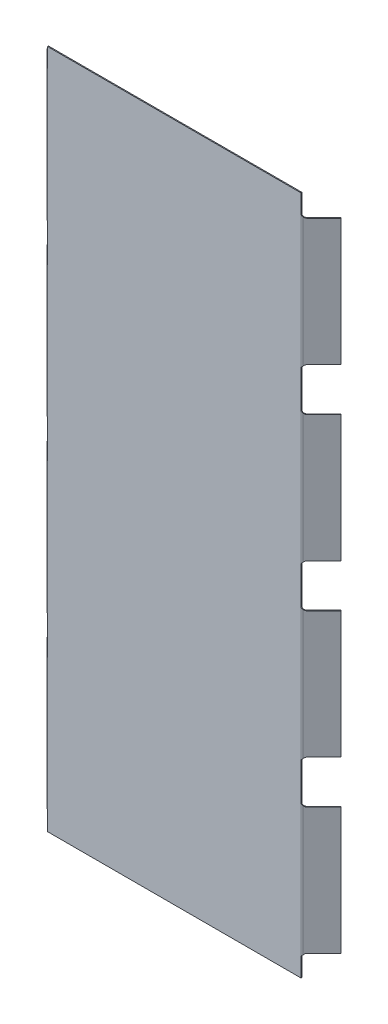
ISO-10303-21;
HEADER;
FILE_DESCRIPTION(('STEP AP214'),'2;1');
FILE_NAME('part.step','',(''),(''),'','','');
FILE_SCHEMA(('AUTOMOTIVE_DESIGN { 1 0 10303 214 1 1 1 1 }'));
ENDSEC;
DATA;
#1=APPLICATION_CONTEXT('core data for automotive mechanical design processes');
#2=APPLICATION_PROTOCOL_DEFINITION('international standard','automotive_design',2000,#1);
#3=PRODUCT_CONTEXT('',#1,'mechanical');
#4=PRODUCT('Part','Part','',(#3));
#5=PRODUCT_RELATED_PRODUCT_CATEGORY('part','',(#4));
#6=PRODUCT_DEFINITION_FORMATION('','',#4);
#7=PRODUCT_DEFINITION_CONTEXT('part definition',#1,'design');
#8=PRODUCT_DEFINITION('design','',#6,#7);
#9=PRODUCT_DEFINITION_SHAPE('','',#8);
#10=(LENGTH_UNIT() NAMED_UNIT(*) SI_UNIT(.MILLI.,.METRE.));
#11=(NAMED_UNIT(*) PLANE_ANGLE_UNIT() SI_UNIT($,.RADIAN.));
#12=(NAMED_UNIT(*) SI_UNIT($,.STERADIAN.) SOLID_ANGLE_UNIT());
#13=UNCERTAINTY_MEASURE_WITH_UNIT(LENGTH_MEASURE(1.E-05),#10,'distance_accuracy_value','');
#14=(GEOMETRIC_REPRESENTATION_CONTEXT(3) GLOBAL_UNCERTAINTY_ASSIGNED_CONTEXT((#13)) GLOBAL_UNIT_ASSIGNED_CONTEXT((#10,
#11,#12)) REPRESENTATION_CONTEXT('',''));
#15=CARTESIAN_POINT('',(0.,0.,0.));
#16=DIRECTION('',(0.,0.,1.));
#17=DIRECTION('',(1.,0.,0.));
#18=AXIS2_PLACEMENT_3D('',#15,#16,#17);
#19=CARTESIAN_POINT('',(454.36984441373,1219.2,-6.83260000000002));
#20=DIRECTION('',(0.,-1.,0.));
#21=DIRECTION('',(0.,0.,-1.));
#22=AXIS2_PLACEMENT_3D('',#19,#20,#21);
#23=CYLINDRICAL_SURFACE('',#22,6.8326);
#24=DIRECTION('',(0.,-1.,0.));
#25=VECTOR('',#24,1.);
#26=CARTESIAN_POINT('',(454.36984441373,1219.2,0.));
#27=LINE('',#26,#25);
#28=CARTESIAN_POINT('',(454.36984441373,-677.8625,0.));
#29=VERTEX_POINT('',#28);
#30=CARTESIAN_POINT('',(454.36984441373,-1150.9375,0.));
#31=VERTEX_POINT('',#30);
#32=EDGE_CURVE('E530',#29,#31,#27,.T.);
#33=ORIENTED_EDGE('',*,*,#32,.T.);
#34=CARTESIAN_POINT('',(459.201222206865,-1146.68774483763,-2.00122220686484));
#35=CARTESIAN_POINT('',(459.036325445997,-1146.85308419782,-1.83631614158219));
#36=CARTESIAN_POINT('',(458.864239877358,-1147.02081032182,-1.68112043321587));
#37=CARTESIAN_POINT('',(458.507810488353,-1147.36024790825,-1.39068420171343));
#38=CARTESIAN_POINT('',(458.32347270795,-1147.53195738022,-1.25543395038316));
#39=CARTESIAN_POINT('',(457.944549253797,-1147.87868510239,-1.00529801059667));
#40=CARTESIAN_POINT('',(457.749966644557,-1148.05370235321,-0.890406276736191));
#41=CARTESIAN_POINT('',(457.352354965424,-1148.40646022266,-0.681217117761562));
#42=CARTESIAN_POINT('',(457.149325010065,-1148.58420112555,-0.586921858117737));
#43=CARTESIAN_POINT('',(456.739542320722,-1148.9394194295,-0.420329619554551));
#44=CARTESIAN_POINT('',(456.532878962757,-1149.1168669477,-0.34774840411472));
#45=CARTESIAN_POINT('',(456.114774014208,-1149.47330449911,-0.222967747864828));
#46=CARTESIAN_POINT('',(455.90333216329,-1149.65229461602,-0.170769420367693));
#47=CARTESIAN_POINT('',(455.472422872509,-1150.01537185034,-0.0858933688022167));
#48=CARTESIAN_POINT('',(455.252882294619,-1150.19948226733,-0.0536868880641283));
#49=CARTESIAN_POINT('',(454.81217027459,-1150.5682265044,-0.0107373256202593));
#50=CARTESIAN_POINT('',(454.590998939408,-1150.75286028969,7.15135721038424E-06));
#51=CARTESIAN_POINT('',(454.36984441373,-1150.9375,0.));
#52=B_SPLINE_CURVE_WITH_KNOTS('',3,(#34,#35,#36,#37,#38,#39,#40,#41,#42,#43,#44,#45,#46,#47,#48,
#49,#50,#51),.UNSPECIFIED.,.F.,.F.,(4,2,2,2,2,2,2,2,4),(0.,0.857241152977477,1.71406280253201,
2.57062959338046,3.42728639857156,4.27218236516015,5.11712447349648,5.98129417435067,
6.84540769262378),.UNSPECIFIED.);
#53=CARTESIAN_POINT('',(459.201222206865,-1146.68774483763,-2.00122220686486));
#54=VERTEX_POINT('',#53);
#55=EDGE_CURVE('E471',#54,#31,#52,.T.);
#56=ORIENTED_EDGE('',*,*,#55,.F.);
#57=DIRECTION('',(0.,-1.,0.));
#58=VECTOR('',#57,1.);
#59=CARTESIAN_POINT('',(459.201222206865,1219.2,-2.00122220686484));
#60=LINE('',#59,#58);
#61=CARTESIAN_POINT('',(459.201222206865,-682.112255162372,-2.00122220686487));
#62=VERTEX_POINT('',#61);
#63=EDGE_CURVE('E525',#62,#54,#60,.T.);
#64=ORIENTED_EDGE('',*,*,#63,.F.);
#65=CARTESIAN_POINT('',(454.36984441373,-677.862500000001,0.));
#66=CARTESIAN_POINT('',(454.591350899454,-678.047415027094,5.1559149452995E-06));
#67=CARTESIAN_POINT('',(454.812857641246,-678.232340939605,-0.0107716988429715));
#68=CARTESIAN_POINT('',(455.2542273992,-678.601676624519,-0.0538507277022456));
#69=CARTESIAN_POINT('',(455.474090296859,-678.786086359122,-0.0861544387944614));
#70=CARTESIAN_POINT('',(455.910512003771,-679.153838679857,-0.17225162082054));
#71=CARTESIAN_POINT('',(456.127070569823,-679.337181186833,-0.226046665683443));
#72=CARTESIAN_POINT('',(456.555152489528,-679.70224053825,-0.355036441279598));
#73=CARTESIAN_POINT('',(456.766675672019,-679.883957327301,-0.430231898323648));
#74=CARTESIAN_POINT('',(457.17768147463,-680.240544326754,-0.599733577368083));
#75=CARTESIAN_POINT('',(457.37733326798,-680.415471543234,-0.69350917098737));
#76=CARTESIAN_POINT('',(457.768457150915,-680.762699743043,-0.901083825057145));
#77=CARTESIAN_POINT('',(457.959927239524,-680.935000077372,-1.01488774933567));
#78=CARTESIAN_POINT('',(458.333616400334,-681.277165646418,-1.2627326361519));
#79=CARTESIAN_POINT('',(458.515790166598,-681.44701650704,-1.39686200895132));
#80=CARTESIAN_POINT('',(458.868057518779,-681.782779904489,-1.68456698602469));
#81=CARTESIAN_POINT('',(459.038149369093,-681.948691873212,-1.83814537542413));
#82=CARTESIAN_POINT('',(459.201222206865,-682.112255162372,-2.00122220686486));
#83=B_SPLINE_CURVE_WITH_KNOTS('',3,(#65,#66,#67,#68,#69,#70,#71,#72,#73,#74,#75,#76,#77,#78,#79,
#80,#81,#82),.UNSPECIFIED.,.F.,.F.,(4,2,2,2,2,2,2,2,4),(0.,0.865448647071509,1.73095909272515,
2.59653293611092,3.46213615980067,4.30587762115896,5.14982426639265,5.9975532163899,
6.84540369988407),.UNSPECIFIED.);
#84=EDGE_CURVE('E727',#29,#62,#83,.T.);
#85=ORIENTED_EDGE('',*,*,#84,.F.);
#86=EDGE_LOOP('',(#33,#56,#64,#85));
#87=FACE_BOUND('',#86,.T.);
#88=ADVANCED_FACE('F36',(#87),#23,.T.);
#89=CARTESIAN_POINT('',(457.2,1219.2,0.));
#90=DIRECTION('',(0.707106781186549,0.,0.707106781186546));
#91=DIRECTION('',(0.707106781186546,0.,-0.707106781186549));
#92=AXIS2_PLACEMENT_3D('',#89,#90,#91);
#93=PLANE('',#92);
#94=CARTESIAN_POINT('',(467.725611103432,-1150.9375,-10.5256111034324));
#95=DIRECTION('',(0.707106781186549,0.,0.707106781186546));
#96=DIRECTION('',(0.707106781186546,0.,-0.707106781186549));
#97=AXIS2_PLACEMENT_3D('',#94,#95,#96);
#98=ELLIPSE('',#97,13.4703841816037,9.525);
#99=CARTESIAN_POINT('',(467.725611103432,-1141.4125,-10.5256111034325));
#100=VERTEX_POINT('',#99);
#101=EDGE_CURVE('E722',#100,#54,#98,.T.);
#102=ORIENTED_EDGE('',*,*,#101,.F.);
#103=DIRECTION('',(-0.707106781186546,0.,0.707106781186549));
#104=VECTOR('',#103,1.);
#105=CARTESIAN_POINT('',(457.2,-1141.4125,0.));
#106=LINE('',#105,#104);
#107=CARTESIAN_POINT('',(527.919516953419,-1141.4125,-70.7195169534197));
#108=VERTEX_POINT('',#107);
#109=EDGE_CURVE('E778',#108,#100,#106,.T.);
#110=ORIENTED_EDGE('',*,*,#109,.F.);
#111=DIRECTION('',(0.,-1.,0.));
#112=VECTOR('',#111,1.);
#113=CARTESIAN_POINT('',(527.919516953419,1219.2,-70.7195169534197));
#114=LINE('',#113,#112);
#115=CARTESIAN_POINT('',(527.919516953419,-687.3875,-70.7195169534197));
#116=VERTEX_POINT('',#115);
#117=EDGE_CURVE('E520',#116,#108,#114,.T.);
#118=ORIENTED_EDGE('',*,*,#117,.F.);
#119=DIRECTION('',(0.707106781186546,0.,-0.707106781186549));
#120=VECTOR('',#119,1.);
#121=CARTESIAN_POINT('',(457.2,-687.3875,0.));
#122=LINE('',#121,#120);
#123=CARTESIAN_POINT('',(467.72561110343,-687.387499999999,-10.5256111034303));
#124=VERTEX_POINT('',#123);
#125=EDGE_CURVE('E580',#124,#116,#122,.T.);
#126=ORIENTED_EDGE('',*,*,#125,.F.);
#127=CARTESIAN_POINT('',(467.72561110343,-677.8625,-10.5256111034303));
#128=DIRECTION('',(0.707106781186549,0.,0.707106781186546));
#129=DIRECTION('',(0.707106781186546,0.,-0.707106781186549));
#130=AXIS2_PLACEMENT_3D('',#127,#128,#129);
#131=ELLIPSE('',#130,13.4703841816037,9.525);
#132=EDGE_CURVE('E724',#62,#124,#131,.T.);
#133=ORIENTED_EDGE('',*,*,#132,.F.);
#134=ORIENTED_EDGE('',*,*,#63,.T.);
#135=EDGE_LOOP('',(#102,#110,#118,#126,#133,#134));
#136=FACE_BOUND('',#135,.T.);
#137=ADVANCED_FACE('F655',(#136),#93,.T.);
#138=CARTESIAN_POINT('',(525.503828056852,1219.2,-73.1352058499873));
#139=DIRECTION('',(0.707106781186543,0.,-0.707106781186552));
#140=DIRECTION('',(-0.707106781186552,0.,-0.707106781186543));
#141=AXIS2_PLACEMENT_3D('',#138,#139,#140);
#142=PLANE('',#141);
#143=ORIENTED_EDGE('',*,*,#117,.T.);
#144=DIRECTION('',(0.707106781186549,0.,0.707106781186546));
#145=VECTOR('',#144,1.);
#146=CARTESIAN_POINT('',(527.919516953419,-1141.4125,-70.7195169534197));
#147=LINE('',#146,#145);
#148=CARTESIAN_POINT('',(525.503828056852,-1141.4125,-73.1352058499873));
#149=VERTEX_POINT('',#148);
#150=EDGE_CURVE('E782',#108,#149,#147,.F.);
#151=ORIENTED_EDGE('',*,*,#150,.T.);
#152=DIRECTION('',(0.,-1.,0.));
#153=VECTOR('',#152,1.);
#154=CARTESIAN_POINT('',(525.503828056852,1219.2,-73.1352058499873));
#155=LINE('',#154,#153);
#156=CARTESIAN_POINT('',(525.503828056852,-687.387499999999,-73.1352058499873));
#157=VERTEX_POINT('',#156);
#158=EDGE_CURVE('E515',#157,#149,#155,.T.);
#159=ORIENTED_EDGE('',*,*,#158,.F.);
#160=DIRECTION('',(0.707106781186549,0.,0.707106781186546));
#161=VECTOR('',#160,1.);
#162=CARTESIAN_POINT('',(527.919516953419,-687.3875,-70.7195169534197));
#163=LINE('',#162,#161);
#164=EDGE_CURVE('E486',#116,#157,#163,.F.);
#165=ORIENTED_EDGE('',*,*,#164,.F.);
#166=EDGE_LOOP('',(#143,#151,#159,#165));
#167=FACE_BOUND('',#166,.T.);
#168=ADVANCED_FACE('F650',(#167),#142,.T.);
#169=CARTESIAN_POINT('',(454.784311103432,1219.2,-2.4156888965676));
#170=DIRECTION('',(0.707106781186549,0.,0.707106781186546));
#171=DIRECTION('',(0.707106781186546,0.,-0.707106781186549));
#172=AXIS2_PLACEMENT_3D('',#169,#170,#171);
#173=PLANE('',#172);
#174=DIRECTION('',(0.707106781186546,0.,-0.707106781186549));
#175=VECTOR('',#174,1.);
#176=CARTESIAN_POINT('',(454.784311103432,-1141.4125,-2.4156888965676));
#177=LINE('',#176,#175);
#178=CARTESIAN_POINT('',(465.309922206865,-1141.4125,-12.9413000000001));
#179=VERTEX_POINT('',#178);
#180=EDGE_CURVE('E779',#149,#179,#177,.F.);
#181=ORIENTED_EDGE('',*,*,#180,.T.);
#182=CARTESIAN_POINT('',(465.309922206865,-1150.9375,-12.9413));
#183=DIRECTION('',(0.707106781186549,0.,0.707106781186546));
#184=DIRECTION('',(0.707106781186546,0.,-0.707106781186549));
#185=AXIS2_PLACEMENT_3D('',#182,#183,#184);
#186=ELLIPSE('',#185,13.4703841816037,9.525);
#187=CARTESIAN_POINT('',(456.785533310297,-1146.68774483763,-4.41691110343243));
#188=VERTEX_POINT('',#187);
#189=EDGE_CURVE('E772',#179,#188,#186,.T.);
#190=ORIENTED_EDGE('',*,*,#189,.T.);
#191=DIRECTION('',(0.,-1.,0.));
#192=VECTOR('',#191,1.);
#193=CARTESIAN_POINT('',(456.785533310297,1219.2,-4.41691110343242));
#194=LINE('',#193,#192);
#195=CARTESIAN_POINT('',(456.785533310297,-682.112255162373,-4.41691110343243));
#196=VERTEX_POINT('',#195);
#197=EDGE_CURVE('E511',#196,#188,#194,.T.);
#198=ORIENTED_EDGE('',*,*,#197,.F.);
#199=CARTESIAN_POINT('',(465.309922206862,-677.8625,-12.9412999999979));
#200=DIRECTION('',(0.707106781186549,0.,0.707106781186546));
#201=DIRECTION('',(0.707106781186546,0.,-0.707106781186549));
#202=AXIS2_PLACEMENT_3D('',#199,#200,#201);
#203=ELLIPSE('',#202,13.4703841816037,9.525);
#204=CARTESIAN_POINT('',(465.309922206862,-687.3875,-12.9412999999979));
#205=VERTEX_POINT('',#204);
#206=EDGE_CURVE('E1432',#196,#205,#203,.T.);
#207=ORIENTED_EDGE('',*,*,#206,.T.);
#208=DIRECTION('',(0.707106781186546,0.,-0.707106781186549));
#209=VECTOR('',#208,1.);
#210=CARTESIAN_POINT('',(454.784311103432,-687.387499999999,-2.4156888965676));
#211=LINE('',#210,#209);
#212=EDGE_CURVE('E579',#205,#157,#211,.T.);
#213=ORIENTED_EDGE('',*,*,#212,.T.);
#214=ORIENTED_EDGE('',*,*,#158,.T.);
#215=EDGE_LOOP('',(#181,#190,#198,#207,#213,#214));
#216=FACE_BOUND('',#215,.T.);
#217=ADVANCED_FACE('F644',(#216),#173,.F.);
#218=CARTESIAN_POINT('',(454.36984441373,1219.2,-6.83260000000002));
#219=DIRECTION('',(0.,-1.,0.));
#220=DIRECTION('',(0.,0.,-1.));
#221=AXIS2_PLACEMENT_3D('',#218,#219,#220);
#222=CYLINDRICAL_SURFACE('',#221,3.4163);
#223=CARTESIAN_POINT('',(456.785533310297,-1146.68774483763,-4.41691110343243));
#224=CARTESIAN_POINT('',(456.727216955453,-1146.80469951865,-4.35860245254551));
#225=CARTESIAN_POINT('',(456.66740897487,-1146.9222313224,-4.30300850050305));
#226=CARTESIAN_POINT('',(456.545174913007,-1147.15830269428,-4.19715204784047));
#227=CARTESIAN_POINT('',(456.482749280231,-1147.27684208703,-4.14688863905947));
#228=CARTESIAN_POINT('',(456.292221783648,-1147.63351445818,-4.00403817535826));
#229=CARTESIAN_POINT('',(456.160721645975,-1147.87299485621,-3.91924556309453));
#230=CARTESIAN_POINT('',(455.896929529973,-1148.34393567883,-3.77304943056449));
#231=CARTESIAN_POINT('',(455.7649200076,-1148.57529267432,-3.71079000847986));
#232=CARTESIAN_POINT('',(455.496578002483,-1149.03976217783,-3.60422092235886));
#233=CARTESIAN_POINT('',(455.360243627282,-1149.27287541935,-3.55991923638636));
#234=CARTESIAN_POINT('',(455.082255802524,-1149.74439173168,-3.48826740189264));
#235=CARTESIAN_POINT('',(454.940550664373,-1149.98281347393,-3.46124267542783));
#236=CARTESIAN_POINT('',(454.655833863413,-1150.45999149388,-3.42527785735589));
#237=CARTESIAN_POINT('',(454.512823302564,-1150.69874736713,-3.41632371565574));
#238=CARTESIAN_POINT('',(454.36984441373,-1150.9375,-3.41630000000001));
#239=B_SPLINE_CURVE_WITH_KNOTS('',3,(#223,#224,#225,#226,#227,#228,#229,#230,#231,#232,#233,
#234,#235,#236,#237,#238),.UNSPECIFIED.,.F.,.F.,(4,2,2,2,2,2,2,4),(0.,0.429234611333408,
0.858395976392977,1.71564486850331,2.53566095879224,3.3560409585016,4.1914503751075,
5.02621000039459),.UNSPECIFIED.);
#240=CARTESIAN_POINT('',(454.36984441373,-1150.9375,-3.41630000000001));
#241=VERTEX_POINT('',#240);
#242=EDGE_CURVE('E732',#188,#241,#239,.T.);
#243=ORIENTED_EDGE('',*,*,#242,.T.);
#244=DIRECTION('',(0.,-1.,0.));
#245=VECTOR('',#244,1.);
#246=CARTESIAN_POINT('',(454.36984441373,1219.2,-3.4163));
#247=LINE('',#246,#245);
#248=CARTESIAN_POINT('',(454.36984441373,-677.862499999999,-3.4163));
#249=VERTEX_POINT('',#248);
#250=EDGE_CURVE('E505',#249,#241,#247,.T.);
#251=ORIENTED_EDGE('',*,*,#250,.F.);
#252=CARTESIAN_POINT('',(454.36984441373,-677.862500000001,-3.41630000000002));
#253=CARTESIAN_POINT('',(454.516485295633,-678.107354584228,-3.41632914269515));
#254=CARTESIAN_POINT('',(454.663147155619,-678.352225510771,-3.42574415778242));
#255=CARTESIAN_POINT('',(454.955056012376,-678.841601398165,-3.46356952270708));
#256=CARTESIAN_POINT('',(455.100301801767,-679.086105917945,-3.49199485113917));
#257=CARTESIAN_POINT('',(455.38149355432,-679.56345105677,-3.56642608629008));
#258=CARTESIAN_POINT('',(455.517570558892,-679.796340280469,-3.6116216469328));
#259=CARTESIAN_POINT('',(455.78533116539,-680.260318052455,-3.71998834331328));
#260=CARTESIAN_POINT('',(455.917016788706,-680.491407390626,-3.78315107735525));
#261=CARTESIAN_POINT('',(456.176870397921,-680.956074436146,-3.92942046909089));
#262=CARTESIAN_POINT('',(456.304909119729,-681.189604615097,-4.01291294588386));
#263=CARTESIAN_POINT('',(456.49045082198,-681.537512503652,-4.15301975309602));
#264=CARTESIAN_POINT('',(456.551246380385,-681.653152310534,-4.20223390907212));
#265=CARTESIAN_POINT('',(456.670341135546,-681.883467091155,-4.30573748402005));
#266=CARTESIAN_POINT('',(456.728639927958,-681.998141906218,-4.3600277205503));
#267=CARTESIAN_POINT('',(456.785533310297,-682.112255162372,-4.41691110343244));
#268=B_SPLINE_CURVE_WITH_KNOTS('',3,(#252,#253,#254,#255,#256,#257,#258,#259,#260,#261,#262,
#263,#264,#265,#266,#267),.UNSPECIFIED.,.F.,.F.,(4,2,2,2,2,2,2,4),(0.,0.856108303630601,
1.71289194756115,2.532755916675,3.35223713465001,4.18868371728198,4.60740788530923,
5.02619961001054),.UNSPECIFIED.);
#269=EDGE_CURVE('E1421',#249,#196,#268,.T.);
#270=ORIENTED_EDGE('',*,*,#269,.T.);
#271=ORIENTED_EDGE('',*,*,#197,.T.);
#272=EDGE_LOOP('',(#243,#251,#270,#271));
#273=FACE_BOUND('',#272,.T.);
#274=ADVANCED_FACE('F638',(#273),#222,.F.);
#275=CARTESIAN_POINT('',(-454.784311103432,1219.2,-2.41568889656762));
#276=DIRECTION('',(-0.707106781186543,0.,0.707106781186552));
#277=DIRECTION('',(0.707106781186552,0.,0.707106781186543));
#278=AXIS2_PLACEMENT_3D('',#275,#276,#277);
#279=PLANE('',#278);
#280=DIRECTION('',(0.707106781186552,0.,0.707106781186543));
#281=VECTOR('',#280,1.);
#282=CARTESIAN_POINT('',(-454.784311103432,-1141.4125,-2.41568889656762));
#283=LINE('',#282,#281);
#284=CARTESIAN_POINT('',(-465.309922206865,-1141.4125,-12.9413000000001));
#285=VERTEX_POINT('',#284);
#286=CARTESIAN_POINT('',(-525.503828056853,-1141.4125,-73.1352058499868));
#287=VERTEX_POINT('',#286);
#288=EDGE_CURVE('E840',#285,#287,#283,.F.);
#289=ORIENTED_EDGE('',*,*,#288,.T.);
#290=DIRECTION('',(0.,-1.,0.));
#291=VECTOR('',#290,1.);
#292=CARTESIAN_POINT('',(-525.503828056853,1219.2,-73.1352058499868));
#293=LINE('',#292,#291);
#294=CARTESIAN_POINT('',(-525.503828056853,-687.3875,-73.1352058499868));
#295=VERTEX_POINT('',#294);
#296=EDGE_CURVE('E552',#295,#287,#293,.T.);
#297=ORIENTED_EDGE('',*,*,#296,.F.);
#298=DIRECTION('',(0.707106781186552,0.,0.707106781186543));
#299=VECTOR('',#298,1.);
#300=CARTESIAN_POINT('',(-454.784311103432,-687.3875,-2.41568889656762));
#301=LINE('',#300,#299);
#302=CARTESIAN_POINT('',(-465.309922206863,-687.3875,-12.9412999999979));
#303=VERTEX_POINT('',#302);
#304=EDGE_CURVE('E1718',#295,#303,#301,.T.);
#305=ORIENTED_EDGE('',*,*,#304,.T.);
#306=CARTESIAN_POINT('',(-465.309922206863,-677.8625,-12.9412999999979));
#307=DIRECTION('',(-0.707106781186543,0.,0.707106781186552));
#308=DIRECTION('',(0.707106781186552,0.,0.707106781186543));
#309=AXIS2_PLACEMENT_3D('',#306,#307,#308);
#310=ELLIPSE('',#309,13.4703841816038,9.525);
#311=CARTESIAN_POINT('',(-456.785533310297,-682.112255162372,-4.41691110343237));
#312=VERTEX_POINT('',#311);
#313=EDGE_CURVE('E1185',#303,#312,#310,.T.);
#314=ORIENTED_EDGE('',*,*,#313,.T.);
#315=DIRECTION('',(0.,-1.,0.));
#316=VECTOR('',#315,1.);
#317=CARTESIAN_POINT('',(-456.785533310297,1219.2,-4.41691110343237));
#318=LINE('',#317,#316);
#319=CARTESIAN_POINT('',(-456.785533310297,-1146.68774483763,-4.41691110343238));
#320=VERTEX_POINT('',#319);
#321=EDGE_CURVE('E502',#312,#320,#318,.T.);
#322=ORIENTED_EDGE('',*,*,#321,.T.);
#323=CARTESIAN_POINT('',(-465.309922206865,-1150.9375,-12.9413));
#324=DIRECTION('',(-0.707106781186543,0.,0.707106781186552));
#325=DIRECTION('',(0.707106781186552,0.,0.707106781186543));
#326=AXIS2_PLACEMENT_3D('',#323,#324,#325);
#327=ELLIPSE('',#326,13.4703841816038,9.525);
#328=EDGE_CURVE('E793',#320,#285,#327,.T.);
#329=ORIENTED_EDGE('',*,*,#328,.T.);
#330=EDGE_LOOP('',(#289,#297,#305,#314,#322,#329));
#331=FACE_BOUND('',#330,.T.);
#332=ADVANCED_FACE('F677',(#331),#279,.F.);
#333=CARTESIAN_POINT('',(-527.91951695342,1219.2,-70.7195169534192));
#334=DIRECTION('',(-0.707106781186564,0.,-0.707106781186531));
#335=DIRECTION('',(-0.707106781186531,0.,0.707106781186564));
#336=AXIS2_PLACEMENT_3D('',#333,#334,#335);
#337=PLANE('',#336);
#338=ORIENTED_EDGE('',*,*,#296,.T.);
#339=DIRECTION('',(-0.707106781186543,0.,0.707106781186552));
#340=VECTOR('',#339,1.);
#341=CARTESIAN_POINT('',(-527.91951695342,-1141.4125,-70.7195169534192));
#342=LINE('',#341,#340);
#343=CARTESIAN_POINT('',(-527.91951695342,-1141.4125,-70.7195169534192));
#344=VERTEX_POINT('',#343);
#345=EDGE_CURVE('E843',#344,#287,#342,.F.);
#346=ORIENTED_EDGE('',*,*,#345,.F.);
#347=DIRECTION('',(0.,-1.,0.));
#348=VECTOR('',#347,1.);
#349=CARTESIAN_POINT('',(-527.91951695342,1219.2,-70.7195169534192));
#350=LINE('',#349,#348);
#351=CARTESIAN_POINT('',(-527.91951695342,-687.3875,-70.7195169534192));
#352=VERTEX_POINT('',#351);
#353=EDGE_CURVE('E546',#352,#344,#350,.T.);
#354=ORIENTED_EDGE('',*,*,#353,.F.);
#355=DIRECTION('',(-0.707106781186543,0.,0.707106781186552));
#356=VECTOR('',#355,1.);
#357=CARTESIAN_POINT('',(-527.91951695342,-687.3875,-70.7195169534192));
#358=LINE('',#357,#356);
#359=EDGE_CURVE('E1717',#352,#295,#358,.F.);
#360=ORIENTED_EDGE('',*,*,#359,.T.);
#361=EDGE_LOOP('',(#338,#346,#354,#360));
#362=FACE_BOUND('',#361,.T.);
#363=ADVANCED_FACE('F671',(#362),#337,.T.);
#364=CARTESIAN_POINT('',(-457.2,1219.2,0.));
#365=DIRECTION('',(-0.707106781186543,0.,0.707106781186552));
#366=DIRECTION('',(0.707106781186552,0.,0.707106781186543));
#367=AXIS2_PLACEMENT_3D('',#364,#365,#366);
#368=PLANE('',#367);
#369=ORIENTED_EDGE('',*,*,#353,.T.);
#370=DIRECTION('',(-0.707106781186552,0.,-0.707106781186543));
#371=VECTOR('',#370,1.);
#372=CARTESIAN_POINT('',(-457.2,-1141.4125,0.));
#373=LINE('',#372,#371);
#374=CARTESIAN_POINT('',(-467.725611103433,-1141.4125,-10.5256111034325));
#375=VERTEX_POINT('',#374);
#376=EDGE_CURVE('E835',#375,#344,#373,.T.);
#377=ORIENTED_EDGE('',*,*,#376,.F.);
#378=CARTESIAN_POINT('',(-467.725611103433,-1150.9375,-10.5256111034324));
#379=DIRECTION('',(-0.707106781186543,0.,0.707106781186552));
#380=DIRECTION('',(0.707106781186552,0.,0.707106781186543));
#381=AXIS2_PLACEMENT_3D('',#378,#379,#380);
#382=ELLIPSE('',#381,13.4703841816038,9.525);
#383=CARTESIAN_POINT('',(-459.201222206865,-1146.68774483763,-2.00122220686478));
#384=VERTEX_POINT('',#383);
#385=EDGE_CURVE('E839',#384,#375,#382,.T.);
#386=ORIENTED_EDGE('',*,*,#385,.F.);
#387=DIRECTION('',(0.,-1.,0.));
#388=VECTOR('',#387,1.);
#389=CARTESIAN_POINT('',(-459.201222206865,1219.2,-2.00122220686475));
#390=LINE('',#389,#388);
#391=CARTESIAN_POINT('',(-459.201222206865,-682.112255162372,-2.00122220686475));
#392=VERTEX_POINT('',#391);
#393=EDGE_CURVE('E540',#392,#384,#390,.T.);
#394=ORIENTED_EDGE('',*,*,#393,.F.);
#395=CARTESIAN_POINT('',(-467.72561110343,-677.8625,-10.5256111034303));
#396=DIRECTION('',(-0.707106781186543,0.,0.707106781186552));
#397=DIRECTION('',(0.707106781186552,0.,0.707106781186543));
#398=AXIS2_PLACEMENT_3D('',#395,#396,#397);
#399=ELLIPSE('',#398,13.4703841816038,9.525);
#400=CARTESIAN_POINT('',(-467.72561110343,-687.3875,-10.5256111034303));
#401=VERTEX_POINT('',#400);
#402=EDGE_CURVE('E1184',#401,#392,#399,.T.);
#403=ORIENTED_EDGE('',*,*,#402,.F.);
#404=DIRECTION('',(0.707106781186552,0.,0.707106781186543));
#405=VECTOR('',#404,1.);
#406=CARTESIAN_POINT('',(-457.2,-687.3875,0.));
#407=LINE('',#406,#405);
#408=EDGE_CURVE('E1724',#352,#401,#407,.T.);
#409=ORIENTED_EDGE('',*,*,#408,.F.);
#410=EDGE_LOOP('',(#369,#377,#386,#394,#403,#409));
#411=FACE_BOUND('',#410,.T.);
#412=ADVANCED_FACE('F665',(#411),#368,.T.);
#413=CARTESIAN_POINT('',(-454.36984441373,1219.2,-6.8326));
#414=DIRECTION('',(0.,-1.,0.));
#415=DIRECTION('',(0.,0.,-1.));
#416=AXIS2_PLACEMENT_3D('',#413,#414,#415);
#417=CYLINDRICAL_SURFACE('',#416,6.8326);
#418=ORIENTED_EDGE('',*,*,#393,.T.);
#419=CARTESIAN_POINT('',(-454.36984441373,-1150.9375,0.));
#420=CARTESIAN_POINT('',(-454.59139905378,-1150.75252601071,6.99240888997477E-06));
#421=CARTESIAN_POINT('',(-454.812969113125,-1150.56755951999,-0.010776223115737));
#422=CARTESIAN_POINT('',(-455.254471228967,-1150.19815138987,-0.0538808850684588));
#423=CARTESIAN_POINT('',(-455.474403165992,-1150.01370978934,-0.0862038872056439));
#424=CARTESIAN_POINT('',(-455.910943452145,-1149.64587489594,-0.172349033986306));
#425=CARTESIAN_POINT('',(-456.127551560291,-1149.46248167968,-0.226172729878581));
#426=CARTESIAN_POINT('',(-456.55572377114,-1149.09731548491,-0.355227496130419));
#427=CARTESIAN_POINT('',(-456.767287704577,-1148.91554256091,-0.430459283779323));
#428=CARTESIAN_POINT('',(-457.178254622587,-1148.5589249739,-0.599994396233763));
#429=CARTESIAN_POINT('',(-457.377830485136,-1148.3840224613,-0.693756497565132));
#430=CARTESIAN_POINT('',(-457.768791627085,-1148.03681734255,-0.901277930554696));
#431=CARTESIAN_POINT('',(-457.960174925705,-1147.86451537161,-1.01504206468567));
#432=CARTESIAN_POINT('',(-458.333743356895,-1147.52242108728,-1.26282685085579));
#433=CARTESIAN_POINT('',(-458.515883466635,-1147.35264346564,-1.39693592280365));
#434=CARTESIAN_POINT('',(-458.868100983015,-1147.01704732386,-1.68460477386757));
#435=CARTESIAN_POINT('',(-459.038176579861,-1146.85122940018,-1.83816746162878));
#436=CARTESIAN_POINT('',(-459.201222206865,-1146.68774483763,-2.00122220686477));
#437=B_SPLINE_CURVE_WITH_KNOTS('',3,(#419,#420,#421,#422,#423,#424,#425,#426,#427,#428,#429,
#430,#431,#432,#433,#434,#435,#436),.UNSPECIFIED.,.F.,.F.,(4,2,2,2,2,2,2,2,4),(0.,
0.865672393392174,1.73140731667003,2.59720471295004,3.46303112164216,4.3065531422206,
5.15027796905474,5.99778066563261,6.84541022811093),.UNSPECIFIED.);
#438=CARTESIAN_POINT('',(-454.36984441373,-1150.9375,0.));
#439=VERTEX_POINT('',#438);
#440=EDGE_CURVE('E788',#439,#384,#437,.T.);
#441=ORIENTED_EDGE('',*,*,#440,.F.);
#442=DIRECTION('',(0.,-1.,0.));
#443=VECTOR('',#442,1.);
#444=CARTESIAN_POINT('',(-454.36984441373,1219.2,0.));
#445=LINE('',#444,#443);
#446=CARTESIAN_POINT('',(-454.36984441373,-677.862500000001,7.98623320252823E-13));
#447=VERTEX_POINT('',#446);
#448=EDGE_CURVE('E535',#447,#439,#445,.T.);
#449=ORIENTED_EDGE('',*,*,#448,.F.);
#450=CARTESIAN_POINT('',(-459.201222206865,-682.112255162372,-2.00122220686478));
#451=CARTESIAN_POINT('',(-459.03632544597,-681.946915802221,-1.83631614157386));
#452=CARTESIAN_POINT('',(-458.86423987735,-681.779189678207,-1.68112043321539));
#453=CARTESIAN_POINT('',(-458.507810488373,-681.439752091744,-1.39068420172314));
#454=CARTESIAN_POINT('',(-458.323472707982,-681.268042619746,-1.25543395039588));
#455=CARTESIAN_POINT('',(-457.944549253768,-680.921314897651,-1.00529801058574));
#456=CARTESIAN_POINT('',(-457.749966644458,-680.746297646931,-0.890406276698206));
#457=CARTESIAN_POINT('',(-457.352354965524,-680.393539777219,-0.681217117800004));
#458=CARTESIAN_POINT('',(-457.149325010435,-680.215798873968,-0.586921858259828));
#459=CARTESIAN_POINT('',(-456.739542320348,-679.860580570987,-0.420329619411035));
#460=CARTESIAN_POINT('',(-456.532878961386,-679.683133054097,-0.347748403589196));
#461=CARTESIAN_POINT('',(-456.114774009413,-679.326695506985,-0.222967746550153));
#462=CARTESIAN_POINT('',(-455.903332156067,-679.147705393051,-0.17076941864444));
#463=CARTESIAN_POINT('',(-455.472422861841,-678.784628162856,-0.0858933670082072));
#464=CARTESIAN_POINT('',(-455.252882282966,-678.600517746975,-0.0536868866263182));
#465=CARTESIAN_POINT('',(-454.812170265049,-678.231773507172,-0.0107373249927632));
#466=CARTESIAN_POINT('',(-454.590998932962,-678.047139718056,7.15152727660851E-06));
#467=CARTESIAN_POINT('',(-454.36984441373,-677.862500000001,1.06512021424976E-12));
#468=B_SPLINE_CURVE_WITH_KNOTS('',3,(#450,#451,#452,#453,#454,#455,#456,#457,#458,#459,#460,
#461,#462,#463,#464,#465,#466,#467),.UNSPECIFIED.,.F.,.F.,(4,2,2,2,2,2,2,2,4),(0.,
0.857241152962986,1.71406280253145,2.57062959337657,3.42728639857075,4.27218236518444,
5.11712447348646,5.98129417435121,6.84540769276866),.UNSPECIFIED.);
#469=EDGE_CURVE('E1137',#392,#447,#468,.T.);
#470=ORIENTED_EDGE('',*,*,#469,.F.);
#471=EDGE_LOOP('',(#418,#441,#449,#470));
#472=FACE_BOUND('',#471,.T.);
#473=ADVANCED_FACE('F625',(#472),#417,.T.);
#474=CARTESIAN_POINT('',(-454.36984441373,1219.2,-6.8326));
#475=DIRECTION('',(0.,-1.,0.));
#476=DIRECTION('',(0.,0.,-1.));
#477=AXIS2_PLACEMENT_3D('',#474,#475,#476);
#478=CYLINDRICAL_SURFACE('',#477,3.4163);
#479=CARTESIAN_POINT('',(-454.36984441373,-1150.9375,-3.4163));
#480=CARTESIAN_POINT('',(-454.516479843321,-1150.69264242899,-3.41632643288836));
#481=CARTESIAN_POINT('',(-454.663150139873,-1150.44777728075,-3.42574319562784));
#482=CARTESIAN_POINT('',(-454.955078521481,-1149.95841330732,-3.46357379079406));
#483=CARTESIAN_POINT('',(-455.100335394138,-1149.71391492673,-3.49200268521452));
#484=CARTESIAN_POINT('',(-455.381525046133,-1149.23656816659,-3.56643543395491));
#485=CARTESIAN_POINT('',(-455.517589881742,-1149.00367180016,-3.61162911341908));
#486=CARTESIAN_POINT('',(-455.785311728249,-1148.53966954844,-3.71998083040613));
#487=CARTESIAN_POINT('',(-455.916970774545,-1148.30856287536,-3.78313044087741));
#488=CARTESIAN_POINT('',(-456.176773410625,-1147.84385435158,-3.92936050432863));
#489=CARTESIAN_POINT('',(-456.304787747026,-1147.61029993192,-4.0128265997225));
#490=CARTESIAN_POINT('',(-456.4903631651,-1147.2624158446,-4.1529509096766));
#491=CARTESIAN_POINT('',(-456.551181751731,-1147.14679394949,-4.20218047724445));
#492=CARTESIAN_POINT('',(-456.670318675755,-1146.91651295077,-4.30571523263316));
#493=CARTESIAN_POINT('',(-456.728636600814,-1146.80185400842,-4.3600212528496));
#494=CARTESIAN_POINT('',(-456.785533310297,-1146.68774483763,-4.41691110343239));
#495=B_SPLINE_CURVE_WITH_KNOTS('',3,(#479,#480,#481,#482,#483,#484,#485,#486,#487,#488,#489,
#490,#491,#492,#493,#494),.UNSPECIFIED.,.F.,.F.,(4,2,2,2,2,2,2,4),(0.,0.856106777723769,
1.71289259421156,2.53275589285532,3.3522350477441,4.18868371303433,4.60740949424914,
5.02620405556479),.UNSPECIFIED.);
#496=CARTESIAN_POINT('',(-454.36984441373,-1150.9375,-3.4163));
#497=VERTEX_POINT('',#496);
#498=EDGE_CURVE('E786',#497,#320,#495,.T.);
#499=ORIENTED_EDGE('',*,*,#498,.T.);
#500=ORIENTED_EDGE('',*,*,#321,.F.);
#501=CARTESIAN_POINT('',(-456.785533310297,-682.112255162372,-4.4169111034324));
#502=CARTESIAN_POINT('',(-456.727216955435,-681.995300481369,-4.35860245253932));
#503=CARTESIAN_POINT('',(-456.667408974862,-681.877768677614,-4.30300850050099));
#504=CARTESIAN_POINT('',(-456.545174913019,-681.641697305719,-4.19715204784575));
#505=CARTESIAN_POINT('',(-456.482749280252,-681.523157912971,-4.14688863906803));
#506=CARTESIAN_POINT('',(-456.29222178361,-681.166485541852,-4.00403817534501));
#507=CARTESIAN_POINT('',(-456.160721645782,-680.927005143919,-3.91924556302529));
#508=CARTESIAN_POINT('',(-455.896929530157,-680.45606432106,-3.77304943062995));
#509=CARTESIAN_POINT('',(-455.764920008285,-680.224707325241,-3.71079000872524));
#510=CARTESIAN_POINT('',(-455.496578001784,-679.760237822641,-3.60422092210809));
#511=CARTESIAN_POINT('',(-455.360243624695,-679.527124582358,-3.55991923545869));
#512=CARTESIAN_POINT('',(-455.082255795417,-679.055608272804,-3.48826740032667));
#513=CARTESIAN_POINT('',(-454.94055065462,-678.817186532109,-3.4612426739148));
#514=CARTESIAN_POINT('',(-454.655833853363,-678.340008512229,-3.42527785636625));
#515=CARTESIAN_POINT('',(-454.512823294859,-678.101252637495,-3.41632371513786));
#516=CARTESIAN_POINT('',(-454.36984441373,-677.862500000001,-3.41629999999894));
#517=B_SPLINE_CURVE_WITH_KNOTS('',3,(#501,#502,#503,#504,#505,#506,#507,#508,#509,#510,#511,
#512,#513,#514,#515,#516),.UNSPECIFIED.,.F.,.F.,(4,2,2,2,2,2,2,4),(0.,0.429234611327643,
0.858395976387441,1.71564486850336,2.53566095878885,3.35604095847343,4.19145037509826,
5.0262100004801),.UNSPECIFIED.);
#518=CARTESIAN_POINT('',(-454.36984441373,-677.8625,-3.4162999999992));
#519=VERTEX_POINT('',#518);
#520=EDGE_CURVE('E1141',#312,#519,#517,.T.);
#521=ORIENTED_EDGE('',*,*,#520,.T.);
#522=DIRECTION('',(0.,-1.,0.));
#523=VECTOR('',#522,1.);
#524=CARTESIAN_POINT('',(-454.36984441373,1219.2,-3.4163));
#525=LINE('',#524,#523);
#526=EDGE_CURVE('E499',#519,#497,#525,.T.);
#527=ORIENTED_EDGE('',*,*,#526,.T.);
#528=EDGE_LOOP('',(#499,#500,#521,#527));
#529=FACE_BOUND('',#528,.T.);
#530=ADVANCED_FACE('F621',(#529),#478,.F.);
#531=CARTESIAN_POINT('',(459.201222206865,1146.68774483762,-2.00122220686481));
#532=VERTEX_POINT('',#531);
#533=CARTESIAN_POINT('',(459.201222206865,682.112255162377,-2.00122220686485));
#534=VERTEX_POINT('',#533);
#535=EDGE_CURVE('E528',#532,#534,#60,.T.);
#536=ORIENTED_EDGE('',*,*,#535,.F.);
#537=CARTESIAN_POINT('',(454.36984441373,1150.9375,0.));
#538=CARTESIAN_POINT('',(454.591350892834,1150.75258496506,5.15608436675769E-06));
#539=CARTESIAN_POINT('',(454.812857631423,1150.5676590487,-0.0107716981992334));
#540=CARTESIAN_POINT('',(455.254227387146,1150.1983233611,-0.0538507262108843));
#541=CARTESIAN_POINT('',(455.47409028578,1150.01391362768,-0.0861544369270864));
#542=CARTESIAN_POINT('',(455.910511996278,1149.64616131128,-0.17225161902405));
#543=CARTESIAN_POINT('',(456.127070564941,1149.46281880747,-0.226046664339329));
#544=CARTESIAN_POINT('',(456.555152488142,1149.09775946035,-0.355036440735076));
#545=CARTESIAN_POINT('',(456.76667567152,1148.91604267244,-0.43023189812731));
#546=CARTESIAN_POINT('',(457.177681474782,1148.55945567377,-0.599733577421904));
#547=CARTESIAN_POINT('',(457.377333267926,1148.38452845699,-0.693509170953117));
#548=CARTESIAN_POINT('',(457.768457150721,1148.03730025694,-0.901083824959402));
#549=CARTESIAN_POINT('',(457.959927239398,1147.86499992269,-1.01488774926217));
#550=CARTESIAN_POINT('',(458.333616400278,1147.52283435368,-1.2627326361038));
#551=CARTESIAN_POINT('',(458.515790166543,1147.35298349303,-1.39686200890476));
#552=CARTESIAN_POINT('',(458.868057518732,1147.01722009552,-1.68456698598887));
#553=CARTESIAN_POINT('',(459.038149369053,1146.85130812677,-1.83814537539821));
#554=CARTESIAN_POINT('',(459.201222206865,1146.68774483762,-2.00122220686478));
#555=B_SPLINE_CURVE_WITH_KNOTS('',3,(#537,#538,#539,#540,#541,#542,#543,#544,#545,#546,#547,
#548,#549,#550,#551,#552,#553,#554),.UNSPECIFIED.,.F.,.F.,(4,2,2,2,2,2,2,2,4),(0.,
0.865448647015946,1.73095909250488,2.59653293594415,3.46213615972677,4.30587762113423,
5.14982426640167,5.99755321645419,6.8454037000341),.UNSPECIFIED.);
#556=CARTESIAN_POINT('',(454.36984441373,1150.9375,0.));
#557=VERTEX_POINT('',#556);
#558=EDGE_CURVE('E849',#557,#532,#555,.T.);
#559=ORIENTED_EDGE('',*,*,#558,.F.);
#560=CARTESIAN_POINT('',(454.36984441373,677.8625,0.));
#561=VERTEX_POINT('',#560);
#562=EDGE_CURVE('E536',#557,#561,#27,.T.);
#563=ORIENTED_EDGE('',*,*,#562,.T.);
#564=CARTESIAN_POINT('',(459.201222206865,682.112255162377,-2.0012222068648));
#565=CARTESIAN_POINT('',(459.03632466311,681.946915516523,-1.83631562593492));
#566=CARTESIAN_POINT('',(458.864239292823,681.779187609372,-1.68112001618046));
#567=CARTESIAN_POINT('',(458.507810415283,681.439746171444,-1.39068408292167));
#568=CARTESIAN_POINT('',(458.323472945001,681.268034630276,-1.25543403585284));
#569=CARTESIAN_POINT('',(457.944548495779,680.921305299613,-1.00529758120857));
#570=CARTESIAN_POINT('',(457.749964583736,680.74628850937,-0.890405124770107));
#571=CARTESIAN_POINT('',(457.352350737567,680.39353083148,-0.681214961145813));
#572=CARTESIAN_POINT('',(457.149319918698,680.215789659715,-0.586919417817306));
#573=CARTESIAN_POINT('',(456.739532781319,679.860576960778,-0.420326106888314));
#574=CARTESIAN_POINT('',(456.532865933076,679.683135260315,-0.347743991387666));
#575=CARTESIAN_POINT('',(456.114756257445,679.326706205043,-0.222962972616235));
#576=CARTESIAN_POINT('',(455.90331317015,679.147718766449,-0.170765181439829));
#577=CARTESIAN_POINT('',(455.472407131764,678.784640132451,-0.0858907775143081));
#578=CARTESIAN_POINT('',(455.252871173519,678.600525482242,-0.0536854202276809));
#579=CARTESIAN_POINT('',(454.812167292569,678.231774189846,-0.0107374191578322));
#580=CARTESIAN_POINT('',(454.590999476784,678.047137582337,6.61846312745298E-06));
#581=CARTESIAN_POINT('',(454.36984441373,677.862499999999,0.));
#582=B_SPLINE_CURVE_WITH_KNOTS('',3,(#564,#565,#566,#567,#568,#569,#570,#571,#572,#573,#574,
#575,#576,#577,#578,#579,#580,#581),.UNSPECIFIED.,.F.,.F.,(4,2,2,2,2,2,2,2,4),(0.,
0.857243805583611,1.71406830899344,2.57063779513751,3.42729722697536,4.27219055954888,
5.11712997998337,5.98129690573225,6.84540770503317),.UNSPECIFIED.);
#583=EDGE_CURVE('E1306',#534,#561,#582,.T.);
#584=ORIENTED_EDGE('',*,*,#583,.F.);
#585=EDGE_LOOP('',(#536,#559,#563,#584));
#586=FACE_BOUND('',#585,.T.);
#587=ADVANCED_FACE('F624',(#586),#23,.T.);
#588=CARTESIAN_POINT('',(527.919516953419,1141.4125,-70.7195169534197));
#589=VERTEX_POINT('',#588);
#590=CARTESIAN_POINT('',(527.919516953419,687.3875,-70.7195169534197));
#591=VERTEX_POINT('',#590);
#592=EDGE_CURVE('E523',#589,#591,#114,.T.);
#593=ORIENTED_EDGE('',*,*,#592,.F.);
#594=DIRECTION('',(0.707106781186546,0.,-0.707106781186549));
#595=VECTOR('',#594,1.);
#596=CARTESIAN_POINT('',(457.2,1141.4125,0.));
#597=LINE('',#596,#595);
#598=CARTESIAN_POINT('',(467.725611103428,1141.4125,-10.5256111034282));
#599=VERTEX_POINT('',#598);
#600=EDGE_CURVE('E891',#599,#589,#597,.T.);
#601=ORIENTED_EDGE('',*,*,#600,.F.);
#602=CARTESIAN_POINT('',(467.725611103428,1150.9375,-10.5256111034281));
#603=DIRECTION('',(0.707106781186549,0.,0.707106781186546));
#604=DIRECTION('',(0.707106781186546,0.,-0.707106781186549));
#605=AXIS2_PLACEMENT_3D('',#602,#603,#604);
#606=ELLIPSE('',#605,13.4703841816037,9.525);
#607=EDGE_CURVE('E895',#532,#599,#606,.T.);
#608=ORIENTED_EDGE('',*,*,#607,.F.);
#609=ORIENTED_EDGE('',*,*,#535,.T.);
#610=CARTESIAN_POINT('',(467.725611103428,677.8625,-10.5256111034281));
#611=DIRECTION('',(0.707106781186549,0.,0.707106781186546));
#612=DIRECTION('',(0.707106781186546,0.,-0.707106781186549));
#613=AXIS2_PLACEMENT_3D('',#610,#611,#612);
#614=ELLIPSE('',#613,13.4703841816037,9.525);
#615=CARTESIAN_POINT('',(467.725611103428,687.3875,-10.5256111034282));
#616=VERTEX_POINT('',#615);
#617=EDGE_CURVE('E1349',#616,#534,#614,.T.);
#618=ORIENTED_EDGE('',*,*,#617,.F.);
#619=DIRECTION('',(-0.707106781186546,0.,0.707106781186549));
#620=VECTOR('',#619,1.);
#621=CARTESIAN_POINT('',(457.2,687.3875,0.));
#622=LINE('',#621,#620);
#623=EDGE_CURVE('E1512',#591,#616,#622,.T.);
#624=ORIENTED_EDGE('',*,*,#623,.F.);
#625=EDGE_LOOP('',(#593,#601,#608,#609,#618,#624));
#626=FACE_BOUND('',#625,.T.);
#627=ADVANCED_FACE('F648',(#626),#93,.T.);
#628=CARTESIAN_POINT('',(525.503828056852,1141.4125,-73.1352058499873));
#629=VERTEX_POINT('',#628);
#630=CARTESIAN_POINT('',(525.503828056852,687.3875,-73.1352058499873));
#631=VERTEX_POINT('',#630);
#632=EDGE_CURVE('E518',#629,#631,#155,.T.);
#633=ORIENTED_EDGE('',*,*,#632,.F.);
#634=DIRECTION('',(0.707106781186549,0.,0.707106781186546));
#635=VECTOR('',#634,1.);
#636=CARTESIAN_POINT('',(527.919516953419,1141.4125,-70.7195169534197));
#637=LINE('',#636,#635);
#638=EDGE_CURVE('E899',#589,#629,#637,.F.);
#639=ORIENTED_EDGE('',*,*,#638,.F.);
#640=ORIENTED_EDGE('',*,*,#592,.T.);
#641=DIRECTION('',(0.707106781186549,0.,0.707106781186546));
#642=VECTOR('',#641,1.);
#643=CARTESIAN_POINT('',(527.919516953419,687.3875,-70.7195169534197));
#644=LINE('',#643,#642);
#645=EDGE_CURVE('E1522',#591,#631,#644,.F.);
#646=ORIENTED_EDGE('',*,*,#645,.T.);
#647=EDGE_LOOP('',(#633,#639,#640,#646));
#648=FACE_BOUND('',#647,.T.);
#649=ADVANCED_FACE('F642',(#648),#142,.T.);
#650=DIRECTION('',(0.707106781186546,0.,-0.707106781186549));
#651=VECTOR('',#650,1.);
#652=CARTESIAN_POINT('',(454.784311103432,1141.4125,-2.4156888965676));
#653=LINE('',#652,#651);
#654=CARTESIAN_POINT('',(465.309922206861,1141.4125,-12.9412999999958));
#655=VERTEX_POINT('',#654);
#656=EDGE_CURVE('E896',#655,#629,#653,.T.);
#657=ORIENTED_EDGE('',*,*,#656,.T.);
#658=ORIENTED_EDGE('',*,*,#632,.T.);
#659=DIRECTION('',(0.707106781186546,0.,-0.707106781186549));
#660=VECTOR('',#659,1.);
#661=CARTESIAN_POINT('',(454.784311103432,687.3875,-2.4156888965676));
#662=LINE('',#661,#660);
#663=CARTESIAN_POINT('',(465.309922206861,687.3875,-12.9412999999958));
#664=VERTEX_POINT('',#663);
#665=EDGE_CURVE('E1503',#631,#664,#662,.F.);
#666=ORIENTED_EDGE('',*,*,#665,.T.);
#667=CARTESIAN_POINT('',(465.309922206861,677.8625,-12.9412999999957));
#668=DIRECTION('',(0.707106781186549,0.,0.707106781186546));
#669=DIRECTION('',(0.707106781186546,0.,-0.707106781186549));
#670=AXIS2_PLACEMENT_3D('',#667,#668,#669);
#671=ELLIPSE('',#670,13.4703841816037,9.525);
#672=CARTESIAN_POINT('',(456.785533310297,682.112255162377,-4.41691110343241));
#673=VERTEX_POINT('',#672);
#674=EDGE_CURVE('E1355',#664,#673,#671,.T.);
#675=ORIENTED_EDGE('',*,*,#674,.T.);
#676=CARTESIAN_POINT('',(456.785533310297,1146.68774483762,-4.41691110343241));
#677=VERTEX_POINT('',#676);
#678=EDGE_CURVE('E513',#677,#673,#194,.T.);
#679=ORIENTED_EDGE('',*,*,#678,.F.);
#680=CARTESIAN_POINT('',(465.309922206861,1150.9375,-12.9412999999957));
#681=DIRECTION('',(0.707106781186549,0.,0.707106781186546));
#682=DIRECTION('',(0.707106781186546,0.,-0.707106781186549));
#683=AXIS2_PLACEMENT_3D('',#680,#681,#682);
#684=ELLIPSE('',#683,13.4703841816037,9.525);
#685=EDGE_CURVE('E848',#677,#655,#684,.T.);
#686=ORIENTED_EDGE('',*,*,#685,.T.);
#687=EDGE_LOOP('',(#657,#658,#666,#675,#679,#686));
#688=FACE_BOUND('',#687,.T.);
#689=ADVANCED_FACE('F636',(#688),#173,.F.);
#690=CARTESIAN_POINT('',(454.36984441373,1150.9375,-3.41630000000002));
#691=CARTESIAN_POINT('',(454.51648528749,1150.69264541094,-3.41632914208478));
#692=CARTESIAN_POINT('',(454.663147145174,1150.447774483,-3.42574415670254));
#693=CARTESIAN_POINT('',(454.955056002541,1149.95839859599,-3.4635695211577));
#694=CARTESIAN_POINT('',(455.100301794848,1149.71389407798,-3.49199484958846));
#695=CARTESIAN_POINT('',(455.381493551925,1149.23654894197,-3.56642608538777));
#696=CARTESIAN_POINT('',(455.517570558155,1149.00365971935,-3.61162164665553));
#697=CARTESIAN_POINT('',(455.785331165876,1148.53968194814,-3.71998834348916));
#698=CARTESIAN_POINT('',(455.917016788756,1148.30859260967,-3.78315107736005));
#699=CARTESIAN_POINT('',(456.176870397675,1147.84392556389,-3.92942046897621));
#700=CARTESIAN_POINT('',(456.304909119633,1147.61039538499,-4.012912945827));
#701=CARTESIAN_POINT('',(456.49045082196,1147.26248749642,-4.15301975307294));
#702=CARTESIAN_POINT('',(456.551246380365,1147.14684768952,-4.20223390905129));
#703=CARTESIAN_POINT('',(456.670341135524,1146.91653290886,-4.30573748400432));
#704=CARTESIAN_POINT('',(456.728639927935,1146.80185809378,-4.36002772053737));
#705=CARTESIAN_POINT('',(456.785533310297,1146.68774483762,-4.4169111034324));
#706=B_SPLINE_CURVE_WITH_KNOTS('',3,(#690,#691,#692,#693,#694,#695,#696,#697,#698,#699,#700,
#701,#702,#703,#704,#705),.UNSPECIFIED.,.F.,.F.,(4,2,2,2,2,2,2,4),(0.,0.856108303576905,
1.71289194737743,2.53275591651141,3.35223713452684,4.18868371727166,4.6074078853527,
5.02619961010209),.UNSPECIFIED.);
#707=CARTESIAN_POINT('',(454.36984441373,1150.9375,-3.4163));
#708=VERTEX_POINT('',#707);
#709=EDGE_CURVE('E846',#708,#677,#706,.T.);
#710=ORIENTED_EDGE('',*,*,#709,.T.);
#711=ORIENTED_EDGE('',*,*,#678,.T.);
#712=CARTESIAN_POINT('',(456.785533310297,682.112255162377,-4.4169111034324));
#713=CARTESIAN_POINT('',(456.727216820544,681.995300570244,-4.35860241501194));
#714=CARTESIAN_POINT('',(456.667409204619,681.87776845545,-4.30300876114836));
#715=CARTESIAN_POINT('',(456.545176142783,681.641696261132,-4.19715305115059));
#716=CARTESIAN_POINT('',(456.482751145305,681.523156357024,-4.14689008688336));
#717=CARTESIAN_POINT('',(456.292224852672,681.166483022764,-4.00404037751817));
#718=CARTESIAN_POINT('',(456.160724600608,680.927002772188,-3.91924751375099));
#719=CARTESIAN_POINT('',(455.896932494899,680.456062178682,-3.77305077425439));
#720=CARTESIAN_POINT('',(455.764923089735,680.224705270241,-3.71079099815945));
#721=CARTESIAN_POINT('',(455.496574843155,679.760239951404,-3.60421990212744));
#722=CARTESIAN_POINT('',(455.360234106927,679.527130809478,-3.55991655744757));
#723=CARTESIAN_POINT('',(455.082242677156,679.055616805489,-3.48826424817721));
#724=CARTESIAN_POINT('',(454.940540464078,678.817193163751,-3.46124076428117));
#725=CARTESIAN_POINT('',(454.655830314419,678.340010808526,-3.42527803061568));
#726=CARTESIAN_POINT('',(454.512823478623,678.101252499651,-3.41632473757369));
#727=CARTESIAN_POINT('',(454.36984441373,677.862499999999,-3.41630000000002));
#728=B_SPLINE_CURVE_WITH_KNOTS('',3,(#712,#713,#714,#715,#716,#717,#718,#719,#720,#721,#722,
#723,#724,#725,#726,#727),.UNSPECIFIED.,.F.,.F.,(4,2,2,2,2,2,2,4),(0.,0.429234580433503,
0.858395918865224,1.71564487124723,2.53566082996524,3.35604059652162,4.1914500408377,
5.02620999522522),.UNSPECIFIED.);
#729=CARTESIAN_POINT('',(454.36984441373,677.8625,-3.41629999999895));
#730=VERTEX_POINT('',#729);
#731=EDGE_CURVE('E1319',#673,#730,#728,.T.);
#732=ORIENTED_EDGE('',*,*,#731,.T.);
#733=EDGE_CURVE('E512',#708,#730,#247,.T.);
#734=ORIENTED_EDGE('',*,*,#733,.F.);
#735=EDGE_LOOP('',(#710,#711,#732,#734));
#736=FACE_BOUND('',#735,.T.);
#737=ADVANCED_FACE('F632',(#736),#222,.F.);
#738=DIRECTION('',(-0.707106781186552,0.,-0.707106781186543));
#739=VECTOR('',#738,1.);
#740=CARTESIAN_POINT('',(-454.784311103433,77.7874999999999,-2.41568889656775));
#741=LINE('',#740,#739);
#742=CARTESIAN_POINT('',(-465.309922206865,77.7874999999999,-12.9413000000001));
#743=VERTEX_POINT('',#742);
#744=CARTESIAN_POINT('',(-525.503828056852,77.7875,-73.1352058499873));
#745=VERTEX_POINT('',#744);
#746=EDGE_CURVE('E964',#743,#745,#741,.T.);
#747=ORIENTED_EDGE('',*,*,#746,.T.);
#748=CARTESIAN_POINT('',(-525.503828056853,531.8125,-73.1352058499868));
#749=VERTEX_POINT('',#748);
#750=EDGE_CURVE('E559',#749,#745,#293,.T.);
#751=ORIENTED_EDGE('',*,*,#750,.F.);
#752=DIRECTION('',(0.707106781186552,0.,0.707106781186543));
#753=VECTOR('',#752,1.);
#754=CARTESIAN_POINT('',(-454.784311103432,531.8125,-2.41568889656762));
#755=LINE('',#754,#753);
#756=CARTESIAN_POINT('',(-465.309922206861,531.8125,-12.9412999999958));
#757=VERTEX_POINT('',#756);
#758=EDGE_CURVE('E2641',#749,#757,#755,.T.);
#759=ORIENTED_EDGE('',*,*,#758,.T.);
#760=CARTESIAN_POINT('',(-465.309922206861,541.3375,-12.9412999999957));
#761=DIRECTION('',(-0.707106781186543,0.,0.707106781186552));
#762=DIRECTION('',(0.707106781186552,0.,0.707106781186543));
#763=AXIS2_PLACEMENT_3D('',#760,#761,#762);
#764=ELLIPSE('',#763,13.4703841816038,9.525);
#765=CARTESIAN_POINT('',(-456.785533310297,537.087744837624,-4.41691110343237));
#766=VERTEX_POINT('',#765);
#767=EDGE_CURVE('E1043',#757,#766,#764,.T.);
#768=ORIENTED_EDGE('',*,*,#767,.T.);
#769=CARTESIAN_POINT('',(-456.785533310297,72.5122551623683,-4.41691110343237));
#770=VERTEX_POINT('',#769);
#771=EDGE_CURVE('E500',#766,#770,#318,.T.);
#772=ORIENTED_EDGE('',*,*,#771,.T.);
#773=CARTESIAN_POINT('',(-465.309922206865,68.2625,-12.9413));
#774=DIRECTION('',(-0.707106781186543,0.,0.707106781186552));
#775=DIRECTION('',(0.707106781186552,0.,0.707106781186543));
#776=AXIS2_PLACEMENT_3D('',#773,#774,#775);
#777=ELLIPSE('',#776,13.4703841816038,9.525);
#778=EDGE_CURVE('E967',#770,#743,#777,.T.);
#779=ORIENTED_EDGE('',*,*,#778,.T.);
#780=EDGE_LOOP('',(#747,#751,#759,#768,#772,#779));
#781=FACE_BOUND('',#780,.T.);
#782=ADVANCED_FACE('F635',(#781),#279,.F.);
#783=CARTESIAN_POINT('',(-465.309922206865,-68.2625,-12.9413));
#784=DIRECTION('',(-0.707106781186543,0.,0.707106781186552));
#785=DIRECTION('',(0.707106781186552,0.,0.707106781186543));
#786=AXIS2_PLACEMENT_3D('',#783,#784,#785);
#787=ELLIPSE('',#786,13.4703841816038,9.525);
#788=CARTESIAN_POINT('',(-465.309922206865,-77.7875,-12.9413000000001));
#789=VERTEX_POINT('',#788);
#790=CARTESIAN_POINT('',(-456.785533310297,-72.5122551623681,-4.41691110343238));
#791=VERTEX_POINT('',#790);
#792=EDGE_CURVE('E955',#789,#791,#787,.T.);
#793=ORIENTED_EDGE('',*,*,#792,.T.);
#794=CARTESIAN_POINT('',(-456.785533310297,-537.087744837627,-4.41691110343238));
#795=VERTEX_POINT('',#794);
#796=EDGE_CURVE('E501',#791,#795,#318,.T.);
#797=ORIENTED_EDGE('',*,*,#796,.T.);
#798=CARTESIAN_POINT('',(-465.309922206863,-541.3375,-12.9412999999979));
#799=DIRECTION('',(-0.707106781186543,0.,0.707106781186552));
#800=DIRECTION('',(0.707106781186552,0.,0.707106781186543));
#801=AXIS2_PLACEMENT_3D('',#798,#799,#800);
#802=ELLIPSE('',#801,13.4703841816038,9.525);
#803=CARTESIAN_POINT('',(-465.309922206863,-531.8125,-12.9412999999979));
#804=VERTEX_POINT('',#803);
#805=EDGE_CURVE('E1145',#795,#804,#802,.T.);
#806=ORIENTED_EDGE('',*,*,#805,.T.);
#807=DIRECTION('',(0.707106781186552,0.,0.707106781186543));
#808=VECTOR('',#807,1.);
#809=CARTESIAN_POINT('',(-454.784311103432,-531.8125,-2.41568889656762));
#810=LINE('',#809,#808);
#811=CARTESIAN_POINT('',(-525.503828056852,-531.8125,-73.1352058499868));
#812=VERTEX_POINT('',#811);
#813=EDGE_CURVE('E1720',#804,#812,#810,.F.);
#814=ORIENTED_EDGE('',*,*,#813,.T.);
#815=CARTESIAN_POINT('',(-525.503828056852,-77.7875,-73.1352058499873));
#816=VERTEX_POINT('',#815);
#817=EDGE_CURVE('E560',#816,#812,#293,.T.);
#818=ORIENTED_EDGE('',*,*,#817,.F.);
#819=DIRECTION('',(0.707106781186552,0.,0.707106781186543));
#820=VECTOR('',#819,1.);
#821=CARTESIAN_POINT('',(-454.784311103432,-77.7874999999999,-2.41568889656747));
#822=LINE('',#821,#820);
#823=EDGE_CURVE('E915',#816,#789,#822,.T.);
#824=ORIENTED_EDGE('',*,*,#823,.T.);
#825=EDGE_LOOP('',(#793,#797,#806,#814,#818,#824));
#826=FACE_BOUND('',#825,.T.);
#827=ADVANCED_FACE('F2390',(#826),#279,.F.);
#828=ORIENTED_EDGE('',*,*,#750,.T.);
#829=DIRECTION('',(0.707106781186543,0.,-0.707106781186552));
#830=VECTOR('',#829,1.);
#831=CARTESIAN_POINT('',(-525.503828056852,77.7875,-73.1352058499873));
#832=LINE('',#831,#830);
#833=CARTESIAN_POINT('',(-527.91951695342,77.7874999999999,-70.7195169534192));
#834=VERTEX_POINT('',#833);
#835=EDGE_CURVE('E1039',#745,#834,#832,.F.);
#836=ORIENTED_EDGE('',*,*,#835,.T.);
#837=CARTESIAN_POINT('',(-527.91951695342,531.8125,-70.7195169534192));
#838=VERTEX_POINT('',#837);
#839=EDGE_CURVE('E553',#838,#834,#350,.T.);
#840=ORIENTED_EDGE('',*,*,#839,.F.);
#841=DIRECTION('',(-0.707106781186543,0.,0.707106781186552));
#842=VECTOR('',#841,1.);
#843=CARTESIAN_POINT('',(-527.91951695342,531.8125,-70.7195169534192));
#844=LINE('',#843,#842);
#845=EDGE_CURVE('E1713',#838,#749,#844,.F.);
#846=ORIENTED_EDGE('',*,*,#845,.T.);
#847=EDGE_LOOP('',(#828,#836,#840,#846));
#848=FACE_BOUND('',#847,.T.);
#849=ADVANCED_FACE('F679',(#848),#337,.T.);
#850=CARTESIAN_POINT('',(-527.91951695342,-77.7874999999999,-70.7195169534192));
#851=VERTEX_POINT('',#850);
#852=CARTESIAN_POINT('',(-527.91951695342,-531.8125,-70.7195169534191));
#853=VERTEX_POINT('',#852);
#854=EDGE_CURVE('E554',#851,#853,#350,.T.);
#855=ORIENTED_EDGE('',*,*,#854,.F.);
#856=DIRECTION('',(0.707106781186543,0.,-0.707106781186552));
#857=VECTOR('',#856,1.);
#858=CARTESIAN_POINT('',(-525.503828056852,-77.7875,-73.1352058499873));
#859=LINE('',#858,#857);
#860=EDGE_CURVE('E958',#816,#851,#859,.F.);
#861=ORIENTED_EDGE('',*,*,#860,.F.);
#862=ORIENTED_EDGE('',*,*,#817,.T.);
#863=DIRECTION('',(-0.707106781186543,0.,0.707106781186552));
#864=VECTOR('',#863,1.);
#865=CARTESIAN_POINT('',(-527.91951695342,-531.8125,-70.7195169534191));
#866=LINE('',#865,#864);
#867=EDGE_CURVE('E1257',#853,#812,#866,.F.);
#868=ORIENTED_EDGE('',*,*,#867,.F.);
#869=EDGE_LOOP('',(#855,#861,#862,#868));
#870=FACE_BOUND('',#869,.T.);
#871=ADVANCED_FACE('F2405',(#870),#337,.T.);
#872=ORIENTED_EDGE('',*,*,#839,.T.);
#873=DIRECTION('',(0.707106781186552,0.,0.707106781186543));
#874=VECTOR('',#873,1.);
#875=CARTESIAN_POINT('',(-457.2,77.7874999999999,0.));
#876=LINE('',#875,#874);
#877=CARTESIAN_POINT('',(-467.725611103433,77.7874999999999,-10.5256111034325));
#878=VERTEX_POINT('',#877);
#879=EDGE_CURVE('E954',#878,#834,#876,.F.);
#880=ORIENTED_EDGE('',*,*,#879,.F.);
#881=CARTESIAN_POINT('',(-467.725611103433,68.2625,-10.5256111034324));
#882=DIRECTION('',(-0.707106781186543,0.,0.707106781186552));
#883=DIRECTION('',(0.707106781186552,0.,0.707106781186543));
#884=AXIS2_PLACEMENT_3D('',#881,#882,#883);
#885=ELLIPSE('',#884,13.4703841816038,9.525);
#886=CARTESIAN_POINT('',(-459.201222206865,72.5122551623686,-2.00122220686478));
#887=VERTEX_POINT('',#886);
#888=EDGE_CURVE('E959',#887,#878,#885,.T.);
#889=ORIENTED_EDGE('',*,*,#888,.F.);
#890=CARTESIAN_POINT('',(-459.201222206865,537.087744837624,-2.00122220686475));
#891=VERTEX_POINT('',#890);
#892=EDGE_CURVE('E547',#891,#887,#390,.T.);
#893=ORIENTED_EDGE('',*,*,#892,.F.);
#894=CARTESIAN_POINT('',(-467.725611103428,541.3375,-10.5256111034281));
#895=DIRECTION('',(-0.707106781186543,0.,0.707106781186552));
#896=DIRECTION('',(0.707106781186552,0.,0.707106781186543));
#897=AXIS2_PLACEMENT_3D('',#894,#895,#896);
#898=ELLIPSE('',#897,13.4703841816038,9.525);
#899=CARTESIAN_POINT('',(-467.725611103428,531.8125,-10.5256111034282));
#900=VERTEX_POINT('',#899);
#901=EDGE_CURVE('E1042',#900,#891,#898,.T.);
#902=ORIENTED_EDGE('',*,*,#901,.F.);
#903=DIRECTION('',(0.707106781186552,0.,0.707106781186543));
#904=VECTOR('',#903,1.);
#905=CARTESIAN_POINT('',(-457.2,531.8125,0.));
#906=LINE('',#905,#904);
#907=EDGE_CURVE('E2644',#838,#900,#906,.T.);
#908=ORIENTED_EDGE('',*,*,#907,.F.);
#909=EDGE_LOOP('',(#872,#880,#889,#893,#902,#908));
#910=FACE_BOUND('',#909,.T.);
#911=ADVANCED_FACE('F673',(#910),#368,.T.);
#912=CARTESIAN_POINT('',(-459.201222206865,-72.5122551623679,-2.00122220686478));
#913=VERTEX_POINT('',#912);
#914=CARTESIAN_POINT('',(-459.201222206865,-537.087744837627,-2.00122220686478));
#915=VERTEX_POINT('',#914);
#916=EDGE_CURVE('E548',#913,#915,#390,.T.);
#917=ORIENTED_EDGE('',*,*,#916,.F.);
#918=CARTESIAN_POINT('',(-467.725611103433,-68.2625,-10.5256111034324));
#919=DIRECTION('',(-0.707106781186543,0.,0.707106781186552));
#920=DIRECTION('',(0.707106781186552,0.,0.707106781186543));
#921=AXIS2_PLACEMENT_3D('',#918,#919,#920);
#922=ELLIPSE('',#921,13.4703841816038,9.525);
#923=CARTESIAN_POINT('',(-467.725611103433,-77.7874999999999,-10.5256111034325));
#924=VERTEX_POINT('',#923);
#925=EDGE_CURVE('E956',#924,#913,#922,.T.);
#926=ORIENTED_EDGE('',*,*,#925,.F.);
#927=DIRECTION('',(0.707106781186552,0.,0.707106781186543));
#928=VECTOR('',#927,1.);
#929=CARTESIAN_POINT('',(-457.2,-77.7874999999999,0.));
#930=LINE('',#929,#928);
#931=EDGE_CURVE('E952',#851,#924,#930,.T.);
#932=ORIENTED_EDGE('',*,*,#931,.F.);
#933=ORIENTED_EDGE('',*,*,#854,.T.);
#934=DIRECTION('',(-0.707106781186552,0.,-0.707106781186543));
#935=VECTOR('',#934,1.);
#936=CARTESIAN_POINT('',(-457.2,-531.8125,0.));
#937=LINE('',#936,#935);
#938=CARTESIAN_POINT('',(-467.72561110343,-531.8125,-10.5256111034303));
#939=VERTEX_POINT('',#938);
#940=EDGE_CURVE('E1729',#939,#853,#937,.T.);
#941=ORIENTED_EDGE('',*,*,#940,.F.);
#942=CARTESIAN_POINT('',(-467.72561110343,-541.3375,-10.5256111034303));
#943=DIRECTION('',(-0.707106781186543,0.,0.707106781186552));
#944=DIRECTION('',(0.707106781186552,0.,0.707106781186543));
#945=AXIS2_PLACEMENT_3D('',#942,#943,#944);
#946=ELLIPSE('',#945,13.4703841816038,9.525);
#947=EDGE_CURVE('E1182',#915,#939,#946,.T.);
#948=ORIENTED_EDGE('',*,*,#947,.F.);
#949=EDGE_LOOP('',(#917,#926,#932,#933,#941,#948));
#950=FACE_BOUND('',#949,.T.);
#951=ADVANCED_FACE('F1695',(#950),#368,.T.);
#952=ORIENTED_EDGE('',*,*,#892,.T.);
#953=CARTESIAN_POINT('',(-454.36984441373,68.2624999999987,0.));
#954=CARTESIAN_POINT('',(-454.591350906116,68.4474150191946,5.15574444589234E-06));
#955=CARTESIAN_POINT('',(-454.812857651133,68.6323409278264,-0.0107716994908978));
#956=CARTESIAN_POINT('',(-455.254227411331,69.0016766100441,-0.0538507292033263));
#957=CARTESIAN_POINT('',(-455.474090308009,69.1860863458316,-0.0861544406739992));
#958=CARTESIAN_POINT('',(-455.910512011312,69.5538386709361,-0.172251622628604));
#959=CARTESIAN_POINT('',(-456.127070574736,69.7371811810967,-0.226046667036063));
#960=CARTESIAN_POINT('',(-456.55515249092,70.1022405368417,-0.35503644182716));
#961=CARTESIAN_POINT('',(-456.76667567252,70.2839573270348,-0.430231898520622));
#962=CARTESIAN_POINT('',(-457.177681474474,70.6405443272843,-0.599733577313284));
#963=CARTESIAN_POINT('',(-457.377333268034,70.8154715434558,-0.693509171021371));
#964=CARTESIAN_POINT('',(-457.76845715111,71.162699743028,-0.901083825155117));
#965=CARTESIAN_POINT('',(-457.959927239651,71.3350000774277,-1.01488774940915));
#966=CARTESIAN_POINT('',(-458.33361640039,71.6771656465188,-1.2627326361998));
#967=CARTESIAN_POINT('',(-458.515790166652,71.8470165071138,-1.39686200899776));
#968=CARTESIAN_POINT('',(-458.868057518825,72.1827799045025,-1.68456698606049));
#969=CARTESIAN_POINT('',(-459.038149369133,72.3486918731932,-1.83814537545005));
#970=CARTESIAN_POINT('',(-459.201222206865,72.5122551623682,-2.00122220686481));
#971=B_SPLINE_CURVE_WITH_KNOTS('',3,(#953,#954,#955,#956,#957,#958,#959,#960,#961,#962,#963,
#964,#965,#966,#967,#968,#969,#970),.UNSPECIFIED.,.F.,.F.,(4,2,2,2,2,2,2,2,4),(0.,
0.865448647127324,1.73095909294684,2.59653293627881,3.46213615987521,4.30587762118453,
5.14982426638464,5.99755321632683,6.84540369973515),.UNSPECIFIED.);
#972=CARTESIAN_POINT('',(-454.36984441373,68.2624999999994,0.));
#973=VERTEX_POINT('',#972);
#974=EDGE_CURVE('E906',#973,#887,#971,.T.);
#975=ORIENTED_EDGE('',*,*,#974,.F.);
#976=CARTESIAN_POINT('',(-454.36984441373,541.3375,1.59681295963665E-12));
#977=VERTEX_POINT('',#976);
#978=EDGE_CURVE('E1642',#977,#973,#445,.T.);
#979=ORIENTED_EDGE('',*,*,#978,.F.);
#980=CARTESIAN_POINT('',(-459.201222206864,537.087744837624,-2.00122220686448));
#981=CARTESIAN_POINT('',(-459.03632466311,537.253084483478,-1.83631562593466));
#982=CARTESIAN_POINT('',(-458.864239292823,537.420812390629,-1.68112001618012));
#983=CARTESIAN_POINT('',(-458.507810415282,537.760253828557,-1.39068408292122));
#984=CARTESIAN_POINT('',(-458.323472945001,537.931965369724,-1.25543403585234));
#985=CARTESIAN_POINT('',(-457.944548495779,538.278694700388,-1.00529758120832));
#986=CARTESIAN_POINT('',(-457.749964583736,538.453711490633,-0.890405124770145));
#987=CARTESIAN_POINT('',(-457.352350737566,538.806469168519,-0.681214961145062));
#988=CARTESIAN_POINT('',(-457.149319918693,538.984210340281,-0.586919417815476));
#989=CARTESIAN_POINT('',(-456.739532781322,539.339423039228,-0.420326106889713));
#990=CARTESIAN_POINT('',(-456.53286593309,539.516864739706,-0.347743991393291));
#991=CARTESIAN_POINT('',(-456.114756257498,539.873293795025,-0.222962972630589));
#992=CARTESIAN_POINT('',(-455.903313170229,540.052281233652,-0.170765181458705));
#993=CARTESIAN_POINT('',(-455.472407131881,540.415359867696,-0.0858907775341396));
#994=CARTESIAN_POINT('',(-455.252871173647,540.599474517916,-0.0536854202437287));
#995=CARTESIAN_POINT('',(-454.812167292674,540.968225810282,-0.0107374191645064));
#996=CARTESIAN_POINT('',(-454.590999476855,541.152862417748,6.61846207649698E-06));
#997=CARTESIAN_POINT('',(-454.36984441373,541.3375,2.12937306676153E-12));
#998=B_SPLINE_CURVE_WITH_KNOTS('',3,(#980,#981,#982,#983,#984,#985,#986,#987,#988,#989,#990,
#991,#992,#993,#994,#995,#996,#997),.UNSPECIFIED.,.F.,.F.,(4,2,2,2,2,2,2,2,4),(0.,
0.857243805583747,1.7140683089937,2.57063779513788,3.42729722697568,4.27219055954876,
5.11712997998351,5.98129690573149,6.84540770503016),.UNSPECIFIED.);
#999=EDGE_CURVE('E997',#891,#977,#998,.T.);
#1000=ORIENTED_EDGE('',*,*,#999,.F.);
#1001=EDGE_LOOP('',(#952,#975,#979,#1000));
#1002=FACE_BOUND('',#1001,.T.);
#1003=ADVANCED_FACE('F667',(#1002),#417,.T.);
#1004=CARTESIAN_POINT('',(-454.36984441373,-68.2625000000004,0.));
#1005=VERTEX_POINT('',#1004);
#1006=CARTESIAN_POINT('',(-454.36984441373,-541.3375,0.));
#1007=VERTEX_POINT('',#1006);
#1008=EDGE_CURVE('E542',#1005,#1007,#445,.T.);
#1009=ORIENTED_EDGE('',*,*,#1008,.F.);
#1010=CARTESIAN_POINT('',(-459.201222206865,-72.5122551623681,-2.00122220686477));
#1011=CARTESIAN_POINT('',(-459.036324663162,-72.3469155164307,-1.83631562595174));
#1012=CARTESIAN_POINT('',(-458.864239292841,-72.1791876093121,-1.6811200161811));
#1013=CARTESIAN_POINT('',(-458.507810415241,-71.8397461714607,-1.39068408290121));
#1014=CARTESIAN_POINT('',(-458.323472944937,-71.6680346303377,-1.25543403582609));
#1015=CARTESIAN_POINT('',(-457.944548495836,-71.3213052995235,-1.00529758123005));
#1016=CARTESIAN_POINT('',(-457.749964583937,-71.146288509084,-0.890405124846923));
#1017=CARTESIAN_POINT('',(-457.352350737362,-70.7935308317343,-0.681214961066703));
#1018=CARTESIAN_POINT('',(-457.14931991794,-70.615789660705,-0.586919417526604));
#1019=CARTESIAN_POINT('',(-456.739532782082,-70.2605769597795,-0.420326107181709));
#1020=CARTESIAN_POINT('',(-456.532865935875,-70.0831352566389,-0.347743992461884));
#1021=CARTESIAN_POINT('',(-456.114756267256,-69.7267061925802,-0.222962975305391));
#1022=CARTESIAN_POINT('',(-455.903313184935,-69.5477187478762,-0.170765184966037));
#1023=CARTESIAN_POINT('',(-455.472407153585,-69.1846401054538,-0.0858907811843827));
#1024=CARTESIAN_POINT('',(-455.252871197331,-69.0005254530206,-0.0536854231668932));
#1025=CARTESIAN_POINT('',(-454.812167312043,-68.6317741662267,-0.010737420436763));
#1026=CARTESIAN_POINT('',(-454.590999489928,-68.4471375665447,6.61812042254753E-06));
#1027=CARTESIAN_POINT('',(-454.36984441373,-68.2625000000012,0.));
#1028=B_SPLINE_CURVE_WITH_KNOTS('',3,(#1010,#1011,#1012,#1013,#1014,#1015,#1016,#1017,#1018,
#1019,#1020,#1021,#1022,#1023,#1024,#1025,#1026,#1027),.UNSPECIFIED.,.F.,.F.,(4,2,2,2,2,2,2,2,
4),(0.,0.857243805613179,1.71406830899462,2.57063779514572,3.42729722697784,4.27219055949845,
5.11712998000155,5.98129690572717,6.84540770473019),.UNSPECIFIED.);
#1029=EDGE_CURVE('E910',#913,#1005,#1028,.T.);
#1030=ORIENTED_EDGE('',*,*,#1029,.F.);
#1031=ORIENTED_EDGE('',*,*,#916,.T.);
#1032=CARTESIAN_POINT('',(-454.36984441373,-541.337500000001,1.59768032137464E-12));
#1033=CARTESIAN_POINT('',(-454.591399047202,-541.15252600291,6.99257917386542E-06));
#1034=CARTESIAN_POINT('',(-454.812969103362,-540.967559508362,-0.0107762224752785));
#1035=CARTESIAN_POINT('',(-455.254471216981,-540.598151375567,-0.0538808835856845));
#1036=CARTESIAN_POINT('',(-455.474403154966,-540.413709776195,-0.0862038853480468));
#1037=CARTESIAN_POINT('',(-455.910943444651,-540.045874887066,-0.172349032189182));
#1038=CARTESIAN_POINT('',(-456.127551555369,-539.862481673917,-0.226172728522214));
#1039=CARTESIAN_POINT('',(-456.555723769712,-539.497315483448,-0.355227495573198));
#1040=CARTESIAN_POINT('',(-456.767287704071,-539.315542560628,-0.43045928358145));
#1041=CARTESIAN_POINT('',(-457.178254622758,-538.958924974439,-0.599994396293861));
#1042=CARTESIAN_POINT('',(-457.377830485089,-538.784022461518,-0.693756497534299));
#1043=CARTESIAN_POINT('',(-457.768791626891,-538.436817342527,-0.901277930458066));
#1044=CARTESIAN_POINT('',(-457.96017492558,-538.264515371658,-1.01504206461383));
#1045=CARTESIAN_POINT('',(-458.333743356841,-537.92242108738,-1.26282685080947));
#1046=CARTESIAN_POINT('',(-458.515883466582,-537.752643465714,-1.39693592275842));
#1047=CARTESIAN_POINT('',(-458.868100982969,-537.417047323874,-1.68460477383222));
#1048=CARTESIAN_POINT('',(-459.038176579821,-537.251229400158,-1.83816746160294));
#1049=CARTESIAN_POINT('',(-459.201222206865,-537.087744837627,-2.00122220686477));
#1050=B_SPLINE_CURVE_WITH_KNOTS('',3,(#1032,#1033,#1034,#1035,#1036,#1037,#1038,#1039,#1040,
#1041,#1042,#1043,#1044,#1045,#1046,#1047,#1048,#1049),.UNSPECIFIED.,.F.,.F.,(4,2,2,2,2,2,2,2,
4),(0.,0.865672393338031,1.73140731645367,2.5972047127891,3.46303112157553,4.30655314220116,
5.15027796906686,5.9977806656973,6.84541022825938),.UNSPECIFIED.);
#1051=EDGE_CURVE('E1138',#1007,#915,#1050,.T.);
#1052=ORIENTED_EDGE('',*,*,#1051,.F.);
#1053=EDGE_LOOP('',(#1009,#1030,#1031,#1052));
#1054=FACE_BOUND('',#1053,.T.);
#1055=ADVANCED_FACE('F2435',(#1054),#417,.T.);
#1056=CARTESIAN_POINT('',(-454.36984441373,68.2624999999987,-3.4163));
#1057=CARTESIAN_POINT('',(-454.51648530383,68.5073545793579,-3.41632914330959));
#1058=CARTESIAN_POINT('',(-454.663147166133,68.7522255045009,-3.42574415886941));
#1059=CARTESIAN_POINT('',(-454.955056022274,69.2416013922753,-3.4635695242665));
#1060=CARTESIAN_POINT('',(-455.100301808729,69.4861059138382,-3.4919948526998));
#1061=CARTESIAN_POINT('',(-455.381493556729,69.9634510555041,-3.56642608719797));
#1062=CARTESIAN_POINT('',(-455.517570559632,70.1963402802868,-3.61162164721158));
#1063=CARTESIAN_POINT('',(-455.7853311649,70.6603180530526,-3.71998834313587));
#1064=CARTESIAN_POINT('',(-455.917016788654,70.891407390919,-3.78315107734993));
#1065=CARTESIAN_POINT('',(-456.176870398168,71.3560744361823,-3.92942046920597));
#1066=CARTESIAN_POINT('',(-456.304909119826,71.5896046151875,-4.01291294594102));
#1067=CARTESIAN_POINT('',(-456.490450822,71.9375125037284,-4.15301975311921));
#1068=CARTESIAN_POINT('',(-456.551246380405,72.0531523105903,-4.20223390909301));
#1069=CARTESIAN_POINT('',(-456.670341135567,72.2834670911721,-4.30573748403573));
#1070=CARTESIAN_POINT('',(-456.728639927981,72.3981419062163,-4.36002772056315));
#1071=CARTESIAN_POINT('',(-456.785533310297,72.5122551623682,-4.4169111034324));
#1072=B_SPLINE_CURVE_WITH_KNOTS('',3,(#1056,#1057,#1058,#1059,#1060,#1061,#1062,#1063,#1064,
#1065,#1066,#1067,#1068,#1069,#1070,#1071),.UNSPECIFIED.,.F.,.F.,(4,2,2,2,2,2,2,4),(0.,
0.856108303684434,1.71289194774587,2.53275591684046,3.35223713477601,4.18868371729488,
4.60740788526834,5.02619960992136),.UNSPECIFIED.);
#1073=CARTESIAN_POINT('',(-454.36984441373,68.2625000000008,-3.4163));
#1074=VERTEX_POINT('',#1073);
#1075=EDGE_CURVE('E911',#1074,#770,#1072,.T.);
#1076=ORIENTED_EDGE('',*,*,#1075,.T.);
#1077=ORIENTED_EDGE('',*,*,#771,.F.);
#1078=CARTESIAN_POINT('',(-456.785533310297,537.087744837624,-4.41691110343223));
#1079=CARTESIAN_POINT('',(-456.727216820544,537.204699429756,-4.3586024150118));
#1080=CARTESIAN_POINT('',(-456.667409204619,537.322231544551,-4.30300876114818));
#1081=CARTESIAN_POINT('',(-456.545176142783,537.558303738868,-4.19715305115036));
#1082=CARTESIAN_POINT('',(-456.482751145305,537.676843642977,-4.14689008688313));
#1083=CARTESIAN_POINT('',(-456.292224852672,538.033516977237,-4.00404037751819));
#1084=CARTESIAN_POINT('',(-456.16072460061,538.272997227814,-3.91924751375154));
#1085=CARTESIAN_POINT('',(-455.896932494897,538.743937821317,-3.77305077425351));
#1086=CARTESIAN_POINT('',(-455.764923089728,538.975294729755,-3.71079099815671));
#1087=CARTESIAN_POINT('',(-455.496574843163,539.439760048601,-3.60421990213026));
#1088=CARTESIAN_POINT('',(-455.360234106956,539.672869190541,-3.55991655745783));
#1089=CARTESIAN_POINT('',(-455.082242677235,540.144383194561,-3.48826424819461));
#1090=CARTESIAN_POINT('',(-454.940540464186,540.382806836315,-3.46124076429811));
#1091=CARTESIAN_POINT('',(-454.65583031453,540.85998919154,-3.42527803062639));
#1092=CARTESIAN_POINT('',(-454.512823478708,541.098747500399,-3.41632473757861));
#1093=CARTESIAN_POINT('',(-454.36984441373,541.3375,-3.41629999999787));
#1094=B_SPLINE_CURVE_WITH_KNOTS('',3,(#1078,#1079,#1080,#1081,#1082,#1083,#1084,#1085,#1086,
#1087,#1088,#1089,#1090,#1091,#1092,#1093),.UNSPECIFIED.,.F.,.F.,(4,2,2,2,2,2,2,4),(0.,
0.429234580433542,0.858395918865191,1.71564487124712,2.53566082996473,3.35604059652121,
4.1914500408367,5.02620999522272),.UNSPECIFIED.);
#1095=CARTESIAN_POINT('',(-454.36984441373,541.3375,-3.4162999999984));
#1096=VERTEX_POINT('',#1095);
#1097=EDGE_CURVE('E1010',#766,#1096,#1094,.T.);
#1098=ORIENTED_EDGE('',*,*,#1097,.T.);
#1099=EDGE_CURVE('E1613',#1096,#1074,#525,.T.);
#1100=ORIENTED_EDGE('',*,*,#1099,.T.);
#1101=EDGE_LOOP('',(#1076,#1077,#1098,#1100));
#1102=FACE_BOUND('',#1101,.T.);
#1103=ADVANCED_FACE('F627',(#1102),#478,.F.);
#1104=CARTESIAN_POINT('',(-456.785533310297,-72.5122551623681,-4.41691110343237));
#1105=CARTESIAN_POINT('',(-456.727216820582,-72.3953005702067,-4.35860241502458));
#1106=CARTESIAN_POINT('',(-456.667409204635,-72.2777684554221,-4.30300876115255));
#1107=CARTESIAN_POINT('',(-456.545176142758,-72.0416962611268,-4.19715305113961));
#1108=CARTESIAN_POINT('',(-456.482751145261,-71.9231563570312,-4.14689008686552));
#1109=CARTESIAN_POINT('',(-456.292224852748,-71.5664830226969,-4.00404037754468));
#1110=CARTESIAN_POINT('',(-456.160724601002,-71.3270027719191,-3.91924751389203));
#1111=CARTESIAN_POINT('',(-455.896932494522,-70.8560621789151,-3.7730507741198));
#1112=CARTESIAN_POINT('',(-455.76492308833,-70.6247052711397,-3.71079099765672));
#1113=CARTESIAN_POINT('',(-455.496574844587,-70.1602399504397,-3.60421990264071));
#1114=CARTESIAN_POINT('',(-455.360234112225,-69.9271308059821,-3.55991655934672));
#1115=CARTESIAN_POINT('',(-455.082242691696,-69.4556167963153,-3.48826425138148));
#1116=CARTESIAN_POINT('',(-454.940540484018,-69.2171931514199,-3.46124076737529));
#1117=CARTESIAN_POINT('',(-454.655830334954,-68.7400107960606,-3.42527803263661));
#1118=CARTESIAN_POINT('',(-454.512823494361,-68.5012524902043,-3.41632473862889));
#1119=CARTESIAN_POINT('',(-454.36984441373,-68.2625000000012,-3.4163));
#1120=B_SPLINE_CURVE_WITH_KNOTS('',3,(#1104,#1105,#1106,#1107,#1108,#1109,#1110,#1111,#1112,
#1113,#1114,#1115,#1116,#1117,#1118,#1119),.UNSPECIFIED.,.F.,.F.,(4,2,2,2,2,2,2,4),(0.,
0.429234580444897,0.858395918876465,1.71564487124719,2.5356608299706,3.35604059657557,
4.19145004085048,5.0262099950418),.UNSPECIFIED.);
#1121=CARTESIAN_POINT('',(-454.36984441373,-68.2625000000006,-3.4163));
#1122=VERTEX_POINT('',#1121);
#1123=EDGE_CURVE('E902',#791,#1122,#1120,.T.);
#1124=ORIENTED_EDGE('',*,*,#1123,.T.);
#1125=CARTESIAN_POINT('',(-454.36984441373,-541.3375,-3.4163));
#1126=VERTEX_POINT('',#1125);
#1127=EDGE_CURVE('E507',#1122,#1126,#525,.T.);
#1128=ORIENTED_EDGE('',*,*,#1127,.T.);
#1129=CARTESIAN_POINT('',(-454.36984441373,-541.337500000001,-3.4162999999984));
#1130=CARTESIAN_POINT('',(-454.516479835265,-541.092642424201,-3.41632643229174));
#1131=CARTESIAN_POINT('',(-454.663150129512,-540.847777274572,-3.42574319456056));
#1132=CARTESIAN_POINT('',(-454.955078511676,-540.358413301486,-3.46357378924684));
#1133=CARTESIAN_POINT('',(-455.100335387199,-540.113914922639,-3.49200268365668));
#1134=CARTESIAN_POINT('',(-455.381525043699,-539.636568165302,-3.56643543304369));
#1135=CARTESIAN_POINT('',(-455.517589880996,-539.403671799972,-3.61162911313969));
#1136=CARTESIAN_POINT('',(-455.785311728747,-538.939669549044,-3.71998083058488));
#1137=CARTESIAN_POINT('',(-455.916970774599,-538.708562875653,-3.78313044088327));
#1138=CARTESIAN_POINT('',(-456.176773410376,-538.24385435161,-3.9293605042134));
#1139=CARTESIAN_POINT('',(-456.304787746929,-538.010299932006,-4.01282659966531));
#1140=CARTESIAN_POINT('',(-456.49036316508,-537.662415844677,-4.15295090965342));
#1141=CARTESIAN_POINT('',(-456.551181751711,-537.546793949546,-4.20218047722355));
#1142=CARTESIAN_POINT('',(-456.670318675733,-537.316512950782,-4.30571523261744));
#1143=CARTESIAN_POINT('',(-456.728636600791,-537.201854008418,-4.36002125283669));
#1144=CARTESIAN_POINT('',(-456.785533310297,-537.087744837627,-4.41691110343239));
#1145=B_SPLINE_CURVE_WITH_KNOTS('',3,(#1129,#1130,#1131,#1132,#1133,#1134,#1135,#1136,#1137,
#1138,#1139,#1140,#1141,#1142,#1143,#1144),.UNSPECIFIED.,.F.,.F.,(4,2,2,2,2,2,2,4),(0.,
0.856106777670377,1.71289259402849,2.53275589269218,3.35223504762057,4.18868371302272,
4.60740949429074,5.02620405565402),.UNSPECIFIED.);
#1146=EDGE_CURVE('E1133',#1126,#795,#1145,.T.);
#1147=ORIENTED_EDGE('',*,*,#1146,.T.);
#1148=ORIENTED_EDGE('',*,*,#796,.F.);
#1149=EDGE_LOOP('',(#1124,#1128,#1147,#1148));
#1150=FACE_BOUND('',#1149,.T.);
#1151=ADVANCED_FACE('F704',(#1150),#478,.F.);
#1152=DIRECTION('',(0.707106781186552,0.,0.707106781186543));
#1153=VECTOR('',#1152,1.);
#1154=CARTESIAN_POINT('',(-454.784311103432,687.3875,-2.41568889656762));
#1155=LINE('',#1154,#1153);
#1156=CARTESIAN_POINT('',(-465.309922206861,687.3875,-12.9412999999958));
#1157=VERTEX_POINT('',#1156);
#1158=CARTESIAN_POINT('',(-525.503828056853,687.3875,-73.1352058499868));
#1159=VERTEX_POINT('',#1158);
#1160=EDGE_CURVE('E2633',#1157,#1159,#1155,.F.);
#1161=ORIENTED_EDGE('',*,*,#1160,.T.);
#1162=CARTESIAN_POINT('',(-525.503828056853,1141.4125,-73.1352058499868));
#1163=VERTEX_POINT('',#1162);
#1164=EDGE_CURVE('E555',#1163,#1159,#293,.T.);
#1165=ORIENTED_EDGE('',*,*,#1164,.F.);
#1166=DIRECTION('',(0.707106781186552,0.,0.707106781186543));
#1167=VECTOR('',#1166,1.);
#1168=CARTESIAN_POINT('',(-454.784311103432,1141.4125,-2.41568889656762));
#1169=LINE('',#1168,#1167);
#1170=CARTESIAN_POINT('',(-465.309922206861,1141.4125,-12.9412999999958));
#1171=VERTEX_POINT('',#1170);
#1172=EDGE_CURVE('E1126',#1163,#1171,#1169,.T.);
#1173=ORIENTED_EDGE('',*,*,#1172,.T.);
#1174=CARTESIAN_POINT('',(-465.309922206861,1150.9375,-12.9412999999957));
#1175=DIRECTION('',(-0.707106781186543,0.,0.707106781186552));
#1176=DIRECTION('',(0.707106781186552,0.,0.707106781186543));
#1177=AXIS2_PLACEMENT_3D('',#1174,#1175,#1176);
#1178=ELLIPSE('',#1177,13.4703841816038,9.525);
#1179=CARTESIAN_POINT('',(-456.785533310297,1146.68774483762,-4.41691110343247));
#1180=VERTEX_POINT('',#1179);
#1181=EDGE_CURVE('E1117',#1171,#1180,#1178,.T.);
#1182=ORIENTED_EDGE('',*,*,#1181,.T.);
#1183=CARTESIAN_POINT('',(-456.785533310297,682.112255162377,-4.41691110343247));
#1184=VERTEX_POINT('',#1183);
#1185=EDGE_CURVE('E496',#1180,#1184,#318,.T.);
#1186=ORIENTED_EDGE('',*,*,#1185,.T.);
#1187=CARTESIAN_POINT('',(-465.309922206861,677.8625,-12.9412999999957));
#1188=DIRECTION('',(-0.707106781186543,0.,0.707106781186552));
#1189=DIRECTION('',(0.707106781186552,0.,0.707106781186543));
#1190=AXIS2_PLACEMENT_3D('',#1187,#1188,#1189);
#1191=ELLIPSE('',#1190,13.4703841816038,9.525);
#1192=EDGE_CURVE('E1046',#1184,#1157,#1191,.T.);
#1193=ORIENTED_EDGE('',*,*,#1192,.T.);
#1194=EDGE_LOOP('',(#1161,#1165,#1173,#1182,#1186,#1193));
#1195=FACE_BOUND('',#1194,.T.);
#1196=ADVANCED_FACE('F683',(#1195),#279,.F.);
#1197=ORIENTED_EDGE('',*,*,#1164,.T.);
#1198=DIRECTION('',(-0.707106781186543,0.,0.707106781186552));
#1199=VECTOR('',#1198,1.);
#1200=CARTESIAN_POINT('',(-527.91951695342,687.3875,-70.7195169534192));
#1201=LINE('',#1200,#1199);
#1202=CARTESIAN_POINT('',(-527.91951695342,687.3875,-70.7195169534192));
#1203=VERTEX_POINT('',#1202);
#1204=EDGE_CURVE('E2647',#1203,#1159,#1201,.F.);
#1205=ORIENTED_EDGE('',*,*,#1204,.F.);
#1206=CARTESIAN_POINT('',(-527.91951695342,1141.4125,-70.7195169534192));
#1207=VERTEX_POINT('',#1206);
#1208=EDGE_CURVE('E549',#1207,#1203,#350,.T.);
#1209=ORIENTED_EDGE('',*,*,#1208,.F.);
#1210=DIRECTION('',(-0.707106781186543,0.,0.707106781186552));
#1211=VECTOR('',#1210,1.);
#1212=CARTESIAN_POINT('',(-527.91951695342,1141.4125,-70.7195169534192));
#1213=LINE('',#1212,#1211);
#1214=EDGE_CURVE('E1129',#1207,#1163,#1213,.F.);
#1215=ORIENTED_EDGE('',*,*,#1214,.T.);
#1216=EDGE_LOOP('',(#1197,#1205,#1209,#1215));
#1217=FACE_BOUND('',#1216,.T.);
#1218=ADVANCED_FACE('F680',(#1217),#337,.T.);
#1219=ORIENTED_EDGE('',*,*,#1208,.T.);
#1220=DIRECTION('',(-0.707106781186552,0.,-0.707106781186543));
#1221=VECTOR('',#1220,1.);
#1222=CARTESIAN_POINT('',(-457.2,687.3875,0.));
#1223=LINE('',#1222,#1221);
#1224=CARTESIAN_POINT('',(-467.725611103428,687.3875,-10.5256111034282));
#1225=VERTEX_POINT('',#1224);
#1226=EDGE_CURVE('E2625',#1225,#1203,#1223,.T.);
#1227=ORIENTED_EDGE('',*,*,#1226,.F.);
#1228=CARTESIAN_POINT('',(-467.725611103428,677.8625,-10.5256111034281));
#1229=DIRECTION('',(-0.707106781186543,0.,0.707106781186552));
#1230=DIRECTION('',(0.707106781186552,0.,0.707106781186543));
#1231=AXIS2_PLACEMENT_3D('',#1228,#1229,#1230);
#1232=ELLIPSE('',#1231,13.4703841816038,9.525);
#1233=CARTESIAN_POINT('',(-459.201222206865,682.112255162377,-2.00122220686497));
#1234=VERTEX_POINT('',#1233);
#1235=EDGE_CURVE('E1040',#1234,#1225,#1232,.T.);
#1236=ORIENTED_EDGE('',*,*,#1235,.F.);
#1237=CARTESIAN_POINT('',(-459.201222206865,1146.68774483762,-2.00122220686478));
#1238=VERTEX_POINT('',#1237);
#1239=EDGE_CURVE('E543',#1238,#1234,#390,.T.);
#1240=ORIENTED_EDGE('',*,*,#1239,.F.);
#1241=CARTESIAN_POINT('',(-467.725611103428,1150.9375,-10.5256111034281));
#1242=DIRECTION('',(-0.707106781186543,0.,0.707106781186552));
#1243=DIRECTION('',(0.707106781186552,0.,0.707106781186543));
#1244=AXIS2_PLACEMENT_3D('',#1241,#1242,#1243);
#1245=ELLIPSE('',#1244,13.4703841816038,9.525);
#1246=CARTESIAN_POINT('',(-467.725611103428,1141.4125,-10.5256111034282));
#1247=VERTEX_POINT('',#1246);
#1248=EDGE_CURVE('E1122',#1247,#1238,#1245,.T.);
#1249=ORIENTED_EDGE('',*,*,#1248,.F.);
#1250=DIRECTION('',(0.707106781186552,0.,0.707106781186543));
#1251=VECTOR('',#1250,1.);
#1252=CARTESIAN_POINT('',(-457.2,1141.4125,0.));
#1253=LINE('',#1252,#1251);
#1254=EDGE_CURVE('E1125',#1207,#1247,#1253,.T.);
#1255=ORIENTED_EDGE('',*,*,#1254,.F.);
#1256=EDGE_LOOP('',(#1219,#1227,#1236,#1240,#1249,#1255));
#1257=FACE_BOUND('',#1256,.T.);
#1258=ADVANCED_FACE('F674',(#1257),#368,.T.);
#1259=ORIENTED_EDGE('',*,*,#1239,.T.);
#1260=CARTESIAN_POINT('',(-454.36984441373,677.862499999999,3.1940596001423E-12));
#1261=CARTESIAN_POINT('',(-454.591350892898,678.047415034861,5.15608390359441E-06));
#1262=CARTESIAN_POINT('',(-454.812857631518,678.23234095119,-0.0107716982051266));
#1263=CARTESIAN_POINT('',(-455.254227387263,678.601676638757,-0.0538507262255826));
#1264=CARTESIAN_POINT('',(-455.474090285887,678.786086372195,-0.0861544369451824));
#1265=CARTESIAN_POINT('',(-455.91051199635,679.153838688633,-0.172251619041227));
#1266=CARTESIAN_POINT('',(-456.127070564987,679.337181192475,-0.226046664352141));
#1267=CARTESIAN_POINT('',(-456.555152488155,679.702240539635,-0.355036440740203));
#1268=CARTESIAN_POINT('',(-456.766675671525,679.883957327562,-0.430231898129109));
#1269=CARTESIAN_POINT('',(-457.177681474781,680.240544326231,-0.599733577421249));
#1270=CARTESIAN_POINT('',(-457.377333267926,680.415471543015,-0.693509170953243));
#1271=CARTESIAN_POINT('',(-457.768457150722,680.762699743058,-0.901083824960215));
#1272=CARTESIAN_POINT('',(-457.959927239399,680.935000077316,-1.01488774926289));
#1273=CARTESIAN_POINT('',(-458.333616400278,681.277165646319,-1.26273263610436));
#1274=CARTESIAN_POINT('',(-458.515790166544,681.447016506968,-1.39686200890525));
#1275=CARTESIAN_POINT('',(-458.868057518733,681.782779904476,-1.68456698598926));
#1276=CARTESIAN_POINT('',(-459.038149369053,681.948691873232,-1.83814537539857));
#1277=CARTESIAN_POINT('',(-459.201222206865,682.112255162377,-2.00122220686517));
#1278=B_SPLINE_CURVE_WITH_KNOTS('',3,(#1260,#1261,#1262,#1263,#1264,#1265,#1266,#1267,#1268,
#1269,#1270,#1271,#1272,#1273,#1274,#1275,#1276,#1277),.UNSPECIFIED.,.F.,.F.,(4,2,2,2,2,2,2,2,
4),(0.,0.865448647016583,1.73095909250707,2.59653293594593,3.46213615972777,4.30587762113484,
5.14982426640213,5.99755321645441,6.84540370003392),.UNSPECIFIED.);
#1279=CARTESIAN_POINT('',(-454.36984441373,677.8625,0.));
#1280=VERTEX_POINT('',#1279);
#1281=EDGE_CURVE('E1004',#1280,#1234,#1278,.T.);
#1282=ORIENTED_EDGE('',*,*,#1281,.F.);
#1283=CARTESIAN_POINT('',(-454.36984441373,1150.9375,1.5971382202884E-12));
#1284=VERTEX_POINT('',#1283);
#1285=EDGE_CURVE('E541',#1284,#1280,#445,.T.);
#1286=ORIENTED_EDGE('',*,*,#1285,.F.);
#1287=CARTESIAN_POINT('',(-459.201222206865,1146.68774483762,-2.00122220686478));
#1288=CARTESIAN_POINT('',(-459.036325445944,1146.85308419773,-1.83631614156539));
#1289=CARTESIAN_POINT('',(-458.864239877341,1147.02081032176,-1.68112043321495));
#1290=CARTESIAN_POINT('',(-458.507810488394,1147.36024790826,-1.39068420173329));
#1291=CARTESIAN_POINT('',(-458.323472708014,1147.53195738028,-1.25543395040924));
#1292=CARTESIAN_POINT('',(-457.94454925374,1147.8786851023,-1.00529801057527));
#1293=CARTESIAN_POINT('',(-457.749966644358,1148.05370235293,-0.890406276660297));
#1294=CARTESIAN_POINT('',(-457.352354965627,1148.40646022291,-0.681217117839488));
#1295=CARTESIAN_POINT('',(-457.149325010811,1148.58420112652,-0.586921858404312));
#1296=CARTESIAN_POINT('',(-456.73954231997,1148.93941942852,-0.420329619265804));
#1297=CARTESIAN_POINT('',(-456.532878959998,1149.11686694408,-0.347748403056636));
#1298=CARTESIAN_POINT('',(-456.114774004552,1149.47330448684,-0.222967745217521));
#1299=CARTESIAN_POINT('',(-455.903332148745,1149.65229459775,-0.170769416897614));
#1300=CARTESIAN_POINT('',(-455.472422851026,1150.01537182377,-0.0858933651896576));
#1301=CARTESIAN_POINT('',(-455.252882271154,1150.19948223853,-0.0536868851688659));
#1302=CARTESIAN_POINT('',(-454.812170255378,1150.5682264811,-0.0107373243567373));
#1303=CARTESIAN_POINT('',(-454.590998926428,1150.75286027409,7.15169961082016E-06));
#1304=CARTESIAN_POINT('',(-454.36984441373,1150.9375,2.12937306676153E-12));
#1305=B_SPLINE_CURVE_WITH_KNOTS('',3,(#1287,#1288,#1289,#1290,#1291,#1292,#1293,#1294,#1295,
#1296,#1297,#1298,#1299,#1300,#1301,#1302,#1303,#1304),.UNSPECIFIED.,.F.,.F.,(4,2,2,2,2,2,2,2,
4),(0.,0.857241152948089,1.71406280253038,2.57062959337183,3.42728639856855,4.27218236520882,
5.11712447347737,5.98129417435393,6.84540769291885),.UNSPECIFIED.);
#1306=EDGE_CURVE('E1079',#1238,#1284,#1305,.T.);
#1307=ORIENTED_EDGE('',*,*,#1306,.F.);
#1308=EDGE_LOOP('',(#1259,#1282,#1286,#1307));
#1309=FACE_BOUND('',#1308,.T.);
#1310=ADVANCED_FACE('F668',(#1309),#417,.T.);
#1311=CARTESIAN_POINT('',(-454.36984441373,677.862499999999,-3.41629999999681));
#1312=CARTESIAN_POINT('',(-454.516485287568,678.107354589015,-3.41632914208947));
#1313=CARTESIAN_POINT('',(-454.663147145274,678.352225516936,-3.42574415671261));
#1314=CARTESIAN_POINT('',(-454.955056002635,678.841601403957,-3.4635695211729));
#1315=CARTESIAN_POINT('',(-455.100301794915,679.086105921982,-3.49199484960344));
#1316=CARTESIAN_POINT('',(-455.381493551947,679.563451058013,-3.56642608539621));
#1317=CARTESIAN_POINT('',(-455.517570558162,679.796340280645,-3.61162164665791));
#1318=CARTESIAN_POINT('',(-455.78533116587,680.260318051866,-3.71998834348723));
#1319=CARTESIAN_POINT('',(-455.917016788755,680.491407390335,-3.78315107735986));
#1320=CARTESIAN_POINT('',(-456.176870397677,680.95607443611,-3.92942046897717));
#1321=CARTESIAN_POINT('',(-456.304909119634,681.189604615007,-4.0129129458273));
#1322=CARTESIAN_POINT('',(-456.49045082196,681.537512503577,-4.15301975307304));
#1323=CARTESIAN_POINT('',(-456.551246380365,681.65315231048,-4.20223390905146));
#1324=CARTESIAN_POINT('',(-456.670341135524,681.883467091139,-4.3057374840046));
#1325=CARTESIAN_POINT('',(-456.728639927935,681.998141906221,-4.36002772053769));
#1326=CARTESIAN_POINT('',(-456.785533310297,682.112255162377,-4.41691110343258));
#1327=B_SPLINE_CURVE_WITH_KNOTS('',3,(#1311,#1312,#1313,#1314,#1315,#1316,#1317,#1318,#1319,
#1320,#1321,#1322,#1323,#1324,#1325,#1326),.UNSPECIFIED.,.F.,.F.,(4,2,2,2,2,2,2,4),(0.,
0.856108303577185,1.71289194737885,2.53275591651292,3.35223713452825,4.1886837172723,
4.60740788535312,5.02619961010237),.UNSPECIFIED.);
#1328=CARTESIAN_POINT('',(-454.36984441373,677.862500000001,-3.4163));
#1329=VERTEX_POINT('',#1328);
#1330=EDGE_CURVE('E1032',#1329,#1184,#1327,.T.);
#1331=ORIENTED_EDGE('',*,*,#1330,.T.);
#1332=ORIENTED_EDGE('',*,*,#1185,.F.);
#1333=CARTESIAN_POINT('',(-456.785533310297,1146.68774483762,-4.4169111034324));
#1334=CARTESIAN_POINT('',(-456.727216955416,1146.80469951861,-4.35860245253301));
#1335=CARTESIAN_POINT('',(-456.667408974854,1146.92223132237,-4.30300850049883));
#1336=CARTESIAN_POINT('',(-456.545174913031,1147.15830269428,-4.19715204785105));
#1337=CARTESIAN_POINT('',(-456.482749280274,1147.27684208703,-4.14688863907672));
#1338=CARTESIAN_POINT('',(-456.292221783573,1147.63351445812,-4.00403817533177));
#1339=CARTESIAN_POINT('',(-456.160721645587,1147.87299485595,-3.91924556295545));
#1340=CARTESIAN_POINT('',(-455.896929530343,1148.34393567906,-3.77304943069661));
#1341=CARTESIAN_POINT('',(-455.76492000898,1148.5752926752,-3.71079000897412));
#1342=CARTESIAN_POINT('',(-455.496578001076,1149.03976217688,-3.60422092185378));
#1343=CARTESIAN_POINT('',(-455.360243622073,1149.27287541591,-3.55991923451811));
#1344=CARTESIAN_POINT('',(-455.082255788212,1149.74439172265,-3.48826739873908));
#1345=CARTESIAN_POINT('',(-454.940550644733,1149.98281346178,-3.461242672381));
#1346=CARTESIAN_POINT('',(-454.655833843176,1150.45999148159,-3.42527785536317));
#1347=CARTESIAN_POINT('',(-454.51282328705,1150.69874735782,-3.41632371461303));
#1348=CARTESIAN_POINT('',(-454.36984441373,1150.9375,-3.41629999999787));
#1349=B_SPLINE_CURVE_WITH_KNOTS('',3,(#1333,#1334,#1335,#1336,#1337,#1338,#1339,#1340,#1341,
#1342,#1343,#1344,#1345,#1346,#1347,#1348),.UNSPECIFIED.,.F.,.F.,(4,2,2,2,2,2,2,4),(0.,
0.429234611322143,0.858395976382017,1.71564486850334,2.53566095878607,3.35604095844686,
4.19145037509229,5.02621000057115),.UNSPECIFIED.);
#1350=CARTESIAN_POINT('',(-454.36984441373,1150.9375,-3.4162999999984));
#1351=VERTEX_POINT('',#1350);
#1352=EDGE_CURVE('E1086',#1180,#1351,#1349,.T.);
#1353=ORIENTED_EDGE('',*,*,#1352,.T.);
#1354=EDGE_CURVE('E506',#1351,#1329,#525,.T.);
#1355=ORIENTED_EDGE('',*,*,#1354,.T.);
#1356=EDGE_LOOP('',(#1331,#1332,#1353,#1355));
#1357=FACE_BOUND('',#1356,.T.);
#1358=ADVANCED_FACE('F628',(#1357),#478,.F.);
#1359=CARTESIAN_POINT('',(459.201222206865,-72.5122551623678,-2.00122220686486));
#1360=VERTEX_POINT('',#1359);
#1361=CARTESIAN_POINT('',(459.201222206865,-537.087744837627,-2.00122220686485));
#1362=VERTEX_POINT('',#1361);
#1363=EDGE_CURVE('E532',#1360,#1362,#60,.T.);
#1364=ORIENTED_EDGE('',*,*,#1363,.F.);
#1365=CARTESIAN_POINT('',(454.36984441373,-68.2625000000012,0.));
#1366=CARTESIAN_POINT('',(454.591350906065,-68.4474150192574,5.15574572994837E-06));
#1367=CARTESIAN_POINT('',(454.812857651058,-68.6323409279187,-0.0107716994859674));
#1368=CARTESIAN_POINT('',(455.254227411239,-69.0016766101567,-0.0538507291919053));
#1369=CARTESIAN_POINT('',(455.474090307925,-69.186086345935,-0.0861544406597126));
#1370=CARTESIAN_POINT('',(455.910512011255,-69.5538386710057,-0.172251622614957));
#1371=CARTESIAN_POINT('',(456.1270705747,-69.7371811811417,-0.226046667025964));
#1372=CARTESIAN_POINT('',(456.555152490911,-70.1022405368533,-0.355036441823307));
#1373=CARTESIAN_POINT('',(456.766675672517,-70.2839573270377,-0.430231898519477));
#1374=CARTESIAN_POINT('',(457.177681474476,-70.6405443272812,-0.599733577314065));
#1375=CARTESIAN_POINT('',(457.377333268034,-70.815471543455,-0.693509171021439));
#1376=CARTESIAN_POINT('',(457.768457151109,-71.1626997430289,-0.901083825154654));
#1377=CARTESIAN_POINT('',(457.95992723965,-71.3350000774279,-1.01488774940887));
#1378=CARTESIAN_POINT('',(458.33361640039,-71.6771656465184,-1.26273263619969));
#1379=CARTESIAN_POINT('',(458.515790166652,-71.8470165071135,-1.39686200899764));
#1380=CARTESIAN_POINT('',(458.868057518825,-72.1827799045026,-1.68456698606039));
#1381=CARTESIAN_POINT('',(459.038149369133,-72.3486918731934,-1.83814537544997));
#1382=CARTESIAN_POINT('',(459.201222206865,-72.5122551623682,-2.00122220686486));
#1383=B_SPLINE_CURVE_WITH_KNOTS('',3,(#1365,#1366,#1367,#1368,#1369,#1370,#1371,#1372,#1373,
#1374,#1375,#1376,#1377,#1378,#1379,#1380,#1381,#1382),.UNSPECIFIED.,.F.,.F.,(4,2,2,2,2,2,2,2,
4),(0.,0.865448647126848,1.73095909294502,2.59653293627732,3.46213615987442,4.30587762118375,
5.1498242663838,5.9975532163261,6.84540369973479),.UNSPECIFIED.);
#1384=CARTESIAN_POINT('',(454.36984441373,-68.2624999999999,0.));
#1385=VERTEX_POINT('',#1384);
#1386=EDGE_CURVE('E708',#1385,#1360,#1383,.T.);
#1387=ORIENTED_EDGE('',*,*,#1386,.F.);
#1388=CARTESIAN_POINT('',(454.36984441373,-541.3375,0.));
#1389=VERTEX_POINT('',#1388);
#1390=EDGE_CURVE('E1466',#1385,#1389,#27,.T.);
#1391=ORIENTED_EDGE('',*,*,#1390,.T.);
#1392=CARTESIAN_POINT('',(459.201222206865,-537.087744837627,-2.00122220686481));
#1393=CARTESIAN_POINT('',(459.036324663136,-537.253084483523,-1.83631562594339));
#1394=CARTESIAN_POINT('',(458.864239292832,-537.420812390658,-1.68112001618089));
#1395=CARTESIAN_POINT('',(458.507810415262,-537.760253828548,-1.39068408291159));
#1396=CARTESIAN_POINT('',(458.323472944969,-537.931965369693,-1.2554340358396));
#1397=CARTESIAN_POINT('',(457.944548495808,-538.278694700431,-1.00529758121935));
#1398=CARTESIAN_POINT('',(457.749964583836,-538.453711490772,-0.890405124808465));
#1399=CARTESIAN_POINT('',(457.352350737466,-538.806469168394,-0.681214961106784));
#1400=CARTESIAN_POINT('',(457.149319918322,-538.984210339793,-0.586919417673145));
#1401=CARTESIAN_POINT('',(456.739532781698,-539.339423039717,-0.420326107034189));
#1402=CARTESIAN_POINT('',(456.532865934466,-539.516864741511,-0.347743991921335));
#1403=CARTESIAN_POINT('',(456.114756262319,-539.873293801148,-0.222962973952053));
#1404=CARTESIAN_POINT('',(455.903313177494,-540.052281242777,-0.170765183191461));
#1405=CARTESIAN_POINT('',(455.472407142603,-540.41535988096,-0.085890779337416));
#1406=CARTESIAN_POINT('',(455.252871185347,-540.599474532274,-0.0536854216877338));
#1407=CARTESIAN_POINT('',(454.812167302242,-540.968225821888,-0.0107374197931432));
#1408=CARTESIAN_POINT('',(454.590999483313,-541.152862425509,6.61829288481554E-06));
#1409=CARTESIAN_POINT('',(454.36984441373,-541.337500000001,0.));
#1410=B_SPLINE_CURVE_WITH_KNOTS('',3,(#1392,#1393,#1394,#1395,#1396,#1397,#1398,#1399,#1400,
#1401,#1402,#1403,#1404,#1405,#1406,#1407,#1408,#1409),.UNSPECIFIED.,.F.,.F.,(4,2,2,2,2,2,2,2,
4),(0.,0.857243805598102,1.71406830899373,2.57063779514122,3.4272972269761,4.27219055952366,
5.11712997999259,5.98129690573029,6.84540770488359),.UNSPECIFIED.);
#1411=EDGE_CURVE('E711',#1362,#1389,#1410,.T.);
#1412=ORIENTED_EDGE('',*,*,#1411,.F.);
#1413=EDGE_LOOP('',(#1364,#1387,#1391,#1412));
#1414=FACE_BOUND('',#1413,.T.);
#1415=ADVANCED_FACE('F690',(#1414),#23,.T.);
#1416=CARTESIAN_POINT('',(454.36984441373,541.3375,0.));
#1417=VERTEX_POINT('',#1416);
#1418=CARTESIAN_POINT('',(454.36984441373,68.2624999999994,0.));
#1419=VERTEX_POINT('',#1418);
#1420=EDGE_CURVE('E1578',#1417,#1419,#27,.T.);
#1421=ORIENTED_EDGE('',*,*,#1420,.T.);
#1422=CARTESIAN_POINT('',(459.201222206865,72.5122551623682,-2.00122220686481));
#1423=CARTESIAN_POINT('',(459.036324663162,72.3469155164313,-1.83631562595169));
#1424=CARTESIAN_POINT('',(458.864239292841,72.1791876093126,-1.6811200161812));
#1425=CARTESIAN_POINT('',(458.507810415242,71.8397461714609,-1.39068408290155));
#1426=CARTESIAN_POINT('',(458.323472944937,71.6680346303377,-1.25543403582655));
#1427=CARTESIAN_POINT('',(457.944548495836,71.3213052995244,-1.00529758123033));
#1428=CARTESIAN_POINT('',(457.749964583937,71.1462885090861,-0.890405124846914));
#1429=CARTESIAN_POINT('',(457.352350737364,70.7935308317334,-0.681214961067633));
#1430=CARTESIAN_POINT('',(457.149319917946,70.6157896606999,-0.58691941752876));
#1431=CARTESIAN_POINT('',(456.739532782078,70.2605769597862,-0.420326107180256));
#1432=CARTESIAN_POINT('',(456.532865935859,70.0831352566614,-0.347743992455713));
#1433=CARTESIAN_POINT('',(456.114756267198,69.7267061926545,-0.222962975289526));
#1434=CARTESIAN_POINT('',(455.903313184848,69.5477187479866,-0.170765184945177));
#1435=CARTESIAN_POINT('',(455.472407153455,69.1846401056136,-0.0858907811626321));
#1436=CARTESIAN_POINT('',(455.25287119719,69.0005254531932,-0.0536854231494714));
#1437=CARTESIAN_POINT('',(454.812167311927,68.6317741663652,-0.0107374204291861));
#1438=CARTESIAN_POINT('',(454.590999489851,68.4471375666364,6.61812244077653E-06));
#1439=CARTESIAN_POINT('',(454.36984441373,68.2624999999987,0.));
#1440=B_SPLINE_CURVE_WITH_KNOTS('',3,(#1422,#1423,#1424,#1425,#1426,#1427,#1428,#1429,#1430,
#1431,#1432,#1433,#1434,#1435,#1436,#1437,#1438,#1439),.UNSPECIFIED.,.F.,.F.,(4,2,2,2,2,2,2,2,
4),(0.,0.857243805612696,1.71406830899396,2.57063779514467,3.42729722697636,4.27219055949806,
5.11712998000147,5.98129690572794,6.84540770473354),.UNSPECIFIED.);
#1441=CARTESIAN_POINT('',(459.201222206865,72.5122551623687,-2.00122220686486));
#1442=VERTEX_POINT('',#1441);
#1443=EDGE_CURVE('E1227',#1442,#1419,#1440,.T.);
#1444=ORIENTED_EDGE('',*,*,#1443,.F.);
#1445=CARTESIAN_POINT('',(459.201222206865,537.087744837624,-2.00122220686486));
#1446=VERTEX_POINT('',#1445);
#1447=EDGE_CURVE('E531',#1446,#1442,#60,.T.);
#1448=ORIENTED_EDGE('',*,*,#1447,.F.);
#1449=CARTESIAN_POINT('',(454.36984441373,541.3375,0.));
#1450=CARTESIAN_POINT('',(454.591350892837,541.152584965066,5.15608430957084E-06));
#1451=CARTESIAN_POINT('',(454.812857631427,540.967659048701,-0.0107716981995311));
#1452=CARTESIAN_POINT('',(455.254227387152,540.59832336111,-0.0538507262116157));
#1453=CARTESIAN_POINT('',(455.474090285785,540.413913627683,-0.0861544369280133));
#1454=CARTESIAN_POINT('',(455.910511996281,540.046161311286,-0.172251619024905));
#1455=CARTESIAN_POINT('',(456.127070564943,539.862818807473,-0.226046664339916));
#1456=CARTESIAN_POINT('',(456.555152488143,539.497759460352,-0.355036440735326));
#1457=CARTESIAN_POINT('',(456.766675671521,539.316042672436,-0.43023189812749));
#1458=CARTESIAN_POINT('',(457.177681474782,538.959455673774,-0.599733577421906));
#1459=CARTESIAN_POINT('',(457.377333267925,538.784528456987,-0.693509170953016));
#1460=CARTESIAN_POINT('',(457.768457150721,538.437300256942,-0.901083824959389));
#1461=CARTESIAN_POINT('',(457.959927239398,538.264999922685,-1.01488774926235));
#1462=CARTESIAN_POINT('',(458.333616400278,537.922834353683,-1.26273263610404));
#1463=CARTESIAN_POINT('',(458.515790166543,537.752983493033,-1.39686200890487));
#1464=CARTESIAN_POINT('',(458.868057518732,537.417220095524,-1.68456698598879));
#1465=CARTESIAN_POINT('',(459.038149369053,537.251308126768,-1.83814537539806));
#1466=CARTESIAN_POINT('',(459.201222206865,537.087744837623,-2.00122220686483));
#1467=B_SPLINE_CURVE_WITH_KNOTS('',3,(#1449,#1450,#1451,#1452,#1453,#1454,#1455,#1456,#1457,
#1458,#1459,#1460,#1461,#1462,#1463,#1464,#1465,#1466),.UNSPECIFIED.,.F.,.F.,(4,2,2,2,2,2,2,2,
4),(0.,0.865448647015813,1.73095909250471,2.59653293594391,3.46213615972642,4.30587762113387,
5.14982426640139,5.99755321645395,6.84540370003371),.UNSPECIFIED.);
#1468=EDGE_CURVE('E1313',#1417,#1446,#1467,.T.);
#1469=ORIENTED_EDGE('',*,*,#1468,.F.);
#1470=EDGE_LOOP('',(#1421,#1444,#1448,#1469));
#1471=FACE_BOUND('',#1470,.T.);
#1472=ADVANCED_FACE('F660',(#1471),#23,.T.);
#1473=CARTESIAN_POINT('',(527.919516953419,-77.7874999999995,-70.7195169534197));
#1474=VERTEX_POINT('',#1473);
#1475=CARTESIAN_POINT('',(527.919516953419,-531.8125,-70.7195169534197));
#1476=VERTEX_POINT('',#1475);
#1477=EDGE_CURVE('E527',#1474,#1476,#114,.T.);
#1478=ORIENTED_EDGE('',*,*,#1477,.F.);
#1479=DIRECTION('',(0.707106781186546,0.,-0.707106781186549));
#1480=VECTOR('',#1479,1.);
#1481=CARTESIAN_POINT('',(457.2,-77.7874999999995,0.));
#1482=LINE('',#1481,#1480);
#1483=CARTESIAN_POINT('',(467.725611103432,-77.7874999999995,-10.5256111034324));
#1484=VERTEX_POINT('',#1483);
#1485=EDGE_CURVE('E1260',#1484,#1474,#1482,.T.);
#1486=ORIENTED_EDGE('',*,*,#1485,.F.);
#1487=CARTESIAN_POINT('',(467.725611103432,-68.2625,-10.5256111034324));
#1488=DIRECTION('',(0.707106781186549,0.,0.707106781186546));
#1489=DIRECTION('',(0.707106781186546,0.,-0.707106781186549));
#1490=AXIS2_PLACEMENT_3D('',#1487,#1488,#1489);
#1491=ELLIPSE('',#1490,13.4703841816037,9.525);
#1492=EDGE_CURVE('E1265',#1360,#1484,#1491,.T.);
#1493=ORIENTED_EDGE('',*,*,#1492,.F.);
#1494=ORIENTED_EDGE('',*,*,#1363,.T.);
#1495=CARTESIAN_POINT('',(467.72561110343,-541.3375,-10.5256111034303));
#1496=DIRECTION('',(0.707106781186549,0.,0.707106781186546));
#1497=DIRECTION('',(0.707106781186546,0.,-0.707106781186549));
#1498=AXIS2_PLACEMENT_3D('',#1495,#1496,#1497);
#1499=ELLIPSE('',#1498,13.4703841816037,9.525);
#1500=CARTESIAN_POINT('',(467.72561110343,-531.812499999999,-10.5256111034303));
#1501=VERTEX_POINT('',#1500);
#1502=EDGE_CURVE('E591',#1501,#1362,#1499,.T.);
#1503=ORIENTED_EDGE('',*,*,#1502,.F.);
#1504=DIRECTION('',(-0.707106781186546,0.,0.707106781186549));
#1505=VECTOR('',#1504,1.);
#1506=CARTESIAN_POINT('',(457.2,-531.8125,0.));
#1507=LINE('',#1506,#1505);
#1508=EDGE_CURVE('E577',#1476,#1501,#1507,.T.);
#1509=ORIENTED_EDGE('',*,*,#1508,.F.);
#1510=EDGE_LOOP('',(#1478,#1486,#1493,#1494,#1503,#1509));
#1511=FACE_BOUND('',#1510,.T.);
#1512=ADVANCED_FACE('F695',(#1511),#93,.T.);
#1513=ORIENTED_EDGE('',*,*,#1447,.T.);
#1514=CARTESIAN_POINT('',(467.725611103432,68.2625,-10.5256111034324));
#1515=DIRECTION('',(0.707106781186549,0.,0.707106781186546));
#1516=DIRECTION('',(0.707106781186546,0.,-0.707106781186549));
#1517=AXIS2_PLACEMENT_3D('',#1514,#1515,#1516);
#1518=ELLIPSE('',#1517,13.4703841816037,9.525);
#1519=CARTESIAN_POINT('',(467.725611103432,77.7875000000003,-10.5256111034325));
#1520=VERTEX_POINT('',#1519);
#1521=EDGE_CURVE('E1262',#1520,#1442,#1518,.T.);
#1522=ORIENTED_EDGE('',*,*,#1521,.F.);
#1523=DIRECTION('',(0.707106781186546,0.,-0.707106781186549));
#1524=VECTOR('',#1523,1.);
#1525=CARTESIAN_POINT('',(457.2,77.7875000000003,0.));
#1526=LINE('',#1525,#1524);
#1527=CARTESIAN_POINT('',(527.919516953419,77.7875000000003,-70.7195169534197));
#1528=VERTEX_POINT('',#1527);
#1529=EDGE_CURVE('E1258',#1528,#1520,#1526,.F.);
#1530=ORIENTED_EDGE('',*,*,#1529,.F.);
#1531=CARTESIAN_POINT('',(527.919516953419,531.8125,-70.7195169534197));
#1532=VERTEX_POINT('',#1531);
#1533=EDGE_CURVE('E526',#1532,#1528,#114,.T.);
#1534=ORIENTED_EDGE('',*,*,#1533,.F.);
#1535=DIRECTION('',(0.707106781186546,0.,-0.707106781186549));
#1536=VECTOR('',#1535,1.);
#1537=CARTESIAN_POINT('',(457.2,531.8125,0.));
#1538=LINE('',#1537,#1536);
#1539=CARTESIAN_POINT('',(467.725611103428,531.8125,-10.5256111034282));
#1540=VERTEX_POINT('',#1539);
#1541=EDGE_CURVE('E1519',#1540,#1532,#1538,.T.);
#1542=ORIENTED_EDGE('',*,*,#1541,.F.);
#1543=CARTESIAN_POINT('',(467.725611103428,541.3375,-10.5256111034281));
#1544=DIRECTION('',(0.707106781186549,0.,0.707106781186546));
#1545=DIRECTION('',(0.707106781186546,0.,-0.707106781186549));
#1546=AXIS2_PLACEMENT_3D('',#1543,#1544,#1545);
#1547=ELLIPSE('',#1546,13.4703841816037,9.525);
#1548=EDGE_CURVE('E1353',#1446,#1540,#1547,.T.);
#1549=ORIENTED_EDGE('',*,*,#1548,.F.);
#1550=EDGE_LOOP('',(#1513,#1522,#1530,#1534,#1542,#1549));
#1551=FACE_BOUND('',#1550,.T.);
#1552=ADVANCED_FACE('F656',(#1551),#93,.T.);
#1553=CARTESIAN_POINT('',(525.503828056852,-77.7875,-73.1352058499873));
#1554=VERTEX_POINT('',#1553);
#1555=CARTESIAN_POINT('',(525.503828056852,-531.812499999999,-73.1352058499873));
#1556=VERTEX_POINT('',#1555);
#1557=EDGE_CURVE('E522',#1554,#1556,#155,.T.);
#1558=ORIENTED_EDGE('',*,*,#1557,.F.);
#1559=DIRECTION('',(-0.707106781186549,0.,-0.707106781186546));
#1560=VECTOR('',#1559,1.);
#1561=CARTESIAN_POINT('',(525.503828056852,-77.7875,-73.1352058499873));
#1562=LINE('',#1561,#1560);
#1563=EDGE_CURVE('E1348',#1554,#1474,#1562,.F.);
#1564=ORIENTED_EDGE('',*,*,#1563,.T.);
#1565=ORIENTED_EDGE('',*,*,#1477,.T.);
#1566=DIRECTION('',(0.707106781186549,0.,0.707106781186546));
#1567=VECTOR('',#1566,1.);
#1568=CARTESIAN_POINT('',(527.919516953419,-531.8125,-70.7195169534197));
#1569=LINE('',#1568,#1567);
#1570=EDGE_CURVE('E490',#1476,#1556,#1569,.F.);
#1571=ORIENTED_EDGE('',*,*,#1570,.T.);
#1572=EDGE_LOOP('',(#1558,#1564,#1565,#1571));
#1573=FACE_BOUND('',#1572,.T.);
#1574=ADVANCED_FACE('F1755',(#1573),#142,.T.);
#1575=ORIENTED_EDGE('',*,*,#1533,.T.);
#1576=DIRECTION('',(-0.707106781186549,0.,-0.707106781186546));
#1577=VECTOR('',#1576,1.);
#1578=CARTESIAN_POINT('',(525.503828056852,77.7875,-73.1352058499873));
#1579=LINE('',#1578,#1577);
#1580=CARTESIAN_POINT('',(525.503828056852,77.7875,-73.1352058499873));
#1581=VERTEX_POINT('',#1580);
#1582=EDGE_CURVE('E1264',#1581,#1528,#1579,.F.);
#1583=ORIENTED_EDGE('',*,*,#1582,.F.);
#1584=CARTESIAN_POINT('',(525.503828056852,531.8125,-73.1352058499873));
#1585=VERTEX_POINT('',#1584);
#1586=EDGE_CURVE('E521',#1585,#1581,#155,.T.);
#1587=ORIENTED_EDGE('',*,*,#1586,.F.);
#1588=DIRECTION('',(0.707106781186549,0.,0.707106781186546));
#1589=VECTOR('',#1588,1.);
#1590=CARTESIAN_POINT('',(527.919516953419,531.8125,-70.7195169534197));
#1591=LINE('',#1590,#1589);
#1592=EDGE_CURVE('E1428',#1532,#1585,#1591,.F.);
#1593=ORIENTED_EDGE('',*,*,#1592,.F.);
#1594=EDGE_LOOP('',(#1575,#1583,#1587,#1593));
#1595=FACE_BOUND('',#1594,.T.);
#1596=ADVANCED_FACE('F651',(#1595),#142,.T.);
#1597=DIRECTION('',(0.707106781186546,0.,-0.707106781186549));
#1598=VECTOR('',#1597,1.);
#1599=CARTESIAN_POINT('',(454.784311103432,-77.7874999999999,-2.41568889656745));
#1600=LINE('',#1599,#1598);
#1601=CARTESIAN_POINT('',(465.309922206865,-77.7875,-12.9413000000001));
#1602=VERTEX_POINT('',#1601);
#1603=EDGE_CURVE('E1271',#1602,#1554,#1600,.T.);
#1604=ORIENTED_EDGE('',*,*,#1603,.T.);
#1605=ORIENTED_EDGE('',*,*,#1557,.T.);
#1606=DIRECTION('',(0.707106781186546,0.,-0.707106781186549));
#1607=VECTOR('',#1606,1.);
#1608=CARTESIAN_POINT('',(454.784311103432,-531.812499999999,-2.4156888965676));
#1609=LINE('',#1608,#1607);
#1610=CARTESIAN_POINT('',(465.309922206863,-531.8125,-12.9412999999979));
#1611=VERTEX_POINT('',#1610);
#1612=EDGE_CURVE('E576',#1556,#1611,#1609,.F.);
#1613=ORIENTED_EDGE('',*,*,#1612,.T.);
#1614=CARTESIAN_POINT('',(465.309922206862,-541.3375,-12.9412999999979));
#1615=DIRECTION('',(0.707106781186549,0.,0.707106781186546));
#1616=DIRECTION('',(0.707106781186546,0.,-0.707106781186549));
#1617=AXIS2_PLACEMENT_3D('',#1614,#1615,#1616);
#1618=ELLIPSE('',#1617,13.4703841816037,9.525);
#1619=CARTESIAN_POINT('',(456.785533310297,-537.087744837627,-4.41691110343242));
#1620=VERTEX_POINT('',#1619);
#1621=EDGE_CURVE('E1431',#1611,#1620,#1618,.T.);
#1622=ORIENTED_EDGE('',*,*,#1621,.T.);
#1623=CARTESIAN_POINT('',(456.785533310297,-72.5122551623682,-4.41691110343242));
#1624=VERTEX_POINT('',#1623);
#1625=EDGE_CURVE('E517',#1624,#1620,#194,.T.);
#1626=ORIENTED_EDGE('',*,*,#1625,.F.);
#1627=CARTESIAN_POINT('',(465.309922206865,-68.2625,-12.9413));
#1628=DIRECTION('',(0.707106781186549,0.,0.707106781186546));
#1629=DIRECTION('',(0.707106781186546,0.,-0.707106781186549));
#1630=AXIS2_PLACEMENT_3D('',#1627,#1628,#1629);
#1631=ELLIPSE('',#1630,13.4703841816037,9.525);
#1632=EDGE_CURVE('E1275',#1624,#1602,#1631,.T.);
#1633=ORIENTED_EDGE('',*,*,#1632,.T.);
#1634=EDGE_LOOP('',(#1604,#1605,#1613,#1622,#1626,#1633));
#1635=FACE_BOUND('',#1634,.T.);
#1636=ADVANCED_FACE('F1438',(#1635),#173,.F.);
#1637=CARTESIAN_POINT('',(465.309922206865,68.2625,-12.9413));
#1638=DIRECTION('',(0.707106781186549,0.,0.707106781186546));
#1639=DIRECTION('',(0.707106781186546,0.,-0.707106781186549));
#1640=AXIS2_PLACEMENT_3D('',#1637,#1638,#1639);
#1641=ELLIPSE('',#1640,13.4703841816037,9.525);
#1642=CARTESIAN_POINT('',(465.309922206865,77.7874999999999,-12.9413000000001));
#1643=VERTEX_POINT('',#1642);
#1644=CARTESIAN_POINT('',(456.785533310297,72.5122551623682,-4.41691110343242));
#1645=VERTEX_POINT('',#1644);
#1646=EDGE_CURVE('E1261',#1643,#1645,#1641,.T.);
#1647=ORIENTED_EDGE('',*,*,#1646,.T.);
#1648=CARTESIAN_POINT('',(456.785533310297,537.087744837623,-4.41691110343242));
#1649=VERTEX_POINT('',#1648);
#1650=EDGE_CURVE('E516',#1649,#1645,#194,.T.);
#1651=ORIENTED_EDGE('',*,*,#1650,.F.);
#1652=CARTESIAN_POINT('',(465.309922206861,541.3375,-12.9412999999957));
#1653=DIRECTION('',(0.707106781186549,0.,0.707106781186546));
#1654=DIRECTION('',(0.707106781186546,0.,-0.707106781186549));
#1655=AXIS2_PLACEMENT_3D('',#1652,#1653,#1654);
#1656=ELLIPSE('',#1655,13.4703841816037,9.525);
#1657=CARTESIAN_POINT('',(465.309922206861,531.8125,-12.9412999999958));
#1658=VERTEX_POINT('',#1657);
#1659=EDGE_CURVE('E1356',#1649,#1658,#1656,.T.);
#1660=ORIENTED_EDGE('',*,*,#1659,.T.);
#1661=DIRECTION('',(0.707106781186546,0.,-0.707106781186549));
#1662=VECTOR('',#1661,1.);
#1663=CARTESIAN_POINT('',(454.784311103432,531.8125,-2.4156888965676));
#1664=LINE('',#1663,#1662);
#1665=EDGE_CURVE('E1523',#1658,#1585,#1664,.T.);
#1666=ORIENTED_EDGE('',*,*,#1665,.T.);
#1667=ORIENTED_EDGE('',*,*,#1586,.T.);
#1668=DIRECTION('',(-0.707106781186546,0.,0.707106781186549));
#1669=VECTOR('',#1668,1.);
#1670=CARTESIAN_POINT('',(454.784311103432,77.7874999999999,-2.41568889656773));
#1671=LINE('',#1670,#1669);
#1672=EDGE_CURVE('E1268',#1581,#1643,#1671,.T.);
#1673=ORIENTED_EDGE('',*,*,#1672,.T.);
#1674=EDGE_LOOP('',(#1647,#1651,#1660,#1666,#1667,#1673));
#1675=FACE_BOUND('',#1674,.T.);
#1676=ADVANCED_FACE('F645',(#1675),#173,.F.);
#1677=CARTESIAN_POINT('',(454.36984441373,-68.2625000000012,-3.41630000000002));
#1678=CARTESIAN_POINT('',(454.516485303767,-68.5073545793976,-3.41632914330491));
#1679=CARTESIAN_POINT('',(454.663147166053,-68.7522255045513,-3.42574415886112));
#1680=CARTESIAN_POINT('',(454.955056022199,-69.2416013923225,-3.46356952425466));
#1681=CARTESIAN_POINT('',(455.100301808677,-69.4861059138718,-3.491994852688));
#1682=CARTESIAN_POINT('',(455.381493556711,-69.9634510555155,-3.56642608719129));
#1683=CARTESIAN_POINT('',(455.517570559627,-70.1963402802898,-3.61162164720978));
#1684=CARTESIAN_POINT('',(455.785331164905,-70.6603180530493,-3.71998834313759));
#1685=CARTESIAN_POINT('',(455.917016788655,-70.8914073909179,-3.78315107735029));
#1686=CARTESIAN_POINT('',(456.176870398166,-71.3560744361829,-3.92942046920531));
#1687=CARTESIAN_POINT('',(456.304909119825,-71.5896046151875,-4.01291294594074));
#1688=CARTESIAN_POINT('',(456.490450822,-71.9375125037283,-4.15301975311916));
#1689=CARTESIAN_POINT('',(456.551246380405,-72.0531523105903,-4.20223390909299));
#1690=CARTESIAN_POINT('',(456.670341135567,-72.2834670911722,-4.30573748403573));
#1691=CARTESIAN_POINT('',(456.728639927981,-72.3981419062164,-4.36002772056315));
#1692=CARTESIAN_POINT('',(456.785533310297,-72.5122551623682,-4.41691110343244));
#1693=B_SPLINE_CURVE_WITH_KNOTS('',3,(#1677,#1678,#1679,#1680,#1681,#1682,#1683,#1684,#1685,
#1686,#1687,#1688,#1689,#1690,#1691,#1692),.UNSPECIFIED.,.F.,.F.,(4,2,2,2,2,2,2,4),(0.,
0.856108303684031,1.71289194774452,2.53275591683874,3.35223713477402,4.18868371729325,
4.60740788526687,5.02619960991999),.UNSPECIFIED.);
#1694=CARTESIAN_POINT('',(454.36984441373,-68.2624999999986,-3.4163));
#1695=VERTEX_POINT('',#1694);
#1696=EDGE_CURVE('E1233',#1695,#1624,#1693,.T.);
#1697=ORIENTED_EDGE('',*,*,#1696,.T.);
#1698=ORIENTED_EDGE('',*,*,#1625,.T.);
#1699=CARTESIAN_POINT('',(456.785533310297,-537.087744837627,-4.41691110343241));
#1700=CARTESIAN_POINT('',(456.727216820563,-537.204699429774,-4.35860241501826));
#1701=CARTESIAN_POINT('',(456.667409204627,-537.322231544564,-4.30300876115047));
#1702=CARTESIAN_POINT('',(456.545176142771,-537.55830373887,-4.19715305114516));
#1703=CARTESIAN_POINT('',(456.482751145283,-537.676843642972,-4.14689008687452));
#1704=CARTESIAN_POINT('',(456.29222485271,-538.033516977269,-4.00404037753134));
#1705=CARTESIAN_POINT('',(456.160724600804,-538.272997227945,-3.91924751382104));
#1706=CARTESIAN_POINT('',(455.896932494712,-538.743937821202,-3.77305077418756));
#1707=CARTESIAN_POINT('',(455.764923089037,-538.975294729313,-3.71079099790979));
#1708=CARTESIAN_POINT('',(455.496574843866,-539.439760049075,-3.60421990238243));
#1709=CARTESIAN_POINT('',(455.360234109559,-539.672869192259,-3.55991655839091));
#1710=CARTESIAN_POINT('',(455.082242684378,-540.144383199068,-3.48826424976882));
#1711=CARTESIAN_POINT('',(454.940540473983,-540.382806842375,-3.46124076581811));
#1712=CARTESIAN_POINT('',(454.655830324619,-540.859989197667,-3.42527803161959));
#1713=CARTESIAN_POINT('',(454.512823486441,-541.098747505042,-3.41632473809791));
#1714=CARTESIAN_POINT('',(454.36984441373,-541.337500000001,-3.41630000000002));
#1715=B_SPLINE_CURVE_WITH_KNOTS('',3,(#1699,#1700,#1701,#1702,#1703,#1704,#1705,#1706,#1707,
#1708,#1709,#1710,#1711,#1712,#1713,#1714),.UNSPECIFIED.,.F.,.F.,(4,2,2,2,2,2,2,4),(0.,
0.429234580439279,0.85839591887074,1.71564487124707,2.53566082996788,3.35604059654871,
4.19145004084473,5.02620999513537),.UNSPECIFIED.);
#1716=CARTESIAN_POINT('',(454.36984441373,-541.3375,-3.41629999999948));
#1717=VERTEX_POINT('',#1716);
#1718=EDGE_CURVE('E1401',#1620,#1717,#1715,.T.);
#1719=ORIENTED_EDGE('',*,*,#1718,.T.);
#1720=EDGE_CURVE('E1474',#1695,#1717,#247,.T.);
#1721=ORIENTED_EDGE('',*,*,#1720,.F.);
#1722=EDGE_LOOP('',(#1697,#1698,#1719,#1721));
#1723=FACE_BOUND('',#1722,.T.);
#1724=ADVANCED_FACE('F1747',(#1723),#222,.F.);
#1725=CARTESIAN_POINT('',(456.785533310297,72.5122551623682,-4.41691110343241));
#1726=CARTESIAN_POINT('',(456.727216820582,72.3953005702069,-4.35860241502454));
#1727=CARTESIAN_POINT('',(456.667409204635,72.2777684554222,-4.30300876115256));
#1728=CARTESIAN_POINT('',(456.545176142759,72.0416962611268,-4.19715305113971));
#1729=CARTESIAN_POINT('',(456.482751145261,71.9231563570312,-4.14689008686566));
#1730=CARTESIAN_POINT('',(456.292224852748,71.5664830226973,-4.00404037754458));
#1731=CARTESIAN_POINT('',(456.160724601,71.3270027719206,-3.91924751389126));
#1732=CARTESIAN_POINT('',(455.896932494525,70.8560621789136,-3.77305077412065));
#1733=CARTESIAN_POINT('',(455.764923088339,70.6247052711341,-3.71079099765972));
#1734=CARTESIAN_POINT('',(455.496574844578,70.160239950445,-3.60421990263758));
#1735=CARTESIAN_POINT('',(455.360234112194,69.9271308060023,-3.55991655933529));
#1736=CARTESIAN_POINT('',(455.082242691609,69.4556167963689,-3.48826425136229));
#1737=CARTESIAN_POINT('',(454.940540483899,69.2171931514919,-3.46124076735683));
#1738=CARTESIAN_POINT('',(454.655830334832,68.7400107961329,-3.42527803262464));
#1739=CARTESIAN_POINT('',(454.512823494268,68.5012524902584,-3.4163247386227));
#1740=CARTESIAN_POINT('',(454.36984441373,68.2624999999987,-3.41630000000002));
#1741=B_SPLINE_CURVE_WITH_KNOTS('',3,(#1725,#1726,#1727,#1728,#1729,#1730,#1731,#1732,#1733,
#1734,#1735,#1736,#1737,#1738,#1739,#1740),.UNSPECIFIED.,.F.,.F.,(4,2,2,2,2,2,2,4),(0.,
0.429234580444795,0.858395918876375,1.71564487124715,2.53566082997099,3.35604059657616,
4.19145004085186,5.02620999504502),.UNSPECIFIED.);
#1742=CARTESIAN_POINT('',(454.36984441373,68.2624999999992,-3.41630000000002));
#1743=VERTEX_POINT('',#1742);
#1744=EDGE_CURVE('E1251',#1645,#1743,#1741,.T.);
#1745=ORIENTED_EDGE('',*,*,#1744,.T.);
#1746=CARTESIAN_POINT('',(454.36984441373,541.337500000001,-3.4163));
#1747=VERTEX_POINT('',#1746);
#1748=EDGE_CURVE('E1475',#1747,#1743,#247,.T.);
#1749=ORIENTED_EDGE('',*,*,#1748,.F.);
#1750=CARTESIAN_POINT('',(454.36984441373,541.3375,-3.41630000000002));
#1751=CARTESIAN_POINT('',(454.516485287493,541.092645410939,-3.41632914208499));
#1752=CARTESIAN_POINT('',(454.663147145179,540.847774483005,-3.42574415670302));
#1753=CARTESIAN_POINT('',(454.955056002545,540.358398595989,-3.46356952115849));
#1754=CARTESIAN_POINT('',(455.100301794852,540.113894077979,-3.49199484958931));
#1755=CARTESIAN_POINT('',(455.381493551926,539.636548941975,-3.56642608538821));
#1756=CARTESIAN_POINT('',(455.517570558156,539.403659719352,-3.61162164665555));
#1757=CARTESIAN_POINT('',(455.785331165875,538.939681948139,-3.71998834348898));
#1758=CARTESIAN_POINT('',(455.917016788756,538.708592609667,-3.78315107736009));
#1759=CARTESIAN_POINT('',(456.176870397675,538.24392556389,-3.92942046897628));
#1760=CARTESIAN_POINT('',(456.304909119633,538.010395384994,-4.01291294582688));
#1761=CARTESIAN_POINT('',(456.490450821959,537.662487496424,-4.15301975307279));
#1762=CARTESIAN_POINT('',(456.551246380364,537.546847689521,-4.20223390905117));
#1763=CARTESIAN_POINT('',(456.670341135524,537.316532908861,-4.30573748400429));
#1764=CARTESIAN_POINT('',(456.728639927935,537.20185809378,-4.36002772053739));
#1765=CARTESIAN_POINT('',(456.785533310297,537.087744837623,-4.41691110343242));
#1766=B_SPLINE_CURVE_WITH_KNOTS('',3,(#1750,#1751,#1752,#1753,#1754,#1755,#1756,#1757,#1758,
#1759,#1760,#1761,#1762,#1763,#1764,#1765),.UNSPECIFIED.,.F.,.F.,(4,2,2,2,2,2,2,4),(0.,
0.856108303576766,1.71289194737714,2.53275591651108,3.3522371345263,4.18868371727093,
4.60740788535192,5.02619961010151),.UNSPECIFIED.);
#1767=EDGE_CURVE('E1341',#1747,#1649,#1766,.T.);
#1768=ORIENTED_EDGE('',*,*,#1767,.T.);
#1769=ORIENTED_EDGE('',*,*,#1650,.T.);
#1770=EDGE_LOOP('',(#1745,#1749,#1768,#1769));
#1771=FACE_BOUND('',#1770,.T.);
#1772=ADVANCED_FACE('F639',(#1771),#222,.F.);
#1773=CARTESIAN_POINT('',(456.785533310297,1219.2,-4.41691110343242));
#1774=DIRECTION('',(0.,1.,0.));
#1775=DIRECTION('',(0.,0.,1.));
#1776=AXIS2_PLACEMENT_3D('',#1773,#1774,#1775);
#1777=PLANE('',#1776);
#1778=DIRECTION('',(-1.,0.,0.));
#1779=VECTOR('',#1778,1.);
#1780=CARTESIAN_POINT('',(-457.2,1219.2,0.));
#1781=LINE('',#1780,#1779);
#1782=CARTESIAN_POINT('',(454.36984441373,1219.2,0.));
#1783=VERTEX_POINT('',#1782);
#1784=CARTESIAN_POINT('',(-454.36984441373,1219.2,0.));
#1785=VERTEX_POINT('',#1784);
#1786=EDGE_CURVE('E488',#1783,#1785,#1781,.T.);
#1787=ORIENTED_EDGE('',*,*,#1786,.F.);
#1788=DIRECTION('',(0.,0.,-1.));
#1789=VECTOR('',#1788,1.);
#1790=CARTESIAN_POINT('',(454.36984441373,1219.2,0.));
#1791=LINE('',#1790,#1789);
#1792=CARTESIAN_POINT('',(454.36984441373,1219.2,-3.41629999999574));
#1793=VERTEX_POINT('',#1792);
#1794=EDGE_CURVE('E11',#1783,#1793,#1791,.T.);
#1795=ORIENTED_EDGE('',*,*,#1794,.T.);
#1796=DIRECTION('',(1.,0.,0.));
#1797=VECTOR('',#1796,1.);
#1798=CARTESIAN_POINT('',(-457.2,1219.2,-3.4163));
#1799=LINE('',#1798,#1797);
#1800=CARTESIAN_POINT('',(-454.36984441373,1219.2,-3.4163));
#1801=VERTEX_POINT('',#1800);
#1802=EDGE_CURVE('E493',#1793,#1801,#1799,.F.);
#1803=ORIENTED_EDGE('',*,*,#1802,.T.);
#1804=DIRECTION('',(0.,0.,1.));
#1805=VECTOR('',#1804,1.);
#1806=CARTESIAN_POINT('',(-454.36984441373,1219.2,-3.4163));
#1807=LINE('',#1806,#1805);
#1808=EDGE_CURVE('E481',#1801,#1785,#1807,.T.);
#1809=ORIENTED_EDGE('',*,*,#1808,.T.);
#1810=EDGE_LOOP('',(#1787,#1795,#1803,#1809));
#1811=FACE_BOUND('',#1810,.T.);
#1812=ADVANCED_FACE('F38',(#1811),#1777,.T.);
#1813=CARTESIAN_POINT('',(-456.785533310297,-1219.2,-4.41691110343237));
#1814=DIRECTION('',(0.,-1.,0.));
#1815=DIRECTION('',(0.,0.,-1.));
#1816=AXIS2_PLACEMENT_3D('',#1813,#1814,#1815);
#1817=PLANE('',#1816);
#1818=DIRECTION('',(-1.,0.,0.));
#1819=VECTOR('',#1818,1.);
#1820=CARTESIAN_POINT('',(-457.2,-1219.2,0.));
#1821=LINE('',#1820,#1819);
#1822=CARTESIAN_POINT('',(454.36984441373,-1219.2,0.));
#1823=VERTEX_POINT('',#1822);
#1824=CARTESIAN_POINT('',(-454.36984441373,-1219.2,0.));
#1825=VERTEX_POINT('',#1824);
#1826=EDGE_CURVE('E478',#1823,#1825,#1821,.T.);
#1827=ORIENTED_EDGE('',*,*,#1826,.T.);
#1828=DIRECTION('',(0.,0.,-1.));
#1829=VECTOR('',#1828,1.);
#1830=CARTESIAN_POINT('',(-454.36984441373,-1219.2,0.));
#1831=LINE('',#1830,#1829);
#1832=CARTESIAN_POINT('',(-454.36984441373,-1219.2,-3.4163));
#1833=VERTEX_POINT('',#1832);
#1834=EDGE_CURVE('E558',#1825,#1833,#1831,.T.);
#1835=ORIENTED_EDGE('',*,*,#1834,.T.);
#1836=DIRECTION('',(1.,0.,0.));
#1837=VECTOR('',#1836,1.);
#1838=CARTESIAN_POINT('',(-457.2,-1219.2,-3.4163));
#1839=LINE('',#1838,#1837);
#1840=CARTESIAN_POINT('',(454.36984441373,-1219.2,-3.4163));
#1841=VERTEX_POINT('',#1840);
#1842=EDGE_CURVE('E480',#1841,#1833,#1839,.F.);
#1843=ORIENTED_EDGE('',*,*,#1842,.F.);
#1844=DIRECTION('',(0.,0.,1.));
#1845=VECTOR('',#1844,1.);
#1846=CARTESIAN_POINT('',(454.36984441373,-1219.2,-3.4163));
#1847=LINE('',#1846,#1845);
#1848=EDGE_CURVE('E44',#1841,#1823,#1847,.T.);
#1849=ORIENTED_EDGE('',*,*,#1848,.T.);
#1850=EDGE_LOOP('',(#1827,#1835,#1843,#1849));
#1851=FACE_BOUND('',#1850,.T.);
#1852=ADVANCED_FACE('F476',(#1851),#1817,.T.);
#1853=CARTESIAN_POINT('',(-457.2,1219.2,0.));
#1854=DIRECTION('',(0.,0.,1.));
#1855=DIRECTION('',(1.,0.,0.));
#1856=AXIS2_PLACEMENT_3D('',#1853,#1854,#1855);
#1857=PLANE('',#1856);
#1858=ORIENTED_EDGE('',*,*,#1826,.F.);
#1859=DIRECTION('',(0.,-1.,0.));
#1860=VECTOR('',#1859,1.);
#1861=CARTESIAN_POINT('',(454.36984441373,1219.2,0.));
#1862=LINE('',#1861,#1860);
#1863=EDGE_CURVE('E461',#1823,#31,#1862,.F.);
#1864=ORIENTED_EDGE('',*,*,#1863,.T.);
#1865=ORIENTED_EDGE('',*,*,#32,.F.);
#1866=DIRECTION('',(0.,-1.,0.));
#1867=VECTOR('',#1866,1.);
#1868=CARTESIAN_POINT('',(454.36984441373,1219.2,0.));
#1869=LINE('',#1868,#1867);
#1870=EDGE_CURVE('E1400',#29,#1389,#1869,.F.);
#1871=ORIENTED_EDGE('',*,*,#1870,.T.);
#1872=ORIENTED_EDGE('',*,*,#1390,.F.);
#1873=DIRECTION('',(0.,-1.,0.));
#1874=VECTOR('',#1873,1.);
#1875=CARTESIAN_POINT('',(454.36984441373,1219.2,0.));
#1876=LINE('',#1875,#1874);
#1877=EDGE_CURVE('E1579',#1385,#1419,#1876,.F.);
#1878=ORIENTED_EDGE('',*,*,#1877,.T.);
#1879=ORIENTED_EDGE('',*,*,#1420,.F.);
#1880=DIRECTION('',(0.,-1.,0.));
#1881=VECTOR('',#1880,1.);
#1882=CARTESIAN_POINT('',(454.36984441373,1219.2,0.));
#1883=LINE('',#1882,#1881);
#1884=EDGE_CURVE('E1318',#1417,#561,#1883,.F.);
#1885=ORIENTED_EDGE('',*,*,#1884,.T.);
#1886=ORIENTED_EDGE('',*,*,#562,.F.);
#1887=EDGE_CURVE('E533',#1783,#557,#27,.T.);
#1888=ORIENTED_EDGE('',*,*,#1887,.F.);
#1889=ORIENTED_EDGE('',*,*,#1786,.T.);
#1890=EDGE_CURVE('E537',#1785,#1284,#445,.T.);
#1891=ORIENTED_EDGE('',*,*,#1890,.T.);
#1892=ORIENTED_EDGE('',*,*,#1285,.T.);
#1893=DIRECTION('',(0.,-1.,0.));
#1894=VECTOR('',#1893,1.);
#1895=CARTESIAN_POINT('',(-454.36984441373,1219.2,0.));
#1896=LINE('',#1895,#1894);
#1897=EDGE_CURVE('E1009',#1280,#977,#1896,.T.);
#1898=ORIENTED_EDGE('',*,*,#1897,.T.);
#1899=ORIENTED_EDGE('',*,*,#978,.T.);
#1900=DIRECTION('',(0.,-1.,0.));
#1901=VECTOR('',#1900,1.);
#1902=CARTESIAN_POINT('',(-454.36984441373,1219.2,0.));
#1903=LINE('',#1902,#1901);
#1904=EDGE_CURVE('E903',#1005,#973,#1903,.F.);
#1905=ORIENTED_EDGE('',*,*,#1904,.F.);
#1906=ORIENTED_EDGE('',*,*,#1008,.T.);
#1907=DIRECTION('',(0.,-1.,0.));
#1908=VECTOR('',#1907,1.);
#1909=CARTESIAN_POINT('',(-454.36984441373,1219.2,0.));
#1910=LINE('',#1909,#1908);
#1911=EDGE_CURVE('E1134',#1007,#447,#1910,.T.);
#1912=ORIENTED_EDGE('',*,*,#1911,.T.);
#1913=ORIENTED_EDGE('',*,*,#448,.T.);
#1914=DIRECTION('',(0.,-1.,0.));
#1915=VECTOR('',#1914,1.);
#1916=CARTESIAN_POINT('',(-454.36984441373,1219.2,0.));
#1917=LINE('',#1916,#1915);
#1918=EDGE_CURVE('E485',#1825,#439,#1917,.F.);
#1919=ORIENTED_EDGE('',*,*,#1918,.F.);
#1920=EDGE_LOOP('',(#1858,#1864,#1865,#1871,#1872,#1878,#1879,#1885,#1886,#1888,#1889,#1891,
#1892,#1898,#1899,#1905,#1906,#1912,#1913,#1919));
#1921=FACE_BOUND('',#1920,.T.);
#1922=ADVANCED_FACE('F483',(#1921),#1857,.T.);
#1923=CARTESIAN_POINT('',(-457.2,1219.2,-3.4163));
#1924=DIRECTION('',(0.,0.,1.));
#1925=DIRECTION('',(1.,0.,0.));
#1926=AXIS2_PLACEMENT_3D('',#1923,#1924,#1925);
#1927=PLANE('',#1926);
#1928=ORIENTED_EDGE('',*,*,#1842,.T.);
#1929=DIRECTION('',(0.,-1.,0.));
#1930=VECTOR('',#1929,1.);
#1931=CARTESIAN_POINT('',(-454.36984441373,1219.2,-3.4163));
#1932=LINE('',#1931,#1930);
#1933=EDGE_CURVE('E789',#1833,#497,#1932,.F.);
#1934=ORIENTED_EDGE('',*,*,#1933,.T.);
#1935=ORIENTED_EDGE('',*,*,#526,.F.);
#1936=DIRECTION('',(0.,-1.,0.));
#1937=VECTOR('',#1936,1.);
#1938=CARTESIAN_POINT('',(-454.36984441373,1219.2,-3.4163));
#1939=LINE('',#1938,#1937);
#1940=EDGE_CURVE('E1139',#1126,#519,#1939,.T.);
#1941=ORIENTED_EDGE('',*,*,#1940,.F.);
#1942=ORIENTED_EDGE('',*,*,#1127,.F.);
#1943=DIRECTION('',(0.,-1.,0.));
#1944=VECTOR('',#1943,1.);
#1945=CARTESIAN_POINT('',(-454.36984441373,1219.2,-3.4163));
#1946=LINE('',#1945,#1944);
#1947=EDGE_CURVE('E907',#1122,#1074,#1946,.F.);
#1948=ORIENTED_EDGE('',*,*,#1947,.T.);
#1949=ORIENTED_EDGE('',*,*,#1099,.F.);
#1950=DIRECTION('',(0.,-1.,0.));
#1951=VECTOR('',#1950,1.);
#1952=CARTESIAN_POINT('',(-454.36984441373,1219.2,-3.4163));
#1953=LINE('',#1952,#1951);
#1954=EDGE_CURVE('E1038',#1329,#1096,#1953,.T.);
#1955=ORIENTED_EDGE('',*,*,#1954,.F.);
#1956=ORIENTED_EDGE('',*,*,#1354,.F.);
#1957=EDGE_CURVE('E503',#1801,#1351,#525,.T.);
#1958=ORIENTED_EDGE('',*,*,#1957,.F.);
#1959=ORIENTED_EDGE('',*,*,#1802,.F.);
#1960=EDGE_CURVE('E508',#1793,#708,#247,.T.);
#1961=ORIENTED_EDGE('',*,*,#1960,.T.);
#1962=ORIENTED_EDGE('',*,*,#733,.T.);
#1963=DIRECTION('',(0.,-1.,0.));
#1964=VECTOR('',#1963,1.);
#1965=CARTESIAN_POINT('',(454.36984441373,1219.2,-3.41629999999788));
#1966=LINE('',#1965,#1964);
#1967=EDGE_CURVE('E1347',#1747,#730,#1966,.F.);
#1968=ORIENTED_EDGE('',*,*,#1967,.F.);
#1969=ORIENTED_EDGE('',*,*,#1748,.T.);
#1970=DIRECTION('',(0.,-1.,0.));
#1971=VECTOR('',#1970,1.);
#1972=CARTESIAN_POINT('',(454.36984441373,1219.2,-3.41630000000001));
#1973=LINE('',#1972,#1971);
#1974=EDGE_CURVE('E1232',#1695,#1743,#1973,.F.);
#1975=ORIENTED_EDGE('',*,*,#1974,.F.);
#1976=ORIENTED_EDGE('',*,*,#1720,.T.);
#1977=DIRECTION('',(0.,-1.,0.));
#1978=VECTOR('',#1977,1.);
#1979=CARTESIAN_POINT('',(454.36984441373,1219.2,-3.41629999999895));
#1980=LINE('',#1979,#1978);
#1981=EDGE_CURVE('E1427',#249,#1717,#1980,.F.);
#1982=ORIENTED_EDGE('',*,*,#1981,.F.);
#1983=ORIENTED_EDGE('',*,*,#250,.T.);
#1984=DIRECTION('',(0.,-1.,0.));
#1985=VECTOR('',#1984,1.);
#1986=CARTESIAN_POINT('',(454.36984441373,1219.2,-3.41630000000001));
#1987=LINE('',#1986,#1985);
#1988=EDGE_CURVE('E730',#1841,#241,#1987,.F.);
#1989=ORIENTED_EDGE('',*,*,#1988,.F.);
#1990=EDGE_LOOP('',(#1928,#1934,#1935,#1941,#1942,#1948,#1949,#1955,#1956,#1958,#1959,#1961,
#1962,#1968,#1969,#1975,#1976,#1982,#1983,#1989));
#1991=FACE_BOUND('',#1990,.T.);
#1992=ADVANCED_FACE('F616',(#1991),#1927,.F.);
#1993=CARTESIAN_POINT('',(457.2,-531.8125,0.));
#1994=DIRECTION('',(0.,1.,0.));
#1995=DIRECTION('',(-0.707106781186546,0.,0.707106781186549));
#1996=AXIS2_PLACEMENT_3D('',#1993,#1994,#1995);
#1997=PLANE('',#1996);
#1998=ORIENTED_EDGE('',*,*,#1570,.F.);
#1999=ORIENTED_EDGE('',*,*,#1508,.T.);
#2000=DIRECTION('',(-0.707106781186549,0.,-0.707106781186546));
#2001=VECTOR('',#2000,1.);
#2002=CARTESIAN_POINT('',(465.309922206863,-531.8125,-12.9412999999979));
#2003=LINE('',#2002,#2001);
#2004=EDGE_CURVE('E590',#1611,#1501,#2003,.F.);
#2005=ORIENTED_EDGE('',*,*,#2004,.F.);
#2006=ORIENTED_EDGE('',*,*,#1612,.F.);
#2007=EDGE_LOOP('',(#1998,#1999,#2005,#2006));
#2008=FACE_BOUND('',#2007,.T.);
#2009=ADVANCED_FACE('F612',(#2008),#1997,.F.);
#2010=CARTESIAN_POINT('',(457.2,-687.3875,0.));
#2011=DIRECTION('',(0.,-1.,0.));
#2012=DIRECTION('',(0.707106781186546,0.,-0.707106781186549));
#2013=AXIS2_PLACEMENT_3D('',#2010,#2011,#2012);
#2014=PLANE('',#2013);
#2015=ORIENTED_EDGE('',*,*,#125,.T.);
#2016=ORIENTED_EDGE('',*,*,#164,.T.);
#2017=ORIENTED_EDGE('',*,*,#212,.F.);
#2018=DIRECTION('',(-0.707106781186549,0.,-0.707106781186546));
#2019=VECTOR('',#2018,1.);
#2020=CARTESIAN_POINT('',(465.309922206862,-687.3875,-12.9412999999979));
#2021=LINE('',#2020,#2019);
#2022=EDGE_CURVE('E587',#205,#124,#2021,.F.);
#2023=ORIENTED_EDGE('',*,*,#2022,.T.);
#2024=EDGE_LOOP('',(#2015,#2016,#2017,#2023));
#2025=FACE_BOUND('',#2024,.T.);
#2026=ADVANCED_FACE('F615',(#2025),#2014,.F.);
#2027=CARTESIAN_POINT('',(465.309922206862,-541.3375,-12.9412999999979));
#2028=DIRECTION('',(0.707106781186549,0.,0.707106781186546));
#2029=DIRECTION('',(0.707106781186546,0.,-0.707106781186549));
#2030=AXIS2_PLACEMENT_3D('',#2027,#2028,#2029);
#2031=ELLIPSE('',#2030,13.4703841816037,9.525);
#2032=DIRECTION('',(0.707106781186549,0.,0.707106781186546));
#2033=VECTOR('',#2032,1.);
#2034=SURFACE_OF_LINEAR_EXTRUSION('',#2031,#2033);
#2035=DIRECTION('',(-0.707106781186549,0.,-0.707106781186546));
#2036=VECTOR('',#2035,1.);
#2037=CARTESIAN_POINT('',(456.785533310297,-537.087744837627,-4.41691110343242));
#2038=LINE('',#2037,#2036);
#2039=EDGE_CURVE('E594',#1620,#1362,#2038,.F.);
#2040=ORIENTED_EDGE('',*,*,#2039,.F.);
#2041=ORIENTED_EDGE('',*,*,#1621,.F.);
#2042=ORIENTED_EDGE('',*,*,#2004,.T.);
#2043=ORIENTED_EDGE('',*,*,#1502,.T.);
#2044=EDGE_LOOP('',(#2040,#2041,#2042,#2043));
#2045=FACE_BOUND('',#2044,.T.);
#2046=ADVANCED_FACE('F609',(#2045),#2034,.F.);
#2047=CARTESIAN_POINT('',(465.309922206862,-677.8625,-12.9412999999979));
#2048=DIRECTION('',(0.707106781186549,0.,0.707106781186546));
#2049=DIRECTION('',(0.707106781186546,0.,-0.707106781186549));
#2050=AXIS2_PLACEMENT_3D('',#2047,#2048,#2049);
#2051=ELLIPSE('',#2050,13.4703841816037,9.525);
#2052=DIRECTION('',(0.707106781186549,0.,0.707106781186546));
#2053=VECTOR('',#2052,1.);
#2054=SURFACE_OF_LINEAR_EXTRUSION('',#2051,#2053);
#2055=ORIENTED_EDGE('',*,*,#206,.F.);
#2056=DIRECTION('',(-0.707106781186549,0.,-0.707106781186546));
#2057=VECTOR('',#2056,1.);
#2058=CARTESIAN_POINT('',(456.785533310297,-682.112255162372,-4.41691110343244));
#2059=LINE('',#2058,#2057);
#2060=EDGE_CURVE('E582',#196,#62,#2059,.F.);
#2061=ORIENTED_EDGE('',*,*,#2060,.T.);
#2062=ORIENTED_EDGE('',*,*,#132,.T.);
#2063=ORIENTED_EDGE('',*,*,#2022,.F.);
#2064=EDGE_LOOP('',(#2055,#2061,#2062,#2063));
#2065=FACE_BOUND('',#2064,.T.);
#2066=ADVANCED_FACE('F604',(#2065),#2054,.F.);
#2067=CARTESIAN_POINT('',(456.761134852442,-537.087744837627,-4.44130956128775));
#2068=CARTESIAN_POINT('',(456.419928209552,-537.779137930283,-4.10010291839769));
#2069=CARTESIAN_POINT('',(456.036066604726,-538.475902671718,-3.85766055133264));
#2070=CARTESIAN_POINT('',(455.227195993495,-539.891508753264,-3.53237131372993));
#2071=CARTESIAN_POINT('',(454.798553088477,-540.6143546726,-3.45080462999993));
#2072=CARTESIAN_POINT('',(454.36984441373,-541.337500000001,-3.45080463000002));
#2073=CARTESIAN_POINT('',(456.785533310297,-537.087744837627,-4.41691110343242));
#2074=CARTESIAN_POINT('',(456.440846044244,-537.779137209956,-4.07222383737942));
#2075=CARTESIAN_POINT('',(456.053067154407,-538.475902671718,-3.82730709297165));
#2076=CARTESIAN_POINT('',(455.235943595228,-539.891508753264,-3.49869891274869));
#2077=CARTESIAN_POINT('',(454.80292685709,-540.614354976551,-3.41629999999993));
#2078=CARTESIAN_POINT('',(454.36984441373,-541.337500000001,-3.41630000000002));
#2079=CARTESIAN_POINT('',(459.201222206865,-537.087744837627,-2.00122220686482));
#2080=CARTESIAN_POINT('',(458.511918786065,-537.779065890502,-1.31191878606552));
#2081=CARTESIAN_POINT('',(457.736289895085,-538.475902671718,-0.82201418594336));
#2082=CARTESIAN_POINT('',(456.102042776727,-539.891508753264,-0.164797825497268));
#2083=CARTESIAN_POINT('',(455.235973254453,-540.614385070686,0.));
#2084=CARTESIAN_POINT('',(454.36984441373,-541.337500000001,0.));
#2085=CARTESIAN_POINT('',(459.225379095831,-537.087744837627,-1.97706531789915));
#2086=CARTESIAN_POINT('',(458.532629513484,-537.779065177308,-1.28431573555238));
#2087=CARTESIAN_POINT('',(457.753122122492,-538.475902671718,-0.791961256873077));
#2088=CARTESIAN_POINT('',(456.110703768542,-539.891508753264,-0.131458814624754));
#2089=CARTESIAN_POINT('',(455.240303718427,-540.614385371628,0.0341630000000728));
#2090=CARTESIAN_POINT('',(454.36984441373,-541.337500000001,0.0341629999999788));
#2091=B_SPLINE_SURFACE_WITH_KNOTS('',1,3,((#2067,#2068,#2069,#2070,#2071,#2072),(#2073,#2074,
#2075,#2076,#2077,#2078),(#2079,#2080,#2081,#2082,#2083,#2084),(#2085,#2086,#2087,#2088,#2089,
#2090)),.UNSPECIFIED.,.F.,.F.,.F.,(2,1,1,2),(4,2,4),(-0.0101,0.,1.,1.01),(0.0245789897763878,
0.027084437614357,0.0295898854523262),.UNSPECIFIED.);
#2092=DIRECTION('',(0.,0.,1.));
#2093=VECTOR('',#2092,1.);
#2094=CARTESIAN_POINT('',(454.36984441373,-541.337499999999,-3.41629999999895));
#2095=LINE('',#2094,#2093);
#2096=EDGE_CURVE('E1434',#1717,#1389,#2095,.T.);
#2097=ORIENTED_EDGE('',*,*,#2096,.F.);
#2098=ORIENTED_EDGE('',*,*,#1718,.F.);
#2099=ORIENTED_EDGE('',*,*,#2039,.T.);
#2100=ORIENTED_EDGE('',*,*,#1411,.T.);
#2101=EDGE_LOOP('',(#2097,#2098,#2099,#2100));
#2102=FACE_BOUND('',#2101,.T.);
#2103=ADVANCED_FACE('F608',(#2102),#2091,.T.);
#2104=CARTESIAN_POINT('',(454.36984441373,-677.862500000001,-3.45080463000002));
#2105=CARTESIAN_POINT('',(454.798469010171,-678.585503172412,-3.45080463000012));
#2106=CARTESIAN_POINT('',(455.221880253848,-679.299358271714,-3.53079371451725));
#2107=CARTESIAN_POINT('',(456.033959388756,-680.720240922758,-3.85625808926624));
#2108=CARTESIAN_POINT('',(456.425550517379,-681.43225143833,-4.10572522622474));
#2109=CARTESIAN_POINT('',(456.761134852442,-682.112255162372,-4.44130956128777));
#2110=CARTESIAN_POINT('',(454.36984441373,-677.862500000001,-3.41630000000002));
#2111=CARTESIAN_POINT('',(454.802841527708,-678.585502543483,-3.41630000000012));
#2112=CARTESIAN_POINT('',(455.23057361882,-679.299358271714,-3.49710521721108));
#2113=CARTESIAN_POINT('',(456.050938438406,-680.720240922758,-3.82589032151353));
#2114=CARTESIAN_POINT('',(456.446522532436,-681.432248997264,-4.07790032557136));
#2115=CARTESIAN_POINT('',(456.785533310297,-682.112255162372,-4.41691110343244));
#2116=CARTESIAN_POINT('',(454.36984441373,-677.862500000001,0.));
#2117=CARTESIAN_POINT('',(455.235764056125,-678.58544027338,-1.15226294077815E-13));
#2118=CARTESIAN_POINT('',(456.091302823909,-679.299358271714,-0.16161043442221));
#2119=CARTESIAN_POINT('',(457.732032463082,-680.720240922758,-0.819180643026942));
#2120=CARTESIAN_POINT('',(458.522959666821,-681.432007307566,-1.3229596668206));
#2121=CARTESIAN_POINT('',(459.201222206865,-682.112255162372,-2.00122220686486));
#2122=CARTESIAN_POINT('',(454.36984441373,-677.862500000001,0.0341629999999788));
#2123=CARTESIAN_POINT('',(455.240093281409,-678.585439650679,0.0341629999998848));
#2124=CARTESIAN_POINT('',(456.09991011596,-679.299358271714,-0.128255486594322));
#2125=CARTESIAN_POINT('',(457.748843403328,-680.720240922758,-0.789113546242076));
#2126=CARTESIAN_POINT('',(458.543724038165,-681.432004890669,-1.29541026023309));
#2127=CARTESIAN_POINT('',(459.225379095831,-682.112255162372,-1.97706531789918));
#2128=B_SPLINE_SURFACE_WITH_KNOTS('',1,3,((#2104,#2105,#2106,#2107,#2108,#2109),(#2110,#2111,
#2112,#2113,#2114,#2115),(#2116,#2117,#2118,#2119,#2120,#2121),(#2122,#2123,#2124,#2125,#2126,
#2127)),.UNSPECIFIED.,.F.,.F.,.F.,(2,1,1,2),(4,2,4),(-0.0101,0.,1.,1.01),(-1.95192268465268E-05,
0.00248589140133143,0.00499130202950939),.UNSPECIFIED.);
#2129=DIRECTION('',(0.,0.,1.));
#2130=VECTOR('',#2129,1.);
#2131=CARTESIAN_POINT('',(454.36984441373,-677.8625,-3.41629999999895));
#2132=LINE('',#2131,#2130);
#2133=EDGE_CURVE('E1461',#249,#29,#2132,.T.);
#2134=ORIENTED_EDGE('',*,*,#2060,.F.);
#2135=ORIENTED_EDGE('',*,*,#269,.F.);
#2136=ORIENTED_EDGE('',*,*,#2133,.T.);
#2137=ORIENTED_EDGE('',*,*,#84,.T.);
#2138=EDGE_LOOP('',(#2134,#2135,#2136,#2137));
#2139=FACE_BOUND('',#2138,.T.);
#2140=ADVANCED_FACE('F1406',(#2139),#2128,.T.);
#2141=CARTESIAN_POINT('',(454.36984441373,-609.599999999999,-3.41629999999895));
#2142=DIRECTION('',(-1.,0.,0.));
#2143=DIRECTION('',(0.,-1.,0.));
#2144=AXIS2_PLACEMENT_3D('',#2141,#2142,#2143);
#2145=PLANE('',#2144);
#2146=ORIENTED_EDGE('',*,*,#1981,.T.);
#2147=ORIENTED_EDGE('',*,*,#2096,.T.);
#2148=ORIENTED_EDGE('',*,*,#1870,.F.);
#2149=ORIENTED_EDGE('',*,*,#2133,.F.);
#2150=EDGE_LOOP('',(#2146,#2147,#2148,#2149));
#2151=FACE_BOUND('',#2150,.T.);
#2152=ADVANCED_FACE('F1379',(#2151),#2145,.F.);
#2153=CARTESIAN_POINT('',(457.2,687.3875,0.));
#2154=DIRECTION('',(0.,1.,0.));
#2155=DIRECTION('',(-0.707106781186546,0.,0.707106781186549));
#2156=AXIS2_PLACEMENT_3D('',#2153,#2154,#2155);
#2157=PLANE('',#2156);
#2158=ORIENTED_EDGE('',*,*,#645,.F.);
#2159=ORIENTED_EDGE('',*,*,#623,.T.);
#2160=DIRECTION('',(-0.707106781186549,0.,-0.707106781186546));
#2161=VECTOR('',#2160,1.);
#2162=CARTESIAN_POINT('',(465.309922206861,687.3875,-12.9412999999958));
#2163=LINE('',#2162,#2161);
#2164=EDGE_CURVE('E1506',#664,#616,#2163,.F.);
#2165=ORIENTED_EDGE('',*,*,#2164,.F.);
#2166=ORIENTED_EDGE('',*,*,#665,.F.);
#2167=EDGE_LOOP('',(#2158,#2159,#2165,#2166));
#2168=FACE_BOUND('',#2167,.T.);
#2169=ADVANCED_FACE('F1376',(#2168),#2157,.F.);
#2170=CARTESIAN_POINT('',(457.2,531.8125,0.));
#2171=DIRECTION('',(0.,-1.,0.));
#2172=DIRECTION('',(0.707106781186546,0.,-0.707106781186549));
#2173=AXIS2_PLACEMENT_3D('',#2170,#2171,#2172);
#2174=PLANE('',#2173);
#2175=ORIENTED_EDGE('',*,*,#1541,.T.);
#2176=ORIENTED_EDGE('',*,*,#1592,.T.);
#2177=ORIENTED_EDGE('',*,*,#1665,.F.);
#2178=DIRECTION('',(-0.707106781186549,0.,-0.707106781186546));
#2179=VECTOR('',#2178,1.);
#2180=CARTESIAN_POINT('',(465.309922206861,531.8125,-12.9412999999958));
#2181=LINE('',#2180,#2179);
#2182=EDGE_CURVE('E1352',#1658,#1540,#2181,.F.);
#2183=ORIENTED_EDGE('',*,*,#2182,.T.);
#2184=EDGE_LOOP('',(#2175,#2176,#2177,#2183));
#2185=FACE_BOUND('',#2184,.T.);
#2186=ADVANCED_FACE('F1371',(#2185),#2174,.F.);
#2187=CARTESIAN_POINT('',(465.309922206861,677.8625,-12.9412999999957));
#2188=DIRECTION('',(0.707106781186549,0.,0.707106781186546));
#2189=DIRECTION('',(0.707106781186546,0.,-0.707106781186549));
#2190=AXIS2_PLACEMENT_3D('',#2187,#2188,#2189);
#2191=ELLIPSE('',#2190,13.4703841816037,9.525);
#2192=DIRECTION('',(0.707106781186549,0.,0.707106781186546));
#2193=VECTOR('',#2192,1.);
#2194=SURFACE_OF_LINEAR_EXTRUSION('',#2191,#2193);
#2195=DIRECTION('',(-0.707106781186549,0.,-0.707106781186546));
#2196=VECTOR('',#2195,1.);
#2197=CARTESIAN_POINT('',(456.785533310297,682.112255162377,-4.41691110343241));
#2198=LINE('',#2197,#2196);
#2199=EDGE_CURVE('E1508',#673,#534,#2198,.F.);
#2200=ORIENTED_EDGE('',*,*,#2199,.F.);
#2201=ORIENTED_EDGE('',*,*,#674,.F.);
#2202=ORIENTED_EDGE('',*,*,#2164,.T.);
#2203=ORIENTED_EDGE('',*,*,#617,.T.);
#2204=EDGE_LOOP('',(#2200,#2201,#2202,#2203));
#2205=FACE_BOUND('',#2204,.T.);
#2206=ADVANCED_FACE('F1367',(#2205),#2194,.F.);
#2207=CARTESIAN_POINT('',(465.309922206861,541.3375,-12.9412999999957));
#2208=DIRECTION('',(0.707106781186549,0.,0.707106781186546));
#2209=DIRECTION('',(0.707106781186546,0.,-0.707106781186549));
#2210=AXIS2_PLACEMENT_3D('',#2207,#2208,#2209);
#2211=ELLIPSE('',#2210,13.4703841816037,9.525);
#2212=DIRECTION('',(0.707106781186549,0.,0.707106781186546));
#2213=VECTOR('',#2212,1.);
#2214=SURFACE_OF_LINEAR_EXTRUSION('',#2211,#2213);
#2215=ORIENTED_EDGE('',*,*,#1659,.F.);
#2216=DIRECTION('',(-0.707106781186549,0.,-0.707106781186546));
#2217=VECTOR('',#2216,1.);
#2218=CARTESIAN_POINT('',(456.785533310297,537.087744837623,-4.41691110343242));
#2219=LINE('',#2218,#2217);
#2220=EDGE_CURVE('E1513',#1649,#1446,#2219,.F.);
#2221=ORIENTED_EDGE('',*,*,#2220,.T.);
#2222=ORIENTED_EDGE('',*,*,#1548,.T.);
#2223=ORIENTED_EDGE('',*,*,#2182,.F.);
#2224=EDGE_LOOP('',(#2215,#2221,#2222,#2223));
#2225=FACE_BOUND('',#2224,.T.);
#2226=ADVANCED_FACE('F1370',(#2225),#2214,.F.);
#2227=CARTESIAN_POINT('',(456.761134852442,682.112255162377,-4.44130956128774));
#2228=CARTESIAN_POINT('',(456.419928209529,681.420862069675,-4.1001029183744));
#2229=CARTESIAN_POINT('',(456.036066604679,680.724097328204,-3.8576605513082));
#2230=CARTESIAN_POINT('',(455.227195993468,679.308491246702,-3.53237131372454));
#2231=CARTESIAN_POINT('',(454.798553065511,678.585645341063,-3.45080462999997));
#2232=CARTESIAN_POINT('',(454.36984441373,677.862499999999,-3.45080463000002));
#2233=CARTESIAN_POINT('',(456.785533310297,682.112255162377,-4.41691110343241));
#2234=CARTESIAN_POINT('',(456.440846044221,681.420862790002,-4.07222383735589));
#2235=CARTESIAN_POINT('',(456.05306715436,680.724097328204,-3.82730709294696));
#2236=CARTESIAN_POINT('',(455.235943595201,679.308491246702,-3.49869891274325));
#2237=CARTESIAN_POINT('',(454.802926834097,678.585645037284,-3.41629999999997));
#2238=CARTESIAN_POINT('',(454.36984441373,677.862499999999,-3.41630000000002));
#2239=CARTESIAN_POINT('',(459.201222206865,682.112255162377,-2.00122220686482));
#2240=CARTESIAN_POINT('',(458.511918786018,681.420934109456,-1.31191878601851));
#2241=CARTESIAN_POINT('',(457.73628989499,680.724097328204,-0.822014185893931));
#2242=CARTESIAN_POINT('',(456.102042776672,679.308491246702,-0.164797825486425));
#2243=CARTESIAN_POINT('',(455.235973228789,678.585614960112,0.));
#2244=CARTESIAN_POINT('',(454.36984441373,677.862499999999,0.));
#2245=CARTESIAN_POINT('',(459.225379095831,682.112255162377,-1.97706531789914));
#2246=CARTESIAN_POINT('',(458.532629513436,681.42093482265,-1.28431573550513));
#2247=CARTESIAN_POINT('',(457.753122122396,680.724097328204,-0.791961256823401));
#2248=CARTESIAN_POINT('',(456.110703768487,679.308491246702,-0.131458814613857));
#2249=CARTESIAN_POINT('',(455.240303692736,678.58561465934,0.0341630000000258));
#2250=CARTESIAN_POINT('',(454.36984441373,677.862499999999,0.0341629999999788));
#2251=B_SPLINE_SURFACE_WITH_KNOTS('',1,3,((#2227,#2228,#2229,#2230,#2231,#2232),(#2233,#2234,
#2235,#2236,#2237,#2238),(#2239,#2240,#2241,#2242,#2243,#2244),(#2245,#2246,#2247,#2248,#2249,
#2250)),.UNSPECIFIED.,.F.,.F.,.F.,(2,1,1,2),(4,2,4),(-0.0101,0.,1.,1.01),(0.02457898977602,
0.0270844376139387,0.0295898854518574),.UNSPECIFIED.);
#2252=DIRECTION('',(0.,0.,1.));
#2253=VECTOR('',#2252,1.);
#2254=CARTESIAN_POINT('',(454.36984441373,677.8625,-3.41629999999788));
#2255=LINE('',#2254,#2253);
#2256=EDGE_CURVE('E1359',#730,#561,#2255,.T.);
#2257=ORIENTED_EDGE('',*,*,#2256,.F.);
#2258=ORIENTED_EDGE('',*,*,#731,.F.);
#2259=ORIENTED_EDGE('',*,*,#2199,.T.);
#2260=ORIENTED_EDGE('',*,*,#583,.T.);
#2261=EDGE_LOOP('',(#2257,#2258,#2259,#2260));
#2262=FACE_BOUND('',#2261,.T.);
#2263=ADVANCED_FACE('F1329',(#2262),#2251,.T.);
#2264=CARTESIAN_POINT('',(454.36984441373,541.3375,-3.45080463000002));
#2265=CARTESIAN_POINT('',(454.798468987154,540.614496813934,-3.45080463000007));
#2266=CARTESIAN_POINT('',(455.221880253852,539.900641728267,-3.53079371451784));
#2267=CARTESIAN_POINT('',(456.033959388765,538.479759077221,-3.85625808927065));
#2268=CARTESIAN_POINT('',(456.425550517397,537.767748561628,-4.10572522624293));
#2269=CARTESIAN_POINT('',(456.761134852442,537.087744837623,-4.44130956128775));
#2270=CARTESIAN_POINT('',(454.36984441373,541.3375,-3.41630000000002));
#2271=CARTESIAN_POINT('',(454.802841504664,540.61449744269,-3.41630000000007));
#2272=CARTESIAN_POINT('',(455.230573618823,539.900641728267,-3.49710521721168));
#2273=CARTESIAN_POINT('',(456.050938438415,538.479759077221,-3.82589032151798));
#2274=CARTESIAN_POINT('',(456.446522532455,537.767751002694,-4.07790032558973));
#2275=CARTESIAN_POINT('',(456.785533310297,537.087744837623,-4.41691110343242));
#2276=CARTESIAN_POINT('',(454.36984441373,541.3375,0.));
#2277=CARTESIAN_POINT('',(455.235764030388,540.614559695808,0.));
#2278=CARTESIAN_POINT('',(456.091302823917,539.900641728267,-0.161610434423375));
#2279=CARTESIAN_POINT('',(457.732032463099,538.479759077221,-0.819180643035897));
#2280=CARTESIAN_POINT('',(458.522959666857,537.767992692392,-1.32295966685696));
#2281=CARTESIAN_POINT('',(459.201222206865,537.087744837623,-2.00122220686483));
#2282=CARTESIAN_POINT('',(454.36984441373,541.3375,0.0341629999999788));
#2283=CARTESIAN_POINT('',(455.240093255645,540.614560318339,0.0341629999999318));
#2284=CARTESIAN_POINT('',(456.099910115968,539.900641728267,-0.128255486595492));
#2285=CARTESIAN_POINT('',(457.748843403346,538.479759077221,-0.789113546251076));
#2286=CARTESIAN_POINT('',(458.543724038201,537.767995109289,-1.29541026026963));
#2287=CARTESIAN_POINT('',(459.225379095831,537.087744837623,-1.97706531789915));
#2288=B_SPLINE_SURFACE_WITH_KNOTS('',1,3,((#2264,#2265,#2266,#2267,#2268,#2269),(#2270,#2271,
#2272,#2273,#2274,#2275),(#2276,#2277,#2278,#2279,#2280,#2281),(#2282,#2283,#2284,#2285,#2286,
#2287)),.UNSPECIFIED.,.F.,.F.,.F.,(2,1,1,2),(4,2,4),(-0.0101,0.,1.,1.01),(-1.95192268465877E-05,
0.00248589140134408,0.00499130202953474),.UNSPECIFIED.);
#2289=DIRECTION('',(0.,0.,1.));
#2290=VECTOR('',#2289,1.);
#2291=CARTESIAN_POINT('',(454.36984441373,541.3375,-3.41629999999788));
#2292=LINE('',#2291,#2290);
#2293=EDGE_CURVE('E1489',#1747,#1417,#2292,.T.);
#2294=ORIENTED_EDGE('',*,*,#2220,.F.);
#2295=ORIENTED_EDGE('',*,*,#1767,.F.);
#2296=ORIENTED_EDGE('',*,*,#2293,.T.);
#2297=ORIENTED_EDGE('',*,*,#1468,.T.);
#2298=EDGE_LOOP('',(#2294,#2295,#2296,#2297));
#2299=FACE_BOUND('',#2298,.T.);
#2300=ADVANCED_FACE('F1324',(#2299),#2288,.T.);
#2301=CARTESIAN_POINT('',(454.36984441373,609.6,-3.41629999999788));
#2302=DIRECTION('',(-1.,0.,0.));
#2303=DIRECTION('',(0.,-1.,0.));
#2304=AXIS2_PLACEMENT_3D('',#2301,#2302,#2303);
#2305=PLANE('',#2304);
#2306=ORIENTED_EDGE('',*,*,#1967,.T.);
#2307=ORIENTED_EDGE('',*,*,#2256,.T.);
#2308=ORIENTED_EDGE('',*,*,#1884,.F.);
#2309=ORIENTED_EDGE('',*,*,#2293,.F.);
#2310=EDGE_LOOP('',(#2306,#2307,#2308,#2309));
#2311=FACE_BOUND('',#2310,.T.);
#2312=ADVANCED_FACE('F1298',(#2311),#2305,.F.);
#2313=CARTESIAN_POINT('',(454.784311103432,-77.7874999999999,-2.41568889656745));
#2314=DIRECTION('',(0.,-1.,0.));
#2315=DIRECTION('',(0.707106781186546,0.,-0.707106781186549));
#2316=AXIS2_PLACEMENT_3D('',#2313,#2314,#2315);
#2317=PLANE('',#2316);
#2318=ORIENTED_EDGE('',*,*,#1603,.F.);
#2319=DIRECTION('',(-0.707106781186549,0.,-0.707106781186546));
#2320=VECTOR('',#2319,1.);
#2321=CARTESIAN_POINT('',(465.309922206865,-77.7875,-12.9413000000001));
#2322=LINE('',#2321,#2320);
#2323=EDGE_CURVE('E1567',#1602,#1484,#2322,.F.);
#2324=ORIENTED_EDGE('',*,*,#2323,.T.);
#2325=ORIENTED_EDGE('',*,*,#1485,.T.);
#2326=ORIENTED_EDGE('',*,*,#1563,.F.);
#2327=EDGE_LOOP('',(#2318,#2324,#2325,#2326));
#2328=FACE_BOUND('',#2327,.T.);
#2329=ADVANCED_FACE('F1294',(#2328),#2317,.F.);
#2330=CARTESIAN_POINT('',(465.309922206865,-68.2625,-12.9413));
#2331=DIRECTION('',(0.707106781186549,0.,0.707106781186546));
#2332=DIRECTION('',(0.707106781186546,0.,-0.707106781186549));
#2333=AXIS2_PLACEMENT_3D('',#2330,#2331,#2332);
#2334=ELLIPSE('',#2333,13.4703841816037,9.525);
#2335=DIRECTION('',(0.707106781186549,0.,0.707106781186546));
#2336=VECTOR('',#2335,1.);
#2337=SURFACE_OF_LINEAR_EXTRUSION('',#2334,#2336);
#2338=ORIENTED_EDGE('',*,*,#2323,.F.);
#2339=ORIENTED_EDGE('',*,*,#1632,.F.);
#2340=DIRECTION('',(-0.707106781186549,0.,-0.707106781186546));
#2341=VECTOR('',#2340,1.);
#2342=CARTESIAN_POINT('',(456.785533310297,-72.5122551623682,-4.41691110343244));
#2343=LINE('',#2342,#2341);
#2344=EDGE_CURVE('E1561',#1624,#1360,#2343,.F.);
#2345=ORIENTED_EDGE('',*,*,#2344,.T.);
#2346=ORIENTED_EDGE('',*,*,#1492,.T.);
#2347=EDGE_LOOP('',(#2338,#2339,#2345,#2346));
#2348=FACE_BOUND('',#2347,.T.);
#2349=ADVANCED_FACE('F1290',(#2348),#2337,.F.);
#2350=CARTESIAN_POINT('',(465.309922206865,68.2625,-12.9413));
#2351=DIRECTION('',(0.707106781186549,0.,0.707106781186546));
#2352=DIRECTION('',(0.707106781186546,0.,-0.707106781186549));
#2353=AXIS2_PLACEMENT_3D('',#2350,#2351,#2352);
#2354=ELLIPSE('',#2353,13.4703841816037,9.525);
#2355=DIRECTION('',(0.707106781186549,0.,0.707106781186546));
#2356=VECTOR('',#2355,1.);
#2357=SURFACE_OF_LINEAR_EXTRUSION('',#2354,#2356);
#2358=DIRECTION('',(-0.707106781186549,0.,-0.707106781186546));
#2359=VECTOR('',#2358,1.);
#2360=CARTESIAN_POINT('',(456.785533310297,72.5122551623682,-4.41691110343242));
#2361=LINE('',#2360,#2359);
#2362=EDGE_CURVE('E1560',#1645,#1442,#2361,.F.);
#2363=ORIENTED_EDGE('',*,*,#2362,.F.);
#2364=ORIENTED_EDGE('',*,*,#1646,.F.);
#2365=DIRECTION('',(-0.707106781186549,0.,-0.707106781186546));
#2366=VECTOR('',#2365,1.);
#2367=CARTESIAN_POINT('',(465.309922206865,77.7874999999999,-12.9413000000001));
#2368=LINE('',#2367,#2366);
#2369=EDGE_CURVE('E1557',#1643,#1520,#2368,.F.);
#2370=ORIENTED_EDGE('',*,*,#2369,.T.);
#2371=ORIENTED_EDGE('',*,*,#1521,.T.);
#2372=EDGE_LOOP('',(#2363,#2364,#2370,#2371));
#2373=FACE_BOUND('',#2372,.T.);
#2374=ADVANCED_FACE('F1285',(#2373),#2357,.F.);
#2375=CARTESIAN_POINT('',(454.784311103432,77.7874999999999,-2.41568889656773));
#2376=DIRECTION('',(0.,1.,0.));
#2377=DIRECTION('',(-0.707106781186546,0.,0.707106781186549));
#2378=AXIS2_PLACEMENT_3D('',#2375,#2376,#2377);
#2379=PLANE('',#2378);
#2380=ORIENTED_EDGE('',*,*,#1672,.F.);
#2381=ORIENTED_EDGE('',*,*,#1582,.T.);
#2382=ORIENTED_EDGE('',*,*,#1529,.T.);
#2383=ORIENTED_EDGE('',*,*,#2369,.F.);
#2384=EDGE_LOOP('',(#2380,#2381,#2382,#2383));
#2385=FACE_BOUND('',#2384,.T.);
#2386=ADVANCED_FACE('F1289',(#2385),#2379,.F.);
#2387=CARTESIAN_POINT('',(454.36984441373,-68.2625000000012,-3.45080463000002));
#2388=CARTESIAN_POINT('',(454.798469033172,-68.9855031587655,-3.45080463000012));
#2389=CARTESIAN_POINT('',(455.221880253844,-69.6993582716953,-3.53079371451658));
#2390=CARTESIAN_POINT('',(456.033959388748,-71.1202409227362,-3.85625808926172));
#2391=CARTESIAN_POINT('',(456.42555051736,-71.832251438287,-4.10572522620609));
#2392=CARTESIAN_POINT('',(456.761134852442,-72.5122551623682,-4.44130956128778));
#2393=CARTESIAN_POINT('',(454.36984441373,-68.2625000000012,-3.41630000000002));
#2394=CARTESIAN_POINT('',(454.802841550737,-68.985502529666,-3.41630000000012));
#2395=CARTESIAN_POINT('',(455.230573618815,-69.6993582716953,-3.49710521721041));
#2396=CARTESIAN_POINT('',(456.050938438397,-71.1202409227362,-3.82589032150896));
#2397=CARTESIAN_POINT('',(456.446522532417,-71.8322489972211,-4.07790032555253));
#2398=CARTESIAN_POINT('',(456.785533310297,-72.5122551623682,-4.41691110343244));
#2399=CARTESIAN_POINT('',(454.36984441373,-68.2625000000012,0.));
#2400=CARTESIAN_POINT('',(455.235764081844,-68.9854402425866,-1.15226290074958E-13));
#2401=CARTESIAN_POINT('',(456.091302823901,-69.6993582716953,-0.161610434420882));
#2402=CARTESIAN_POINT('',(457.732032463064,-71.1202409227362,-0.819180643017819));
#2403=CARTESIAN_POINT('',(458.522959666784,-71.8320073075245,-1.32295966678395));
#2404=CARTESIAN_POINT('',(459.201222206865,-72.5122551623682,-2.00122220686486));
#2405=CARTESIAN_POINT('',(454.36984441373,-68.2625000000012,0.0341629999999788));
#2406=CARTESIAN_POINT('',(455.240093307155,-68.9854396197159,0.0341629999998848));
#2407=CARTESIAN_POINT('',(456.099910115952,-69.6993582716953,-0.128255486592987));
#2408=CARTESIAN_POINT('',(457.748843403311,-71.1202409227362,-0.789113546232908));
#2409=CARTESIAN_POINT('',(458.543724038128,-71.8320048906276,-1.29541026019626));
#2410=CARTESIAN_POINT('',(459.225379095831,-72.5122551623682,-1.97706531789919));
#2411=B_SPLINE_SURFACE_WITH_KNOTS('',1,3,((#2387,#2388,#2389,#2390,#2391,#2392),(#2393,#2394,
#2395,#2396,#2397,#2398),(#2399,#2400,#2401,#2402,#2403,#2404),(#2405,#2406,#2407,#2408,#2409,
#2410)),.UNSPECIFIED.,.F.,.F.,.F.,(2,1,1,2),(4,2,4),(-0.0101,0.,1.,1.01),(-1.95192268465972E-05,
0.00248589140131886,0.00499130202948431),.UNSPECIFIED.);
#2412=DIRECTION('',(0.,0.,1.));
#2413=VECTOR('',#2412,1.);
#2414=CARTESIAN_POINT('',(454.36984441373,-68.2624999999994,-3.41630000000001));
#2415=LINE('',#2414,#2413);
#2416=EDGE_CURVE('E1272',#1695,#1385,#2415,.T.);
#2417=ORIENTED_EDGE('',*,*,#2344,.F.);
#2418=ORIENTED_EDGE('',*,*,#1696,.F.);
#2419=ORIENTED_EDGE('',*,*,#2416,.T.);
#2420=ORIENTED_EDGE('',*,*,#1386,.T.);
#2421=EDGE_LOOP('',(#2417,#2418,#2419,#2420));
#2422=FACE_BOUND('',#2421,.T.);
#2423=ADVANCED_FACE('F1750',(#2422),#2411,.T.);
#2424=CARTESIAN_POINT('',(454.36984441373,8.88178419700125E-13,-3.41630000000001));
#2425=DIRECTION('',(-1.,0.,0.));
#2426=DIRECTION('',(0.,-1.,0.));
#2427=AXIS2_PLACEMENT_3D('',#2424,#2425,#2426);
#2428=PLANE('',#2427);
#2429=ORIENTED_EDGE('',*,*,#2416,.F.);
#2430=ORIENTED_EDGE('',*,*,#1974,.T.);
#2431=DIRECTION('',(0.,0.,1.));
#2432=VECTOR('',#2431,1.);
#2433=CARTESIAN_POINT('',(454.36984441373,68.2624999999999,-3.41630000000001));
#2434=LINE('',#2433,#2432);
#2435=EDGE_CURVE('E1737',#1743,#1419,#2434,.T.);
#2436=ORIENTED_EDGE('',*,*,#2435,.T.);
#2437=ORIENTED_EDGE('',*,*,#1877,.F.);
#2438=EDGE_LOOP('',(#2429,#2430,#2436,#2437));
#2439=FACE_BOUND('',#2438,.T.);
#2440=ADVANCED_FACE('F1243',(#2439),#2428,.F.);
#2441=CARTESIAN_POINT('',(456.761134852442,72.5122551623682,-4.44130956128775));
#2442=CARTESIAN_POINT('',(456.419928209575,71.8208620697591,-4.10010291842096));
#2443=CARTESIAN_POINT('',(456.036066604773,71.1240973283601,-3.85766055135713));
#2444=CARTESIAN_POINT('',(455.227195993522,69.7084912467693,-3.53237131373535));
#2445=CARTESIAN_POINT('',(454.798553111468,68.9856453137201,-3.45080462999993));
#2446=CARTESIAN_POINT('',(454.36984441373,68.2624999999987,-3.45080463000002));
#2447=CARTESIAN_POINT('',(456.785533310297,72.5122551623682,-4.41691110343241));
#2448=CARTESIAN_POINT('',(456.440846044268,71.8208627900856,-4.07222383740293));
#2449=CARTESIAN_POINT('',(456.053067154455,71.1240973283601,-3.8273070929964));
#2450=CARTESIAN_POINT('',(455.235943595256,69.7084912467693,-3.49869891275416));
#2451=CARTESIAN_POINT('',(454.802926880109,68.9856450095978,-3.41629999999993));
#2452=CARTESIAN_POINT('',(454.36984441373,68.2624999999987,-3.41630000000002));
#2453=CARTESIAN_POINT('',(459.201222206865,72.5122551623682,-2.00122220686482));
#2454=CARTESIAN_POINT('',(458.511918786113,71.8209341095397,-1.31191878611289));
#2455=CARTESIAN_POINT('',(457.73628989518,71.1240973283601,-0.822014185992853));
#2456=CARTESIAN_POINT('',(456.102042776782,69.7084912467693,-0.164797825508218));
#2457=CARTESIAN_POINT('',(455.235973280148,68.9856148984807,0.));
#2458=CARTESIAN_POINT('',(454.36984441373,68.2624999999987,0.));
#2459=CARTESIAN_POINT('',(459.225379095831,72.5122551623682,-1.97706531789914));
#2460=CARTESIAN_POINT('',(458.532629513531,71.8209348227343,-1.28431573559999));
#2461=CARTESIAN_POINT('',(457.753122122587,71.1240973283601,-0.791961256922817));
#2462=CARTESIAN_POINT('',(456.110703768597,69.7084912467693,-0.131458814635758));
#2463=CARTESIAN_POINT('',(455.240303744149,68.9856145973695,0.0341630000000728));
#2464=CARTESIAN_POINT('',(454.36984441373,68.2624999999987,0.0341629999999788));
#2465=B_SPLINE_SURFACE_WITH_KNOTS('',1,3,((#2441,#2442,#2443,#2444,#2445,#2446),(#2447,#2448,
#2449,#2450,#2451,#2452),(#2453,#2454,#2455,#2456,#2457,#2458),(#2459,#2460,#2461,#2462,#2463,
#2464)),.UNSPECIFIED.,.F.,.F.,.F.,(2,1,1,2),(4,2,4),(-0.0101,0.,1.,1.01),(0.0245789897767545,
0.027084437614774,0.0295898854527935),.UNSPECIFIED.);
#2466=ORIENTED_EDGE('',*,*,#2435,.F.);
#2467=ORIENTED_EDGE('',*,*,#1744,.F.);
#2468=ORIENTED_EDGE('',*,*,#2362,.T.);
#2469=ORIENTED_EDGE('',*,*,#1443,.T.);
#2470=EDGE_LOOP('',(#2466,#2467,#2468,#2469));
#2471=FACE_BOUND('',#2470,.T.);
#2472=ADVANCED_FACE('F1210',(#2471),#2465,.T.);
#2473=CARTESIAN_POINT('',(-457.2,-687.3875,0.));
#2474=DIRECTION('',(0.,-1.,0.));
#2475=DIRECTION('',(0.707106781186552,0.,0.707106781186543));
#2476=AXIS2_PLACEMENT_3D('',#2473,#2474,#2475);
#2477=PLANE('',#2476);
#2478=ORIENTED_EDGE('',*,*,#359,.F.);
#2479=ORIENTED_EDGE('',*,*,#408,.T.);
#2480=DIRECTION('',(0.707106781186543,0.,-0.707106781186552));
#2481=VECTOR('',#2480,1.);
#2482=CARTESIAN_POINT('',(-465.309922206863,-687.3875,-12.9412999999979));
#2483=LINE('',#2482,#2481);
#2484=EDGE_CURVE('E2658',#303,#401,#2483,.F.);
#2485=ORIENTED_EDGE('',*,*,#2484,.F.);
#2486=ORIENTED_EDGE('',*,*,#304,.F.);
#2487=EDGE_LOOP('',(#2478,#2479,#2485,#2486));
#2488=FACE_BOUND('',#2487,.T.);
#2489=ADVANCED_FACE('F1207',(#2488),#2477,.F.);
#2490=CARTESIAN_POINT('',(-457.2,-531.8125,0.));
#2491=DIRECTION('',(0.,1.,0.));
#2492=DIRECTION('',(-0.707106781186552,0.,-0.707106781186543));
#2493=AXIS2_PLACEMENT_3D('',#2490,#2491,#2492);
#2494=PLANE('',#2493);
#2495=ORIENTED_EDGE('',*,*,#940,.T.);
#2496=ORIENTED_EDGE('',*,*,#867,.T.);
#2497=ORIENTED_EDGE('',*,*,#813,.F.);
#2498=DIRECTION('',(0.707106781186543,0.,-0.707106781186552));
#2499=VECTOR('',#2498,1.);
#2500=CARTESIAN_POINT('',(-465.309922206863,-531.8125,-12.9412999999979));
#2501=LINE('',#2500,#2499);
#2502=EDGE_CURVE('E2661',#804,#939,#2501,.F.);
#2503=ORIENTED_EDGE('',*,*,#2502,.T.);
#2504=EDGE_LOOP('',(#2495,#2496,#2497,#2503));
#2505=FACE_BOUND('',#2504,.T.);
#2506=ADVANCED_FACE('F1205',(#2505),#2494,.F.);
#2507=CARTESIAN_POINT('',(-465.309922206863,-677.8625,-12.9412999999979));
#2508=DIRECTION('',(-0.707106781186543,0.,0.707106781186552));
#2509=DIRECTION('',(0.707106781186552,0.,0.707106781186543));
#2510=AXIS2_PLACEMENT_3D('',#2507,#2508,#2509);
#2511=ELLIPSE('',#2510,13.4703841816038,9.525);
#2512=DIRECTION('',(-0.707106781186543,0.,0.707106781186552));
#2513=VECTOR('',#2512,1.);
#2514=SURFACE_OF_LINEAR_EXTRUSION('',#2511,#2513);
#2515=DIRECTION('',(0.707106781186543,0.,-0.707106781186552));
#2516=VECTOR('',#2515,1.);
#2517=CARTESIAN_POINT('',(-456.785533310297,-682.112255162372,-4.41691110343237));
#2518=LINE('',#2517,#2516);
#2519=EDGE_CURVE('E1732',#312,#392,#2518,.F.);
#2520=ORIENTED_EDGE('',*,*,#2519,.F.);
#2521=ORIENTED_EDGE('',*,*,#313,.F.);
#2522=ORIENTED_EDGE('',*,*,#2484,.T.);
#2523=ORIENTED_EDGE('',*,*,#402,.T.);
#2524=EDGE_LOOP('',(#2520,#2521,#2522,#2523));
#2525=FACE_BOUND('',#2524,.T.);
#2526=ADVANCED_FACE('F1200',(#2525),#2514,.F.);
#2527=CARTESIAN_POINT('',(-465.309922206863,-541.3375,-12.9412999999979));
#2528=DIRECTION('',(-0.707106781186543,0.,0.707106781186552));
#2529=DIRECTION('',(0.707106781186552,0.,0.707106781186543));
#2530=AXIS2_PLACEMENT_3D('',#2527,#2528,#2529);
#2531=ELLIPSE('',#2530,13.4703841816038,9.525);
#2532=DIRECTION('',(-0.707106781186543,0.,0.707106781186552));
#2533=VECTOR('',#2532,1.);
#2534=SURFACE_OF_LINEAR_EXTRUSION('',#2531,#2533);
#2535=ORIENTED_EDGE('',*,*,#2502,.F.);
#2536=ORIENTED_EDGE('',*,*,#805,.F.);
#2537=DIRECTION('',(0.707106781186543,0.,-0.707106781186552));
#2538=VECTOR('',#2537,1.);
#2539=CARTESIAN_POINT('',(-456.785533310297,-537.087744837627,-4.41691110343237));
#2540=LINE('',#2539,#2538);
#2541=EDGE_CURVE('E1187',#795,#915,#2540,.F.);
#2542=ORIENTED_EDGE('',*,*,#2541,.T.);
#2543=ORIENTED_EDGE('',*,*,#947,.T.);
#2544=EDGE_LOOP('',(#2535,#2536,#2542,#2543));
#2545=FACE_BOUND('',#2544,.T.);
#2546=ADVANCED_FACE('F1197',(#2545),#2534,.F.);
#2547=CARTESIAN_POINT('',(-456.761134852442,-682.112255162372,-4.44130956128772));
#2548=CARTESIAN_POINT('',(-456.420805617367,-681.422640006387,-4.10098032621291));
#2549=CARTESIAN_POINT('',(-456.037280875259,-680.726244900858,-3.85822275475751));
#2550=CARTESIAN_POINT('',(-455.226966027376,-679.308066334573,-3.53220504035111));
#2551=CARTESIAN_POINT('',(-454.796947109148,-678.582936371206,-3.45080462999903));
#2552=CARTESIAN_POINT('',(-454.36984441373,-677.862500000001,-3.45080462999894));
#2553=CARTESIAN_POINT('',(-456.785533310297,-682.112255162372,-4.41691110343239));
#2554=CARTESIAN_POINT('',(-456.441732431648,-681.422640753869,-4.07311022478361));
#2555=CARTESIAN_POINT('',(-456.054293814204,-680.726244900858,-3.82787503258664));
#2556=CARTESIAN_POINT('',(-455.235711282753,-679.308066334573,-3.49853094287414));
#2557=CARTESIAN_POINT('',(-454.801304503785,-678.5829360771,-3.41629999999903));
#2558=CARTESIAN_POINT('',(-454.36984441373,-677.862500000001,-3.41629999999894));
#2559=CARTESIAN_POINT('',(-459.201222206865,-682.112255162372,-2.00122220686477));
#2560=CARTESIAN_POINT('',(-458.513694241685,-681.422714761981,-1.31369424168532));
#2561=CARTESIAN_POINT('',(-457.738743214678,-680.726244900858,-0.823150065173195));
#2562=CARTESIAN_POINT('',(-456.101578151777,-679.308066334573,-0.16446188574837));
#2563=CARTESIAN_POINT('',(-455.232729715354,-678.582906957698,9.71473591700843E-13));
#2564=CARTESIAN_POINT('',(-454.36984441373,-677.862500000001,1.06512021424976E-12));
#2565=CARTESIAN_POINT('',(-459.22537909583,-682.112255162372,-1.97706531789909));
#2566=CARTESIAN_POINT('',(-458.534413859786,-681.422715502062,-1.28610008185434));
#2567=CARTESIAN_POINT('',(-457.755587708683,-680.726244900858,-0.793102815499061));
#2568=CARTESIAN_POINT('',(-456.110236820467,-679.308066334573,-0.131121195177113));
#2569=CARTESIAN_POINT('',(-455.23704396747,-678.582906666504,0.0341630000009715));
#2570=CARTESIAN_POINT('',(-454.36984441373,-677.862500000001,0.0341630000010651));
#2571=B_SPLINE_SURFACE_WITH_KNOTS('',1,3,((#2547,#2548,#2549,#2550,#2551,#2552),(#2553,#2554,
#2555,#2556,#2557,#2558),(#2559,#2560,#2561,#2562,#2563,#2564),(#2565,#2566,#2567,#2568,#2569,
#2570)),.UNSPECIFIED.,.F.,.F.,.F.,(2,1,1,2),(4,2,4),(-0.0101,0.,1.,1.01),(0.,
0.00249949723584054,0.00499899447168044),.UNSPECIFIED.);
#2572=DIRECTION('',(0.,0.,1.));
#2573=VECTOR('',#2572,1.);
#2574=CARTESIAN_POINT('',(-454.36984441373,-677.8625,-3.4163));
#2575=LINE('',#2574,#2573);
#2576=EDGE_CURVE('E1142',#519,#447,#2575,.T.);
#2577=ORIENTED_EDGE('',*,*,#2576,.F.);
#2578=ORIENTED_EDGE('',*,*,#520,.F.);
#2579=ORIENTED_EDGE('',*,*,#2519,.T.);
#2580=ORIENTED_EDGE('',*,*,#469,.T.);
#2581=EDGE_LOOP('',(#2577,#2578,#2579,#2580));
#2582=FACE_BOUND('',#2581,.T.);
#2583=ADVANCED_FACE('F1159',(#2582),#2571,.T.);
#2584=CARTESIAN_POINT('',(-456.761134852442,-537.087744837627,-4.44130956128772));
#2585=CARTESIAN_POINT('',(-456.420805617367,-537.777359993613,-4.10098032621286));
#2586=CARTESIAN_POINT('',(-456.037280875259,-538.473755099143,-3.85822275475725));
#2587=CARTESIAN_POINT('',(-455.226966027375,-539.891933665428,-3.53220504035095));
#2588=CARTESIAN_POINT('',(-454.796947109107,-540.617063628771,-3.45080462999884));
#2589=CARTESIAN_POINT('',(-454.36984441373,-541.337500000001,-3.45080462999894));
#2590=CARTESIAN_POINT('',(-456.785533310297,-537.087744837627,-4.41691110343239));
#2591=CARTESIAN_POINT('',(-456.441732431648,-537.777359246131,-4.07311022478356));
#2592=CARTESIAN_POINT('',(-456.054293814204,-538.473755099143,-3.82787503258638));
#2593=CARTESIAN_POINT('',(-455.235711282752,-539.891933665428,-3.49853094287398));
#2594=CARTESIAN_POINT('',(-454.801304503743,-540.617063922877,-3.41629999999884));
#2595=CARTESIAN_POINT('',(-454.36984441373,-541.337500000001,-3.41629999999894));
#2596=CARTESIAN_POINT('',(-459.201222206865,-537.087744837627,-2.00122220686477));
#2597=CARTESIAN_POINT('',(-458.513694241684,-537.77728523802,-1.31369424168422));
#2598=CARTESIAN_POINT('',(-457.738743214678,-538.473755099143,-0.823150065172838));
#2599=CARTESIAN_POINT('',(-456.101578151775,-539.891933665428,-0.164461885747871));
#2600=CARTESIAN_POINT('',(-455.232729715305,-540.617093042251,1.15748699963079E-12));
#2601=CARTESIAN_POINT('',(-454.36984441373,-541.337500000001,1.06512021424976E-12));
#2602=CARTESIAN_POINT('',(-459.22537909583,-537.087744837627,-1.97706531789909));
#2603=CARTESIAN_POINT('',(-458.534413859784,-537.777284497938,-1.28610008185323));
#2604=CARTESIAN_POINT('',(-457.755587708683,-538.473755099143,-0.793102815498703));
#2605=CARTESIAN_POINT('',(-456.110236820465,-539.891933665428,-0.13112119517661));
#2606=CARTESIAN_POINT('',(-455.23704396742,-540.617093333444,0.0341630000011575));
#2607=CARTESIAN_POINT('',(-454.36984441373,-541.337500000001,0.0341630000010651));
#2608=B_SPLINE_SURFACE_WITH_KNOTS('',1,3,((#2584,#2585,#2586,#2587,#2588,#2589),(#2590,#2591,
#2592,#2593,#2594,#2595),(#2596,#2597,#2598,#2599,#2600,#2601),(#2602,#2603,#2604,#2605,#2606,
#2607)),.UNSPECIFIED.,.F.,.F.,.F.,(2,1,1,2),(4,2,4),(-0.0101,0.,1.,1.01),(0.,
0.00249949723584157,0.00499899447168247),.UNSPECIFIED.);
#2609=DIRECTION('',(0.,0.,1.));
#2610=VECTOR('',#2609,1.);
#2611=CARTESIAN_POINT('',(-454.36984441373,-541.3375,-3.4163));
#2612=LINE('',#2611,#2610);
#2613=EDGE_CURVE('E1146',#1126,#1007,#2612,.T.);
#2614=ORIENTED_EDGE('',*,*,#2541,.F.);
#2615=ORIENTED_EDGE('',*,*,#1146,.F.);
#2616=ORIENTED_EDGE('',*,*,#2613,.T.);
#2617=ORIENTED_EDGE('',*,*,#1051,.T.);
#2618=EDGE_LOOP('',(#2614,#2615,#2616,#2617));
#2619=FACE_BOUND('',#2618,.T.);
#2620=ADVANCED_FACE('F1168',(#2619),#2608,.F.);
#2621=CARTESIAN_POINT('',(-454.36984441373,-609.599999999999,-3.4163));
#2622=DIRECTION('',(-1.,0.,0.));
#2623=DIRECTION('',(0.,-1.,0.));
#2624=AXIS2_PLACEMENT_3D('',#2621,#2622,#2623);
#2625=PLANE('',#2624);
#2626=ORIENTED_EDGE('',*,*,#1940,.T.);
#2627=ORIENTED_EDGE('',*,*,#2576,.T.);
#2628=ORIENTED_EDGE('',*,*,#1911,.F.);
#2629=ORIENTED_EDGE('',*,*,#2613,.F.);
#2630=EDGE_LOOP('',(#2626,#2627,#2628,#2629));
#2631=FACE_BOUND('',#2630,.T.);
#2632=ADVANCED_FACE('F1202',(#2631),#2625,.T.);
#2633=CARTESIAN_POINT('',(-457.2,1141.4125,0.));
#2634=DIRECTION('',(0.,-1.,0.));
#2635=DIRECTION('',(0.707106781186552,0.,0.707106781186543));
#2636=AXIS2_PLACEMENT_3D('',#2633,#2634,#2635);
#2637=PLANE('',#2636);
#2638=ORIENTED_EDGE('',*,*,#1254,.T.);
#2639=DIRECTION('',(0.707106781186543,0.,-0.707106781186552));
#2640=VECTOR('',#2639,1.);
#2641=CARTESIAN_POINT('',(-465.309922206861,1141.4125,-12.9412999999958));
#2642=LINE('',#2641,#2640);
#2643=EDGE_CURVE('E1118',#1171,#1247,#2642,.F.);
#2644=ORIENTED_EDGE('',*,*,#2643,.F.);
#2645=ORIENTED_EDGE('',*,*,#1172,.F.);
#2646=ORIENTED_EDGE('',*,*,#1214,.F.);
#2647=EDGE_LOOP('',(#2638,#2644,#2645,#2646));
#2648=FACE_BOUND('',#2647,.T.);
#2649=ADVANCED_FACE('F1111',(#2648),#2637,.F.);
#2650=CARTESIAN_POINT('',(-465.309922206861,1150.9375,-12.9412999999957));
#2651=DIRECTION('',(-0.707106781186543,0.,0.707106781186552));
#2652=DIRECTION('',(0.707106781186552,0.,0.707106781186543));
#2653=AXIS2_PLACEMENT_3D('',#2650,#2651,#2652);
#2654=ELLIPSE('',#2653,13.4703841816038,9.525);
#2655=DIRECTION('',(-0.707106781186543,0.,0.707106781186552));
#2656=VECTOR('',#2655,1.);
#2657=SURFACE_OF_LINEAR_EXTRUSION('',#2654,#2656);
#2658=DIRECTION('',(0.707106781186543,0.,-0.707106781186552));
#2659=VECTOR('',#2658,1.);
#2660=CARTESIAN_POINT('',(-456.785533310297,1146.68774483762,-4.41691110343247));
#2661=LINE('',#2660,#2659);
#2662=EDGE_CURVE('E1121',#1180,#1238,#2661,.F.);
#2663=ORIENTED_EDGE('',*,*,#2662,.F.);
#2664=ORIENTED_EDGE('',*,*,#1181,.F.);
#2665=ORIENTED_EDGE('',*,*,#2643,.T.);
#2666=ORIENTED_EDGE('',*,*,#1248,.T.);
#2667=EDGE_LOOP('',(#2663,#2664,#2665,#2666));
#2668=FACE_BOUND('',#2667,.T.);
#2669=ADVANCED_FACE('F1107',(#2668),#2657,.F.);
#2670=CARTESIAN_POINT('',(-454.36984441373,1185.06875,-3.4163));
#2671=DIRECTION('',(-1.,0.,0.));
#2672=DIRECTION('',(0.,-1.,0.));
#2673=AXIS2_PLACEMENT_3D('',#2670,#2671,#2672);
#2674=PLANE('',#2673);
#2675=ORIENTED_EDGE('',*,*,#1808,.F.);
#2676=ORIENTED_EDGE('',*,*,#1957,.T.);
#2677=DIRECTION('',(0.,0.,1.));
#2678=VECTOR('',#2677,1.);
#2679=CARTESIAN_POINT('',(-454.36984441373,1150.9375,-3.4163));
#2680=LINE('',#2679,#2678);
#2681=EDGE_CURVE('E1085',#1351,#1284,#2680,.T.);
#2682=ORIENTED_EDGE('',*,*,#2681,.T.);
#2683=ORIENTED_EDGE('',*,*,#1890,.F.);
#2684=EDGE_LOOP('',(#2675,#2676,#2682,#2683));
#2685=FACE_BOUND('',#2684,.T.);
#2686=ADVANCED_FACE('F1097',(#2685),#2674,.T.);
#2687=CARTESIAN_POINT('',(-456.761134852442,1146.68774483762,-4.44130956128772));
#2688=CARTESIAN_POINT('',(-456.420805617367,1147.37735999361,-4.10098032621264));
#2689=CARTESIAN_POINT('',(-456.037280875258,1148.07375509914,-3.85822275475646));
#2690=CARTESIAN_POINT('',(-455.226966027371,1149.49193366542,-3.53220504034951));
#2691=CARTESIAN_POINT('',(-454.796947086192,1150.2170636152,-3.45080462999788));
#2692=CARTESIAN_POINT('',(-454.36984441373,1150.9375,-3.45080462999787));
#2693=CARTESIAN_POINT('',(-456.785533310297,1146.68774483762,-4.41691110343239));
#2694=CARTESIAN_POINT('',(-456.441732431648,1147.37735924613,-4.07311022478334));
#2695=CARTESIAN_POINT('',(-456.054293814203,1148.07375509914,-3.82787503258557));
#2696=CARTESIAN_POINT('',(-455.235711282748,1149.49193366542,-3.49853094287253));
#2697=CARTESIAN_POINT('',(-454.801304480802,1150.21706390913,-3.41629999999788));
#2698=CARTESIAN_POINT('',(-454.36984441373,1150.9375,-3.41629999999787));
#2699=CARTESIAN_POINT('',(-459.201222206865,1146.68774483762,-2.00122220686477));
#2700=CARTESIAN_POINT('',(-458.513694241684,1147.37728523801,-1.31369424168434));
#2701=CARTESIAN_POINT('',(-457.738743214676,1148.07375509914,-0.823150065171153));
#2702=CARTESIAN_POINT('',(-456.101578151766,1149.49193366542,-0.164461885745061));
#2703=CARTESIAN_POINT('',(-455.232729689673,1150.2170930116,2.11766723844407E-12));
#2704=CARTESIAN_POINT('',(-454.36984441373,1150.9375,2.12937306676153E-12));
#2705=CARTESIAN_POINT('',(-459.22537909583,1146.68774483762,-1.97706531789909));
#2706=CARTESIAN_POINT('',(-458.534413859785,1147.37728449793,-1.28610008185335));
#2707=CARTESIAN_POINT('',(-457.755587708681,1148.07375509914,-0.793102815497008));
#2708=CARTESIAN_POINT('',(-456.110236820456,1149.49193366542,-0.131121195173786));
#2709=CARTESIAN_POINT('',(-455.237043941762,1150.21709330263,0.0341630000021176));
#2710=CARTESIAN_POINT('',(-454.36984441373,1150.9375,0.0341630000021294));
#2711=B_SPLINE_SURFACE_WITH_KNOTS('',1,3,((#2687,#2688,#2689,#2690,#2691,#2692),(#2693,#2694,
#2695,#2696,#2697,#2698),(#2699,#2700,#2701,#2702,#2703,#2704),(#2705,#2706,#2707,#2708,#2709,
#2710)),.UNSPECIFIED.,.F.,.F.,.F.,(2,1,1,2),(4,2,4),(-0.0101,0.,1.,1.01),(0.,
0.00249949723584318,0.00499899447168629),.UNSPECIFIED.);
#2712=ORIENTED_EDGE('',*,*,#2681,.F.);
#2713=ORIENTED_EDGE('',*,*,#1352,.F.);
#2714=ORIENTED_EDGE('',*,*,#2662,.T.);
#2715=ORIENTED_EDGE('',*,*,#1306,.T.);
#2716=EDGE_LOOP('',(#2712,#2713,#2714,#2715));
#2717=FACE_BOUND('',#2716,.T.);
#2718=ADVANCED_FACE('F1069',(#2717),#2711,.T.);
#2719=CARTESIAN_POINT('',(-457.2,531.8125,0.));
#2720=DIRECTION('',(0.,-1.,0.));
#2721=DIRECTION('',(0.707106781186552,0.,0.707106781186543));
#2722=AXIS2_PLACEMENT_3D('',#2719,#2720,#2721);
#2723=PLANE('',#2722);
#2724=ORIENTED_EDGE('',*,*,#845,.F.);
#2725=ORIENTED_EDGE('',*,*,#907,.T.);
#2726=DIRECTION('',(0.707106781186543,0.,-0.707106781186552));
#2727=VECTOR('',#2726,1.);
#2728=CARTESIAN_POINT('',(-465.309922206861,531.8125,-12.9412999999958));
#2729=LINE('',#2728,#2727);
#2730=EDGE_CURVE('E2634',#757,#900,#2729,.F.);
#2731=ORIENTED_EDGE('',*,*,#2730,.F.);
#2732=ORIENTED_EDGE('',*,*,#758,.F.);
#2733=EDGE_LOOP('',(#2724,#2725,#2731,#2732));
#2734=FACE_BOUND('',#2733,.T.);
#2735=ADVANCED_FACE('F1066',(#2734),#2723,.F.);
#2736=CARTESIAN_POINT('',(-457.2,687.3875,0.));
#2737=DIRECTION('',(0.,1.,0.));
#2738=DIRECTION('',(-0.707106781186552,0.,-0.707106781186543));
#2739=AXIS2_PLACEMENT_3D('',#2736,#2737,#2738);
#2740=PLANE('',#2739);
#2741=ORIENTED_EDGE('',*,*,#1226,.T.);
#2742=ORIENTED_EDGE('',*,*,#1204,.T.);
#2743=ORIENTED_EDGE('',*,*,#1160,.F.);
#2744=DIRECTION('',(0.707106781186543,0.,-0.707106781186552));
#2745=VECTOR('',#2744,1.);
#2746=CARTESIAN_POINT('',(-465.309922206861,687.3875,-12.9412999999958));
#2747=LINE('',#2746,#2745);
#2748=EDGE_CURVE('E2629',#1157,#1225,#2747,.F.);
#2749=ORIENTED_EDGE('',*,*,#2748,.T.);
#2750=EDGE_LOOP('',(#2741,#2742,#2743,#2749));
#2751=FACE_BOUND('',#2750,.T.);
#2752=ADVANCED_FACE('F1064',(#2751),#2740,.F.);
#2753=CARTESIAN_POINT('',(-465.309922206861,541.3375,-12.9412999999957));
#2754=DIRECTION('',(-0.707106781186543,0.,0.707106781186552));
#2755=DIRECTION('',(0.707106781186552,0.,0.707106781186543));
#2756=AXIS2_PLACEMENT_3D('',#2753,#2754,#2755);
#2757=ELLIPSE('',#2756,13.4703841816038,9.525);
#2758=DIRECTION('',(-0.707106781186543,0.,0.707106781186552));
#2759=VECTOR('',#2758,1.);
#2760=SURFACE_OF_LINEAR_EXTRUSION('',#2757,#2759);
#2761=DIRECTION('',(0.707106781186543,0.,-0.707106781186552));
#2762=VECTOR('',#2761,1.);
#2763=CARTESIAN_POINT('',(-456.785533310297,537.087744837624,-4.41691110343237));
#2764=LINE('',#2763,#2762);
#2765=EDGE_CURVE('E2636',#766,#891,#2764,.F.);
#2766=ORIENTED_EDGE('',*,*,#2765,.F.);
#2767=ORIENTED_EDGE('',*,*,#767,.F.);
#2768=ORIENTED_EDGE('',*,*,#2730,.T.);
#2769=ORIENTED_EDGE('',*,*,#901,.T.);
#2770=EDGE_LOOP('',(#2766,#2767,#2768,#2769));
#2771=FACE_BOUND('',#2770,.T.);
#2772=ADVANCED_FACE('F1060',(#2771),#2760,.F.);
#2773=CARTESIAN_POINT('',(-465.309922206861,677.8625,-12.9412999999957));
#2774=DIRECTION('',(-0.707106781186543,0.,0.707106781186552));
#2775=DIRECTION('',(0.707106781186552,0.,0.707106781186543));
#2776=AXIS2_PLACEMENT_3D('',#2773,#2774,#2775);
#2777=ELLIPSE('',#2776,13.4703841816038,9.525);
#2778=DIRECTION('',(-0.707106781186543,0.,0.707106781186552));
#2779=VECTOR('',#2778,1.);
#2780=SURFACE_OF_LINEAR_EXTRUSION('',#2777,#2779);
#2781=ORIENTED_EDGE('',*,*,#2748,.F.);
#2782=ORIENTED_EDGE('',*,*,#1192,.F.);
#2783=DIRECTION('',(0.707106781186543,0.,-0.707106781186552));
#2784=VECTOR('',#2783,1.);
#2785=CARTESIAN_POINT('',(-456.785533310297,682.112255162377,-4.41691110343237));
#2786=LINE('',#2785,#2784);
#2787=EDGE_CURVE('E1045',#1184,#1234,#2786,.F.);
#2788=ORIENTED_EDGE('',*,*,#2787,.T.);
#2789=ORIENTED_EDGE('',*,*,#1235,.T.);
#2790=EDGE_LOOP('',(#2781,#2782,#2788,#2789));
#2791=FACE_BOUND('',#2790,.T.);
#2792=ADVANCED_FACE('F1057',(#2791),#2780,.F.);
#2793=CARTESIAN_POINT('',(-456.761134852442,537.087744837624,-4.44130956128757));
#2794=CARTESIAN_POINT('',(-456.419928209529,537.779137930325,-4.10010291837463));
#2795=CARTESIAN_POINT('',(-456.03606660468,538.475902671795,-3.8576605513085));
#2796=CARTESIAN_POINT('',(-455.227195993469,539.891508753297,-3.53237131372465));
#2797=CARTESIAN_POINT('',(-454.798553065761,540.614354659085,-3.45080462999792));
#2798=CARTESIAN_POINT('',(-454.36984441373,541.3375,-3.45080462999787));
#2799=CARTESIAN_POINT('',(-456.785533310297,537.087744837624,-4.41691110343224));
#2800=CARTESIAN_POINT('',(-456.440846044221,537.779137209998,-4.07222383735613));
#2801=CARTESIAN_POINT('',(-456.05306715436,538.475902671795,-3.82730709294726));
#2802=CARTESIAN_POINT('',(-455.235943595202,539.891508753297,-3.49869891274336));
#2803=CARTESIAN_POINT('',(-454.802926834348,540.614354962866,-3.41629999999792));
#2804=CARTESIAN_POINT('',(-454.36984441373,541.3375,-3.41629999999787));
#2805=CARTESIAN_POINT('',(-459.201222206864,537.087744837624,-2.00122220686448));
#2806=CARTESIAN_POINT('',(-458.511918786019,537.779065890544,-1.31191878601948));
#2807=CARTESIAN_POINT('',(-457.73628989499,538.475902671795,-0.822014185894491));
#2808=CARTESIAN_POINT('',(-456.102042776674,539.891508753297,-0.164797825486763));
#2809=CARTESIAN_POINT('',(-455.23597322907,540.614385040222,2.08237374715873E-12));
#2810=CARTESIAN_POINT('',(-454.36984441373,541.3375,2.12937306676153E-12));
#2811=CARTESIAN_POINT('',(-459.22537909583,537.087744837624,-1.97706531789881));
#2812=CARTESIAN_POINT('',(-458.532629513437,537.779065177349,-1.28431573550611));
#2813=CARTESIAN_POINT('',(-457.753122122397,538.475902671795,-0.791961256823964));
#2814=CARTESIAN_POINT('',(-456.110703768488,539.891508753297,-0.131458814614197));
#2815=CARTESIAN_POINT('',(-455.240303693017,540.614385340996,0.0341630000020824));
#2816=CARTESIAN_POINT('',(-454.36984441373,541.3375,0.0341630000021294));
#2817=B_SPLINE_SURFACE_WITH_KNOTS('',1,3,((#2793,#2794,#2795,#2796,#2797,#2798),(#2799,#2800,
#2801,#2802,#2803,#2804),(#2805,#2806,#2807,#2808,#2809,#2810),(#2811,#2812,#2813,#2814,#2815,
#2816)),.UNSPECIFIED.,.F.,.F.,.F.,(2,1,1,2),(4,2,4),(-0.0101,0.,1.,1.01),(0.0245789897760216,
0.0270844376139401,0.0295898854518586),.UNSPECIFIED.);
#2818=DIRECTION('',(0.,0.,1.));
#2819=VECTOR('',#2818,1.);
#2820=CARTESIAN_POINT('',(-454.36984441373,541.3375,-3.4163));
#2821=LINE('',#2820,#2819);
#2822=EDGE_CURVE('E1049',#1096,#977,#2821,.T.);
#2823=ORIENTED_EDGE('',*,*,#2822,.F.);
#2824=ORIENTED_EDGE('',*,*,#1097,.F.);
#2825=ORIENTED_EDGE('',*,*,#2765,.T.);
#2826=ORIENTED_EDGE('',*,*,#999,.T.);
#2827=EDGE_LOOP('',(#2823,#2824,#2825,#2826));
#2828=FACE_BOUND('',#2827,.T.);
#2829=ADVANCED_FACE('F1020',(#2828),#2817,.T.);
#2830=CARTESIAN_POINT('',(-454.36984441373,677.862499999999,-3.45080462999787));
#2831=CARTESIAN_POINT('',(-454.798468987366,678.585503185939,-3.45080462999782));
#2832=CARTESIAN_POINT('',(-455.221880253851,679.299358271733,-3.53079371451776));
#2833=CARTESIAN_POINT('',(-456.033959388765,680.720240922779,-3.85625808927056));
#2834=CARTESIAN_POINT('',(-456.425550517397,681.432251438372,-4.10572522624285));
#2835=CARTESIAN_POINT('',(-456.761134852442,682.112255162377,-4.44130956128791));
#2836=CARTESIAN_POINT('',(-454.36984441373,677.862499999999,-3.41629999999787));
#2837=CARTESIAN_POINT('',(-454.802841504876,678.585502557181,-3.41629999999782));
#2838=CARTESIAN_POINT('',(-455.230573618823,679.299358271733,-3.4971052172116));
#2839=CARTESIAN_POINT('',(-456.050938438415,680.720240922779,-3.82589032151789));
#2840=CARTESIAN_POINT('',(-456.446522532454,681.432248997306,-4.07790032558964));
#2841=CARTESIAN_POINT('',(-456.785533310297,682.112255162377,-4.41691110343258));
#2842=CARTESIAN_POINT('',(-454.36984441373,677.862499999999,2.12937306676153E-12));
#2843=CARTESIAN_POINT('',(-455.235764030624,678.585440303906,2.17636103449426E-12));
#2844=CARTESIAN_POINT('',(-456.091302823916,679.299358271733,-0.161610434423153));
#2845=CARTESIAN_POINT('',(-457.7320324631,680.720240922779,-0.819180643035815));
#2846=CARTESIAN_POINT('',(-458.522959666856,681.432007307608,-1.32295966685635));
#2847=CARTESIAN_POINT('',(-459.201222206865,682.112255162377,-2.00122220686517));
#2848=CARTESIAN_POINT('',(-454.36984441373,677.862499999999,0.0341630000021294));
#2849=CARTESIAN_POINT('',(-455.240093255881,678.585439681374,0.0341630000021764));
#2850=CARTESIAN_POINT('',(-456.099910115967,679.299358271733,-0.128255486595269));
#2851=CARTESIAN_POINT('',(-457.748843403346,680.720240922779,-0.789113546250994));
#2852=CARTESIAN_POINT('',(-458.5437240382,681.432004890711,-1.29541026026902));
#2853=CARTESIAN_POINT('',(-459.225379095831,682.112255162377,-1.97706531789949));
#2854=B_SPLINE_SURFACE_WITH_KNOTS('',1,3,((#2830,#2831,#2832,#2833,#2834,#2835),(#2836,#2837,
#2838,#2839,#2840,#2841),(#2842,#2843,#2844,#2845,#2846,#2847),(#2848,#2849,#2850,#2851,#2852,
#2853)),.UNSPECIFIED.,.F.,.F.,.F.,(2,1,1,2),(4,2,4),(-0.0101,0.,1.,1.01),(-1.95192268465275E-05,
0.00248589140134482,0.00499130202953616),.UNSPECIFIED.);
#2855=DIRECTION('',(0.,0.,1.));
#2856=VECTOR('',#2855,1.);
#2857=CARTESIAN_POINT('',(-454.36984441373,677.8625,-3.4163));
#2858=LINE('',#2857,#2856);
#2859=EDGE_CURVE('E1632',#1329,#1280,#2858,.T.);
#2860=ORIENTED_EDGE('',*,*,#2787,.F.);
#2861=ORIENTED_EDGE('',*,*,#1330,.F.);
#2862=ORIENTED_EDGE('',*,*,#2859,.T.);
#2863=ORIENTED_EDGE('',*,*,#1281,.T.);
#2864=EDGE_LOOP('',(#2860,#2861,#2862,#2863));
#2865=FACE_BOUND('',#2864,.T.);
#2866=ADVANCED_FACE('F1015',(#2865),#2854,.T.);
#2867=CARTESIAN_POINT('',(-454.36984441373,609.6,-3.4163));
#2868=DIRECTION('',(-1.,0.,0.));
#2869=DIRECTION('',(0.,-1.,0.));
#2870=AXIS2_PLACEMENT_3D('',#2867,#2868,#2869);
#2871=PLANE('',#2870);
#2872=ORIENTED_EDGE('',*,*,#1954,.T.);
#2873=ORIENTED_EDGE('',*,*,#2822,.T.);
#2874=ORIENTED_EDGE('',*,*,#1897,.F.);
#2875=ORIENTED_EDGE('',*,*,#2859,.F.);
#2876=EDGE_LOOP('',(#2872,#2873,#2874,#2875));
#2877=FACE_BOUND('',#2876,.T.);
#2878=ADVANCED_FACE('F989',(#2877),#2871,.T.);
#2879=CARTESIAN_POINT('',(-454.784311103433,77.7874999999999,-2.41568889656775));
#2880=DIRECTION('',(0.,1.,0.));
#2881=DIRECTION('',(-0.707106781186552,0.,-0.707106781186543));
#2882=AXIS2_PLACEMENT_3D('',#2879,#2880,#2881);
#2883=PLANE('',#2882);
#2884=ORIENTED_EDGE('',*,*,#746,.F.);
#2885=DIRECTION('',(0.707106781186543,0.,-0.707106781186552));
#2886=VECTOR('',#2885,1.);
#2887=CARTESIAN_POINT('',(-465.309922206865,77.7874999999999,-12.9413000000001));
#2888=LINE('',#2887,#2886);
#2889=EDGE_CURVE('E1678',#743,#878,#2888,.F.);
#2890=ORIENTED_EDGE('',*,*,#2889,.T.);
#2891=ORIENTED_EDGE('',*,*,#879,.T.);
#2892=ORIENTED_EDGE('',*,*,#835,.F.);
#2893=EDGE_LOOP('',(#2884,#2890,#2891,#2892));
#2894=FACE_BOUND('',#2893,.T.);
#2895=ADVANCED_FACE('F985',(#2894),#2883,.F.);
#2896=CARTESIAN_POINT('',(-465.309922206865,68.2625,-12.9413));
#2897=DIRECTION('',(-0.707106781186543,0.,0.707106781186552));
#2898=DIRECTION('',(0.707106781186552,0.,0.707106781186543));
#2899=AXIS2_PLACEMENT_3D('',#2896,#2897,#2898);
#2900=ELLIPSE('',#2899,13.4703841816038,9.525);
#2901=DIRECTION('',(-0.707106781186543,0.,0.707106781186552));
#2902=VECTOR('',#2901,1.);
#2903=SURFACE_OF_LINEAR_EXTRUSION('',#2900,#2902);
#2904=ORIENTED_EDGE('',*,*,#2889,.F.);
#2905=ORIENTED_EDGE('',*,*,#778,.F.);
#2906=DIRECTION('',(0.707106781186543,0.,-0.707106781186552));
#2907=VECTOR('',#2906,1.);
#2908=CARTESIAN_POINT('',(-456.785533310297,72.5122551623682,-4.4169111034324));
#2909=LINE('',#2908,#2907);
#2910=EDGE_CURVE('E1676',#770,#887,#2909,.F.);
#2911=ORIENTED_EDGE('',*,*,#2910,.T.);
#2912=ORIENTED_EDGE('',*,*,#888,.T.);
#2913=EDGE_LOOP('',(#2904,#2905,#2911,#2912));
#2914=FACE_BOUND('',#2913,.T.);
#2915=ADVANCED_FACE('F981',(#2914),#2903,.F.);
#2916=CARTESIAN_POINT('',(-465.309922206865,-68.2625,-12.9413));
#2917=DIRECTION('',(-0.707106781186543,0.,0.707106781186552));
#2918=DIRECTION('',(0.707106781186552,0.,0.707106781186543));
#2919=AXIS2_PLACEMENT_3D('',#2916,#2917,#2918);
#2920=ELLIPSE('',#2919,13.4703841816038,9.525);
#2921=DIRECTION('',(-0.707106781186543,0.,0.707106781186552));
#2922=VECTOR('',#2921,1.);
#2923=SURFACE_OF_LINEAR_EXTRUSION('',#2920,#2922);
#2924=DIRECTION('',(0.707106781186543,0.,-0.707106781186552));
#2925=VECTOR('',#2924,1.);
#2926=CARTESIAN_POINT('',(-456.785533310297,-72.5122551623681,-4.41691110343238));
#2927=LINE('',#2926,#2925);
#2928=EDGE_CURVE('E1679',#791,#913,#2927,.F.);
#2929=ORIENTED_EDGE('',*,*,#2928,.F.);
#2930=ORIENTED_EDGE('',*,*,#792,.F.);
#2931=DIRECTION('',(0.707106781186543,0.,-0.707106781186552));
#2932=VECTOR('',#2931,1.);
#2933=CARTESIAN_POINT('',(-465.309922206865,-77.7875,-12.9413000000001));
#2934=LINE('',#2933,#2932);
#2935=EDGE_CURVE('E1683',#789,#924,#2934,.F.);
#2936=ORIENTED_EDGE('',*,*,#2935,.T.);
#2937=ORIENTED_EDGE('',*,*,#925,.T.);
#2938=EDGE_LOOP('',(#2929,#2930,#2936,#2937));
#2939=FACE_BOUND('',#2938,.T.);
#2940=ADVANCED_FACE('F977',(#2939),#2923,.F.);
#2941=CARTESIAN_POINT('',(-454.784311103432,-77.7874999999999,-2.41568889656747));
#2942=DIRECTION('',(0.,-1.,0.));
#2943=DIRECTION('',(0.707106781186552,0.,0.707106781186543));
#2944=AXIS2_PLACEMENT_3D('',#2941,#2942,#2943);
#2945=PLANE('',#2944);
#2946=ORIENTED_EDGE('',*,*,#823,.F.);
#2947=ORIENTED_EDGE('',*,*,#860,.T.);
#2948=ORIENTED_EDGE('',*,*,#931,.T.);
#2949=ORIENTED_EDGE('',*,*,#2935,.F.);
#2950=EDGE_LOOP('',(#2946,#2947,#2948,#2949));
#2951=FACE_BOUND('',#2950,.T.);
#2952=ADVANCED_FACE('F980',(#2951),#2945,.F.);
#2953=CARTESIAN_POINT('',(-454.36984441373,68.2624999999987,-3.45080463));
#2954=CARTESIAN_POINT('',(-454.79846903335,68.9855031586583,-3.45080462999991));
#2955=CARTESIAN_POINT('',(-455.221880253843,69.6993582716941,-3.5307937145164));
#2956=CARTESIAN_POINT('',(-456.033959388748,71.1202409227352,-3.85625808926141));
#2957=CARTESIAN_POINT('',(-456.42555051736,71.8322514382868,-4.10572522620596));
#2958=CARTESIAN_POINT('',(-456.761134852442,72.5122551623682,-4.44130956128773));
#2959=CARTESIAN_POINT('',(-454.36984441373,68.2624999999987,-3.4163));
#2960=CARTESIAN_POINT('',(-454.802841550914,68.9855025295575,-3.41629999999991));
#2961=CARTESIAN_POINT('',(-455.230573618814,69.6993582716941,-3.49710521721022));
#2962=CARTESIAN_POINT('',(-456.050938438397,71.1202409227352,-3.82589032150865));
#2963=CARTESIAN_POINT('',(-456.446522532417,71.8322489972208,-4.07790032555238));
#2964=CARTESIAN_POINT('',(-456.785533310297,72.5122551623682,-4.4169111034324));
#2965=CARTESIAN_POINT('',(-454.36984441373,68.2624999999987,0.));
#2966=CARTESIAN_POINT('',(-455.23576408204,68.9854402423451,0.));
#2967=CARTESIAN_POINT('',(-456.091302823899,69.6993582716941,-0.161610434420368));
#2968=CARTESIAN_POINT('',(-457.732032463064,71.1202409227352,-0.819180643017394));
#2969=CARTESIAN_POINT('',(-458.522959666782,71.8320073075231,-1.3229596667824));
#2970=CARTESIAN_POINT('',(-459.201222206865,72.5122551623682,-2.00122220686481));
#2971=CARTESIAN_POINT('',(-454.36984441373,68.2624999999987,0.0341630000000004));
#2972=CARTESIAN_POINT('',(-455.240093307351,68.985439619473,0.0341630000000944));
#2973=CARTESIAN_POINT('',(-456.09991011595,69.6993582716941,-0.128255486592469));
#2974=CARTESIAN_POINT('',(-457.74884340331,71.1202409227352,-0.789113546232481));
#2975=CARTESIAN_POINT('',(-458.543724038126,71.8320048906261,-1.2954102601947));
#2976=CARTESIAN_POINT('',(-459.22537909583,72.5122551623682,-1.97706531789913));
#2977=B_SPLINE_SURFACE_WITH_KNOTS('',1,3,((#2953,#2954,#2955,#2956,#2957,#2958),(#2959,#2960,
#2961,#2962,#2963,#2964),(#2965,#2966,#2967,#2968,#2969,#2970),(#2971,#2972,#2973,#2974,#2975,
#2976)),.UNSPECIFIED.,.F.,.F.,.F.,(2,1,1,2),(4,2,4),(-0.0101,0.,1.,1.01),(-1.95192268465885E-05,
0.00248589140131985,0.00499130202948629),.UNSPECIFIED.);
#2978=DIRECTION('',(0.,0.,1.));
#2979=VECTOR('',#2978,1.);
#2980=CARTESIAN_POINT('',(-454.36984441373,68.2624999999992,-3.4163));
#2981=LINE('',#2980,#2979);
#2982=EDGE_CURVE('E912',#1074,#973,#2981,.T.);
#2983=ORIENTED_EDGE('',*,*,#2910,.F.);
#2984=ORIENTED_EDGE('',*,*,#1075,.F.);
#2985=ORIENTED_EDGE('',*,*,#2982,.T.);
#2986=ORIENTED_EDGE('',*,*,#974,.T.);
#2987=EDGE_LOOP('',(#2983,#2984,#2985,#2986));
#2988=FACE_BOUND('',#2987,.T.);
#2989=ADVANCED_FACE('F928',(#2988),#2977,.T.);
#2990=CARTESIAN_POINT('',(-454.36984441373,4.44089209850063E-13,-3.4163));
#2991=DIRECTION('',(-1.,0.,0.));
#2992=DIRECTION('',(0.,-1.,0.));
#2993=AXIS2_PLACEMENT_3D('',#2990,#2991,#2992);
#2994=PLANE('',#2993);
#2995=ORIENTED_EDGE('',*,*,#2982,.F.);
#2996=ORIENTED_EDGE('',*,*,#1947,.F.);
#2997=DIRECTION('',(0.,0.,1.));
#2998=VECTOR('',#2997,1.);
#2999=CARTESIAN_POINT('',(-454.36984441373,-68.2624999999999,-3.4163));
#3000=LINE('',#2999,#2998);
#3001=EDGE_CURVE('E905',#1122,#1005,#3000,.T.);
#3002=ORIENTED_EDGE('',*,*,#3001,.T.);
#3003=ORIENTED_EDGE('',*,*,#1904,.T.);
#3004=EDGE_LOOP('',(#2995,#2996,#3002,#3003));
#3005=FACE_BOUND('',#3004,.T.);
#3006=ADVANCED_FACE('F1594',(#3005),#2994,.T.);
#3007=CARTESIAN_POINT('',(-456.761134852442,-72.5122551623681,-4.44130956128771));
#3008=CARTESIAN_POINT('',(-456.419928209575,-71.8208620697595,-4.10010291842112));
#3009=CARTESIAN_POINT('',(-456.036066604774,-71.1240973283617,-3.85766055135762));
#3010=CARTESIAN_POINT('',(-455.227195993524,-69.7084912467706,-3.53237131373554));
#3011=CARTESIAN_POINT('',(-454.798553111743,-68.9856453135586,-3.45080463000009));
#3012=CARTESIAN_POINT('',(-454.36984441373,-68.2625000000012,-3.45080463));
#3013=CARTESIAN_POINT('',(-456.785533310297,-72.5122551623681,-4.41691110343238));
#3014=CARTESIAN_POINT('',(-456.440846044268,-71.820862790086,-4.07222383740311));
#3015=CARTESIAN_POINT('',(-456.053067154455,-71.1240973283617,-3.82730709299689));
#3016=CARTESIAN_POINT('',(-455.235943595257,-69.7084912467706,-3.49869891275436));
#3017=CARTESIAN_POINT('',(-454.802926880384,-68.9856450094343,-3.41630000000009));
#3018=CARTESIAN_POINT('',(-454.36984441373,-68.2625000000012,-3.4163));
#3019=CARTESIAN_POINT('',(-459.201222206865,-72.5122551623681,-2.00122220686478));
#3020=CARTESIAN_POINT('',(-458.511918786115,-71.8209341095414,-1.31191878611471));
#3021=CARTESIAN_POINT('',(-457.736289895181,-71.1240973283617,-0.822014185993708));
#3022=CARTESIAN_POINT('',(-456.102042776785,-69.7084912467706,-0.164797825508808));
#3023=CARTESIAN_POINT('',(-455.235973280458,-68.9856148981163,0.));
#3024=CARTESIAN_POINT('',(-454.36984441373,-68.2625000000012,0.));
#3025=CARTESIAN_POINT('',(-459.22537909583,-72.5122551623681,-1.97706531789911));
#3026=CARTESIAN_POINT('',(-458.532629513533,-71.8209348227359,-1.28431573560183));
#3027=CARTESIAN_POINT('',(-457.753122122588,-71.1240973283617,-0.791961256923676));
#3028=CARTESIAN_POINT('',(-456.1107037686,-69.7084912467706,-0.131458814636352));
#3029=CARTESIAN_POINT('',(-455.240303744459,-68.9856145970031,0.0341629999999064));
#3030=CARTESIAN_POINT('',(-454.36984441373,-68.2625000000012,0.0341630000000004));
#3031=B_SPLINE_SURFACE_WITH_KNOTS('',1,3,((#3007,#3008,#3009,#3010,#3011,#3012),(#3013,#3014,
#3015,#3016,#3017,#3018),(#3019,#3020,#3021,#3022,#3023,#3024),(#3025,#3026,#3027,#3028,#3029,
#3030)),.UNSPECIFIED.,.F.,.F.,.F.,(2,1,1,2),(4,2,4),(-0.0101,0.,1.,1.01),(0.0245789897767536,
0.0270844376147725,0.0295898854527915),.UNSPECIFIED.);
#3032=ORIENTED_EDGE('',*,*,#3001,.F.);
#3033=ORIENTED_EDGE('',*,*,#1123,.F.);
#3034=ORIENTED_EDGE('',*,*,#2928,.T.);
#3035=ORIENTED_EDGE('',*,*,#1029,.T.);
#3036=EDGE_LOOP('',(#3032,#3033,#3034,#3035));
#3037=FACE_BOUND('',#3036,.T.);
#3038=ADVANCED_FACE('F938',(#3037),#3031,.T.);
#3039=CARTESIAN_POINT('',(457.2,1141.4125,0.));
#3040=DIRECTION('',(0.,-1.,0.));
#3041=DIRECTION('',(0.707106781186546,0.,-0.707106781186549));
#3042=AXIS2_PLACEMENT_3D('',#3039,#3040,#3041);
#3043=PLANE('',#3042);
#3044=ORIENTED_EDGE('',*,*,#600,.T.);
#3045=ORIENTED_EDGE('',*,*,#638,.T.);
#3046=ORIENTED_EDGE('',*,*,#656,.F.);
#3047=DIRECTION('',(-0.707106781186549,0.,-0.707106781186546));
#3048=VECTOR('',#3047,1.);
#3049=CARTESIAN_POINT('',(465.309922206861,1141.4125,-12.9412999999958));
#3050=LINE('',#3049,#3048);
#3051=EDGE_CURVE('E888',#655,#599,#3050,.F.);
#3052=ORIENTED_EDGE('',*,*,#3051,.T.);
#3053=EDGE_LOOP('',(#3044,#3045,#3046,#3052));
#3054=FACE_BOUND('',#3053,.T.);
#3055=ADVANCED_FACE('F882',(#3054),#3043,.F.);
#3056=CARTESIAN_POINT('',(465.309922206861,1150.9375,-12.9412999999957));
#3057=DIRECTION('',(0.707106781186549,0.,0.707106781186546));
#3058=DIRECTION('',(0.707106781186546,0.,-0.707106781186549));
#3059=AXIS2_PLACEMENT_3D('',#3056,#3057,#3058);
#3060=ELLIPSE('',#3059,13.4703841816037,9.525);
#3061=DIRECTION('',(0.707106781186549,0.,0.707106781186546));
#3062=VECTOR('',#3061,1.);
#3063=SURFACE_OF_LINEAR_EXTRUSION('',#3060,#3062);
#3064=ORIENTED_EDGE('',*,*,#3051,.F.);
#3065=ORIENTED_EDGE('',*,*,#685,.F.);
#3066=DIRECTION('',(-0.707106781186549,0.,-0.707106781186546));
#3067=VECTOR('',#3066,1.);
#3068=CARTESIAN_POINT('',(456.785533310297,1146.68774483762,-4.4169111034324));
#3069=LINE('',#3068,#3067);
#3070=EDGE_CURVE('E892',#677,#532,#3069,.F.);
#3071=ORIENTED_EDGE('',*,*,#3070,.T.);
#3072=ORIENTED_EDGE('',*,*,#607,.T.);
#3073=EDGE_LOOP('',(#3064,#3065,#3071,#3072));
#3074=FACE_BOUND('',#3073,.T.);
#3075=ADVANCED_FACE('F869',(#3074),#3063,.F.);
#3076=CARTESIAN_POINT('',(454.36984441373,1150.9375,-3.45080463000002));
#3077=CARTESIAN_POINT('',(454.798468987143,1150.21449681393,-3.45080463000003));
#3078=CARTESIAN_POINT('',(455.221880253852,1149.50064172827,-3.53079371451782));
#3079=CARTESIAN_POINT('',(456.033959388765,1148.07975907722,-3.85625808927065));
#3080=CARTESIAN_POINT('',(456.425550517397,1147.36774856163,-4.10572522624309));
#3081=CARTESIAN_POINT('',(456.761134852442,1146.68774483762,-4.44130956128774));
#3082=CARTESIAN_POINT('',(454.36984441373,1150.9375,-3.41630000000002));
#3083=CARTESIAN_POINT('',(454.802841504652,1150.21449744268,-3.41630000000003));
#3084=CARTESIAN_POINT('',(455.230573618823,1149.50064172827,-3.49710521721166));
#3085=CARTESIAN_POINT('',(456.050938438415,1148.07975907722,-3.82589032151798));
#3086=CARTESIAN_POINT('',(456.446522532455,1147.36775100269,-4.07790032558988));
#3087=CARTESIAN_POINT('',(456.785533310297,1146.68774483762,-4.4169111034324));
#3088=CARTESIAN_POINT('',(454.36984441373,1150.9375,0.));
#3089=CARTESIAN_POINT('',(455.235764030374,1150.21455969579,0.));
#3090=CARTESIAN_POINT('',(456.091302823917,1149.50064172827,-0.16161043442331));
#3091=CARTESIAN_POINT('',(457.7320324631,1148.07975907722,-0.819180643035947));
#3092=CARTESIAN_POINT('',(458.522959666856,1147.36799269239,-1.32295966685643));
#3093=CARTESIAN_POINT('',(459.201222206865,1146.68774483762,-2.00122220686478));
#3094=CARTESIAN_POINT('',(454.36984441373,1150.9375,0.0341629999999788));
#3095=CARTESIAN_POINT('',(455.240093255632,1150.21456031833,0.0341629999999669));
#3096=CARTESIAN_POINT('',(456.099910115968,1149.50064172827,-0.128255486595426));
#3097=CARTESIAN_POINT('',(457.748843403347,1148.07975907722,-0.789113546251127));
#3098=CARTESIAN_POINT('',(458.5437240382,1147.36799510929,-1.2954102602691));
#3099=CARTESIAN_POINT('',(459.22537909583,1146.68774483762,-1.9770653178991));
#3100=B_SPLINE_SURFACE_WITH_KNOTS('',1,3,((#3076,#3077,#3078,#3079,#3080,#3081),(#3082,#3083,
#3084,#3085,#3086,#3087),(#3088,#3089,#3090,#3091,#3092,#3093),(#3094,#3095,#3096,#3097,#3098,
#3099)),.UNSPECIFIED.,.F.,.F.,.F.,(2,1,1,2),(4,2,4),(-0.0101,0.,1.,1.01),(-1.95192268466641E-05,
0.00248589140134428,0.00499130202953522),.UNSPECIFIED.);
#3101=DIRECTION('',(0.,0.,1.));
#3102=VECTOR('',#3101,1.);
#3103=CARTESIAN_POINT('',(454.36984441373,1150.9375,-3.4163));
#3104=LINE('',#3103,#3102);
#3105=EDGE_CURVE('E59',#708,#557,#3104,.T.);
#3106=ORIENTED_EDGE('',*,*,#3070,.F.);
#3107=ORIENTED_EDGE('',*,*,#709,.F.);
#3108=ORIENTED_EDGE('',*,*,#3105,.T.);
#3109=ORIENTED_EDGE('',*,*,#558,.T.);
#3110=EDGE_LOOP('',(#3106,#3107,#3108,#3109));
#3111=FACE_BOUND('',#3110,.T.);
#3112=ADVANCED_FACE('F860',(#3111),#3100,.T.);
#3113=CARTESIAN_POINT('',(454.36984441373,1185.06875,-3.4163));
#3114=DIRECTION('',(-1.,0.,0.));
#3115=DIRECTION('',(0.,-1.,0.));
#3116=AXIS2_PLACEMENT_3D('',#3113,#3114,#3115);
#3117=PLANE('',#3116);
#3118=ORIENTED_EDGE('',*,*,#1960,.F.);
#3119=ORIENTED_EDGE('',*,*,#1794,.F.);
#3120=ORIENTED_EDGE('',*,*,#1887,.T.);
#3121=ORIENTED_EDGE('',*,*,#3105,.F.);
#3122=EDGE_LOOP('',(#3118,#3119,#3120,#3121));
#3123=FACE_BOUND('',#3122,.T.);
#3124=ADVANCED_FACE('F868',(#3123),#3117,.F.);
#3125=CARTESIAN_POINT('',(-457.2,-1141.4125,0.));
#3126=DIRECTION('',(0.,1.,0.));
#3127=DIRECTION('',(-0.707106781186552,0.,-0.707106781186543));
#3128=AXIS2_PLACEMENT_3D('',#3125,#3126,#3127);
#3129=PLANE('',#3128);
#3130=ORIENTED_EDGE('',*,*,#376,.T.);
#3131=ORIENTED_EDGE('',*,*,#345,.T.);
#3132=ORIENTED_EDGE('',*,*,#288,.F.);
#3133=DIRECTION('',(0.707106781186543,0.,-0.707106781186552));
#3134=VECTOR('',#3133,1.);
#3135=CARTESIAN_POINT('',(-465.309922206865,-1141.4125,-12.9413000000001));
#3136=LINE('',#3135,#3134);
#3137=EDGE_CURVE('E832',#285,#375,#3136,.F.);
#3138=ORIENTED_EDGE('',*,*,#3137,.T.);
#3139=EDGE_LOOP('',(#3130,#3131,#3132,#3138));
#3140=FACE_BOUND('',#3139,.T.);
#3141=ADVANCED_FACE('F826',(#3140),#3129,.F.);
#3142=CARTESIAN_POINT('',(-465.309922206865,-1150.9375,-12.9413));
#3143=DIRECTION('',(-0.707106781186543,0.,0.707106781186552));
#3144=DIRECTION('',(0.707106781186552,0.,0.707106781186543));
#3145=AXIS2_PLACEMENT_3D('',#3142,#3143,#3144);
#3146=ELLIPSE('',#3145,13.4703841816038,9.525);
#3147=DIRECTION('',(-0.707106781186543,0.,0.707106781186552));
#3148=VECTOR('',#3147,1.);
#3149=SURFACE_OF_LINEAR_EXTRUSION('',#3146,#3148);
#3150=ORIENTED_EDGE('',*,*,#3137,.F.);
#3151=ORIENTED_EDGE('',*,*,#328,.F.);
#3152=DIRECTION('',(0.707106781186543,0.,-0.707106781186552));
#3153=VECTOR('',#3152,1.);
#3154=CARTESIAN_POINT('',(-456.785533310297,-1146.68774483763,-4.41691110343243));
#3155=LINE('',#3154,#3153);
#3156=EDGE_CURVE('E836',#320,#384,#3155,.F.);
#3157=ORIENTED_EDGE('',*,*,#3156,.T.);
#3158=ORIENTED_EDGE('',*,*,#385,.T.);
#3159=EDGE_LOOP('',(#3150,#3151,#3157,#3158));
#3160=FACE_BOUND('',#3159,.T.);
#3161=ADVANCED_FACE('F813',(#3160),#3149,.F.);
#3162=CARTESIAN_POINT('',(-456.761134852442,-1146.68774483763,-4.44130956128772));
#3163=CARTESIAN_POINT('',(-456.420805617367,-1147.37735999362,-4.10098032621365));
#3164=CARTESIAN_POINT('',(-456.037280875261,-1148.07375509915,-3.85822275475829));
#3165=CARTESIAN_POINT('',(-455.22696602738,-1149.49193366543,-3.53220504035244));
#3166=CARTESIAN_POINT('',(-454.796947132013,-1150.21706364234,-3.45080462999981));
#3167=CARTESIAN_POINT('',(-454.36984441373,-1150.9375,-3.45080463));
#3168=CARTESIAN_POINT('',(-456.785533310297,-1146.68774483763,-4.41691110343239));
#3169=CARTESIAN_POINT('',(-456.441732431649,-1147.37735924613,-4.07311022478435));
#3170=CARTESIAN_POINT('',(-456.054293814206,-1148.07375509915,-3.82787503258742));
#3171=CARTESIAN_POINT('',(-455.235711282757,-1149.49193366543,-3.49853094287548));
#3172=CARTESIAN_POINT('',(-454.801304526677,-1150.21706393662,-3.41629999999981));
#3173=CARTESIAN_POINT('',(-454.36984441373,-1150.9375,-3.4163));
#3174=CARTESIAN_POINT('',(-459.201222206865,-1146.68774483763,-2.00122220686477));
#3175=CARTESIAN_POINT('',(-458.513694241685,-1147.37728523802,-1.31369424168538));
#3176=CARTESIAN_POINT('',(-457.738743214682,-1148.07375509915,-0.82315006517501));
#3177=CARTESIAN_POINT('',(-456.101578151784,-1149.49193366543,-0.164461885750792));
#3178=CARTESIAN_POINT('',(-455.232729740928,-1150.21709307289,1.85600924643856E-13));
#3179=CARTESIAN_POINT('',(-454.36984441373,-1150.9375,0.));
#3180=CARTESIAN_POINT('',(-459.22537909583,-1146.68774483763,-1.97706531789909));
#3181=CARTESIAN_POINT('',(-458.534413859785,-1147.37728449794,-1.28610008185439));
#3182=CARTESIAN_POINT('',(-457.755587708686,-1148.07375509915,-0.793102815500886));
#3183=CARTESIAN_POINT('',(-456.110236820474,-1149.49193366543,-0.131121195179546));
#3184=CARTESIAN_POINT('',(-455.23704399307,-1150.21709336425,0.0341630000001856));
#3185=CARTESIAN_POINT('',(-454.36984441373,-1150.9375,0.0341630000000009));
#3186=B_SPLINE_SURFACE_WITH_KNOTS('',1,3,((#3162,#3163,#3164,#3165,#3166,#3167),(#3168,#3169,
#3170,#3171,#3172,#3173),(#3174,#3175,#3176,#3177,#3178,#3179),(#3180,#3181,#3182,#3183,#3184,
#3185)),.UNSPECIFIED.,.F.,.F.,.F.,(2,1,1,2),(4,2,4),(-0.0101,0.,1.,1.01),(0.,
0.00249949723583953,0.00499899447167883),.UNSPECIFIED.);
#3187=DIRECTION('',(0.,0.,1.));
#3188=VECTOR('',#3187,1.);
#3189=CARTESIAN_POINT('',(-454.36984441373,-1150.9375,-3.4163));
#3190=LINE('',#3189,#3188);
#3191=EDGE_CURVE('E51',#497,#439,#3190,.T.);
#3192=ORIENTED_EDGE('',*,*,#3156,.F.);
#3193=ORIENTED_EDGE('',*,*,#498,.F.);
#3194=ORIENTED_EDGE('',*,*,#3191,.T.);
#3195=ORIENTED_EDGE('',*,*,#440,.T.);
#3196=EDGE_LOOP('',(#3192,#3193,#3194,#3195));
#3197=FACE_BOUND('',#3196,.T.);
#3198=ADVANCED_FACE('F804',(#3197),#3186,.F.);
#3199=CARTESIAN_POINT('',(-454.36984441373,-1185.06875,-3.4163));
#3200=DIRECTION('',(-1.,0.,0.));
#3201=DIRECTION('',(0.,-1.,0.));
#3202=AXIS2_PLACEMENT_3D('',#3199,#3200,#3201);
#3203=PLANE('',#3202);
#3204=ORIENTED_EDGE('',*,*,#1933,.F.);
#3205=ORIENTED_EDGE('',*,*,#1834,.F.);
#3206=ORIENTED_EDGE('',*,*,#1918,.T.);
#3207=ORIENTED_EDGE('',*,*,#3191,.F.);
#3208=EDGE_LOOP('',(#3204,#3205,#3206,#3207));
#3209=FACE_BOUND('',#3208,.T.);
#3210=ADVANCED_FACE('F812',(#3209),#3203,.T.);
#3211=CARTESIAN_POINT('',(457.2,-1141.4125,0.));
#3212=DIRECTION('',(0.,1.,0.));
#3213=DIRECTION('',(-0.707106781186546,0.,0.707106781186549));
#3214=AXIS2_PLACEMENT_3D('',#3211,#3212,#3213);
#3215=PLANE('',#3214);
#3216=ORIENTED_EDGE('',*,*,#109,.T.);
#3217=DIRECTION('',(-0.707106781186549,0.,-0.707106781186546));
#3218=VECTOR('',#3217,1.);
#3219=CARTESIAN_POINT('',(465.309922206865,-1141.4125,-12.9413000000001));
#3220=LINE('',#3219,#3218);
#3221=EDGE_CURVE('E773',#179,#100,#3220,.F.);
#3222=ORIENTED_EDGE('',*,*,#3221,.F.);
#3223=ORIENTED_EDGE('',*,*,#180,.F.);
#3224=ORIENTED_EDGE('',*,*,#150,.F.);
#3225=EDGE_LOOP('',(#3216,#3222,#3223,#3224));
#3226=FACE_BOUND('',#3225,.T.);
#3227=ADVANCED_FACE('F766',(#3226),#3215,.F.);
#3228=CARTESIAN_POINT('',(465.309922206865,-1150.9375,-12.9413));
#3229=DIRECTION('',(0.707106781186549,0.,0.707106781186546));
#3230=DIRECTION('',(0.707106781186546,0.,-0.707106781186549));
#3231=AXIS2_PLACEMENT_3D('',#3228,#3229,#3230);
#3232=ELLIPSE('',#3231,13.4703841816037,9.525);
#3233=DIRECTION('',(0.707106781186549,0.,0.707106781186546));
#3234=VECTOR('',#3233,1.);
#3235=SURFACE_OF_LINEAR_EXTRUSION('',#3232,#3234);
#3236=DIRECTION('',(-0.707106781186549,0.,-0.707106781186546));
#3237=VECTOR('',#3236,1.);
#3238=CARTESIAN_POINT('',(456.785533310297,-1146.68774483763,-4.41691110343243));
#3239=LINE('',#3238,#3237);
#3240=EDGE_CURVE('E776',#188,#54,#3239,.F.);
#3241=ORIENTED_EDGE('',*,*,#3240,.F.);
#3242=ORIENTED_EDGE('',*,*,#189,.F.);
#3243=ORIENTED_EDGE('',*,*,#3221,.T.);
#3244=ORIENTED_EDGE('',*,*,#101,.T.);
#3245=EDGE_LOOP('',(#3241,#3242,#3243,#3244));
#3246=FACE_BOUND('',#3245,.T.);
#3247=ADVANCED_FACE('F762',(#3246),#3235,.F.);
#3248=CARTESIAN_POINT('',(454.36984441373,-1185.06875,-3.41630000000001));
#3249=DIRECTION('',(-1.,0.,0.));
#3250=DIRECTION('',(0.,-1.,0.));
#3251=AXIS2_PLACEMENT_3D('',#3248,#3249,#3250);
#3252=PLANE('',#3251);
#3253=ORIENTED_EDGE('',*,*,#1848,.F.);
#3254=ORIENTED_EDGE('',*,*,#1988,.T.);
#3255=DIRECTION('',(0.,0.,1.));
#3256=VECTOR('',#3255,1.);
#3257=CARTESIAN_POINT('',(454.36984441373,-1150.9375,-3.41630000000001));
#3258=LINE('',#3257,#3256);
#3259=EDGE_CURVE('E466',#241,#31,#3258,.T.);
#3260=ORIENTED_EDGE('',*,*,#3259,.T.);
#3261=ORIENTED_EDGE('',*,*,#1863,.F.);
#3262=EDGE_LOOP('',(#3253,#3254,#3260,#3261));
#3263=FACE_BOUND('',#3262,.T.);
#3264=ADVANCED_FACE('F463',(#3263),#3252,.F.);
#3265=CARTESIAN_POINT('',(456.761134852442,-1146.68774483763,-4.44130956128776));
#3266=CARTESIAN_POINT('',(456.420805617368,-1147.37735999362,-4.10098032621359));
#3267=CARTESIAN_POINT('',(456.037280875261,-1148.07375509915,-3.85822275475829));
#3268=CARTESIAN_POINT('',(455.226966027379,-1149.49193366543,-3.53220504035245));
#3269=CARTESIAN_POINT('',(454.796947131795,-1150.21706364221,-3.45080462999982));
#3270=CARTESIAN_POINT('',(454.36984441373,-1150.9375,-3.45080463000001));
#3271=CARTESIAN_POINT('',(456.785533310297,-1146.68774483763,-4.41691110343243));
#3272=CARTESIAN_POINT('',(456.441732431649,-1147.37735924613,-4.07311022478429));
#3273=CARTESIAN_POINT('',(456.054293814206,-1148.07375509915,-3.82787503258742));
#3274=CARTESIAN_POINT('',(455.235711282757,-1149.49193366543,-3.49853094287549));
#3275=CARTESIAN_POINT('',(454.801304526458,-1150.21706393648,-3.41629999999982));
#3276=CARTESIAN_POINT('',(454.36984441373,-1150.9375,-3.41630000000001));
#3277=CARTESIAN_POINT('',(459.201222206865,-1146.68774483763,-2.00122220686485));
#3278=CARTESIAN_POINT('',(458.513694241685,-1147.37728523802,-1.31369424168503));
#3279=CARTESIAN_POINT('',(457.738743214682,-1148.07375509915,-0.823150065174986));
#3280=CARTESIAN_POINT('',(456.101578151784,-1149.49193366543,-0.164461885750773));
#3281=CARTESIAN_POINT('',(455.232729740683,-1150.2170930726,1.76884896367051E-13));
#3282=CARTESIAN_POINT('',(454.36984441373,-1150.9375,0.));
#3283=CARTESIAN_POINT('',(459.225379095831,-1146.68774483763,-1.97706531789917));
#3284=CARTESIAN_POINT('',(458.534413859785,-1147.37728449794,-1.28610008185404));
#3285=CARTESIAN_POINT('',(457.755587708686,-1148.07375509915,-0.793102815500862));
#3286=CARTESIAN_POINT('',(456.110236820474,-1149.49193366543,-0.131121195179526));
#3287=CARTESIAN_POINT('',(455.237043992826,-1150.21709336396,0.0341630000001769));
#3288=CARTESIAN_POINT('',(454.36984441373,-1150.9375,0.0341629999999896));
#3289=B_SPLINE_SURFACE_WITH_KNOTS('',1,3,((#3265,#3266,#3267,#3268,#3269,#3270),(#3271,#3272,
#3273,#3274,#3275,#3276),(#3277,#3278,#3279,#3280,#3281,#3282),(#3283,#3284,#3285,#3286,#3287,
#3288)),.UNSPECIFIED.,.F.,.F.,.F.,(2,1,1,2),(4,2,4),(-0.0101,0.,1.,1.01),(0.,
0.00249949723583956,0.00499899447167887),.UNSPECIFIED.);
#3290=ORIENTED_EDGE('',*,*,#3259,.F.);
#3291=ORIENTED_EDGE('',*,*,#242,.F.);
#3292=ORIENTED_EDGE('',*,*,#3240,.T.);
#3293=ORIENTED_EDGE('',*,*,#55,.T.);
#3294=EDGE_LOOP('',(#3290,#3291,#3292,#3293));
#3295=FACE_BOUND('',#3294,.T.);
#3296=ADVANCED_FACE('F746',(#3295),#3289,.T.);
#3297=CLOSED_SHELL('',(#88,#137,#168,#217,#274,#332,#363,#412,#473,#530,#587,#627,#649,#689,
#737,#782,#827,#849,#871,#911,#951,#1003,#1055,#1103,#1151,#1196,#1218,#1258,#1310,#1358,#1415,
#1472,#1512,#1552,#1574,#1596,#1636,#1676,#1724,#1772,#1812,#1852,#1922,#1992,#2009,#2026,#2046,
#2066,#2103,#2140,#2152,#2169,#2186,#2206,#2226,#2263,#2300,#2312,#2329,#2349,#2374,#2386,#2423,
#2440,#2472,#2489,#2506,#2526,#2546,#2583,#2620,#2632,#2649,#2669,#2686,#2718,#2735,#2752,#2772,
#2792,#2829,#2866,#2878,#2895,#2915,#2940,#2952,#2989,#3006,#3038,#3055,#3075,#3112,#3124,#3141,
#3161,#3198,#3210,#3227,#3247,#3264,#3296));
#3298=MANIFOLD_SOLID_BREP('B2',#3297);
#3299=ADVANCED_BREP_SHAPE_REPRESENTATION('',(#18,#3298),#14);
#3300=SHAPE_DEFINITION_REPRESENTATION(#9,#3299);
ENDSEC;
END-ISO-10303-21;
